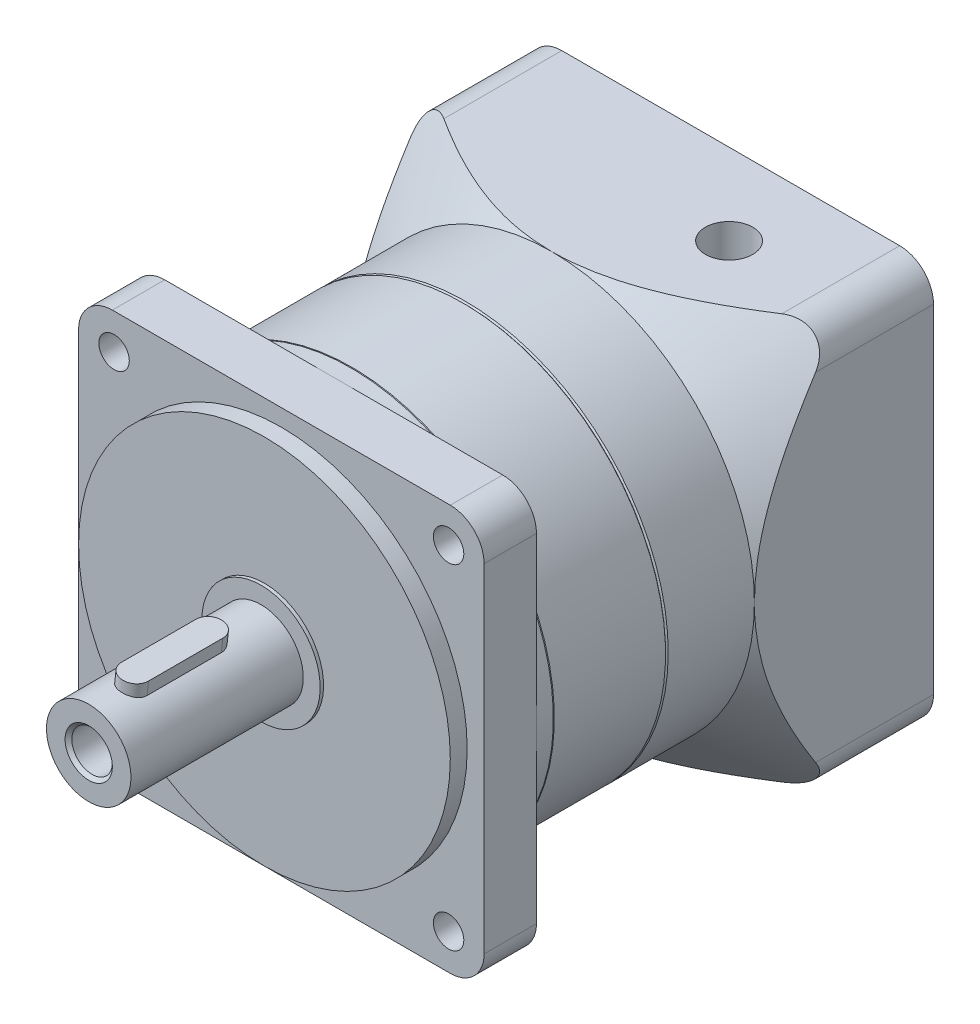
ISO-10303-21;
HEADER;
FILE_DESCRIPTION(('STEP AP214'),'2;1');
FILE_NAME('part.step','',(''),(''),'','','');
FILE_SCHEMA(('AUTOMOTIVE_DESIGN { 1 0 10303 214 1 1 1 1 }'));
ENDSEC;
DATA;
#1=APPLICATION_CONTEXT('core data for automotive mechanical design processes');
#2=APPLICATION_PROTOCOL_DEFINITION('international standard','automotive_design',2000,#1);
#3=PRODUCT_CONTEXT('',#1,'mechanical');
#4=PRODUCT('Part','Part','',(#3));
#5=PRODUCT_RELATED_PRODUCT_CATEGORY('part','',(#4));
#6=PRODUCT_DEFINITION_FORMATION('','',#4);
#7=PRODUCT_DEFINITION_CONTEXT('part definition',#1,'design');
#8=PRODUCT_DEFINITION('design','',#6,#7);
#9=PRODUCT_DEFINITION_SHAPE('','',#8);
#10=(LENGTH_UNIT() NAMED_UNIT(*) SI_UNIT(.MILLI.,.METRE.));
#11=(NAMED_UNIT(*) PLANE_ANGLE_UNIT() SI_UNIT($,.RADIAN.));
#12=(NAMED_UNIT(*) SI_UNIT($,.STERADIAN.) SOLID_ANGLE_UNIT());
#13=UNCERTAINTY_MEASURE_WITH_UNIT(LENGTH_MEASURE(1.E-05),#10,'distance_accuracy_value','');
#14=(GEOMETRIC_REPRESENTATION_CONTEXT(3) GLOBAL_UNCERTAINTY_ASSIGNED_CONTEXT((#13)) GLOBAL_UNIT_ASSIGNED_CONTEXT((#10,
#11,#12)) REPRESENTATION_CONTEXT('',''));
#15=CARTESIAN_POINT('',(0.,0.,0.));
#16=DIRECTION('',(0.,0.,1.));
#17=DIRECTION('',(1.,0.,0.));
#18=AXIS2_PLACEMENT_3D('',#15,#16,#17);
#19=CARTESIAN_POINT('',(40.1259505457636,-22.1506662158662,282.570553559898));
#20=DIRECTION('',(0.,0.,-1.));
#21=DIRECTION('',(-1.,0.,0.));
#22=AXIS2_PLACEMENT_3D('',#19,#20,#21);
#23=CONICAL_SURFACE('',#22,60.,0.785398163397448);
#24=CARTESIAN_POINT('',(40.1259505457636,-22.1506662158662,282.870553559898));
#25=DIRECTION('',(0.,0.,-1.));
#26=DIRECTION('',(-1.,0.,0.));
#27=AXIS2_PLACEMENT_3D('',#24,#25,#26);
#28=CIRCLE('',#27,59.7);
#29=CARTESIAN_POINT('',(-19.5740494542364,-22.1506662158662,282.870553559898));
#30=VERTEX_POINT('',#29);
#31=EDGE_CURVE('P0_E45',#30,#30,#28,.T.);
#32=ORIENTED_EDGE('',*,*,#31,.T.);
#33=EDGE_LOOP('',(#32));
#34=FACE_BOUND('',#33,.T.);
#35=CARTESIAN_POINT('',(40.1259505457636,-22.1506662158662,282.570553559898));
#36=DIRECTION('',(0.,0.,-1.));
#37=DIRECTION('',(-1.,0.,0.));
#38=AXIS2_PLACEMENT_3D('',#35,#36,#37);
#39=CIRCLE('',#38,60.);
#40=CARTESIAN_POINT('',(-19.8740494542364,-22.1506662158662,282.570553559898));
#41=VERTEX_POINT('',#40);
#42=EDGE_CURVE('P0_E10',#41,#41,#39,.T.);
#43=ORIENTED_EDGE('',*,*,#42,.F.);
#44=EDGE_LOOP('',(#43));
#45=FACE_BOUND('',#44,.T.);
#46=ADVANCED_FACE('P0_F31',(#34,#45),#23,.T.);
#47=CARTESIAN_POINT('',(40.1259505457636,-22.1506662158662,282.870553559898));
#48=DIRECTION('',(0.,0.,-1.));
#49=DIRECTION('',(-1.,0.,0.));
#50=AXIS2_PLACEMENT_3D('',#47,#48,#49);
#51=CYLINDRICAL_SURFACE('',#50,60.);
#52=ORIENTED_EDGE('',*,*,#42,.T.);
#53=EDGE_LOOP('',(#52));
#54=FACE_BOUND('',#53,.T.);
#55=CARTESIAN_POINT('',(40.1259505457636,-22.1506662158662,249.670553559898));
#56=DIRECTION('',(0.,0.,-1.));
#57=DIRECTION('',(-1.,0.,0.));
#58=AXIS2_PLACEMENT_3D('',#55,#56,#57);
#59=CIRCLE('',#58,60.);
#60=CARTESIAN_POINT('',(-19.8740494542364,-22.1506662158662,249.670553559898));
#61=VERTEX_POINT('',#60);
#62=EDGE_CURVE('P0_E37',#61,#61,#59,.T.);
#63=ORIENTED_EDGE('',*,*,#62,.F.);
#64=EDGE_LOOP('',(#63));
#65=FACE_BOUND('',#64,.T.);
#66=ADVANCED_FACE('P0_F64',(#54,#65),#51,.T.);
#67=CARTESIAN_POINT('',(40.1259505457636,-22.1506662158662,249.370553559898));
#68=DIRECTION('',(0.,0.,1.));
#69=DIRECTION('',(1.,0.,0.));
#70=AXIS2_PLACEMENT_3D('',#67,#68,#69);
#71=CONICAL_SURFACE('',#70,59.7,0.785398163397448);
#72=ORIENTED_EDGE('',*,*,#62,.T.);
#73=EDGE_LOOP('',(#72));
#74=FACE_BOUND('',#73,.T.);
#75=CARTESIAN_POINT('',(40.1259505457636,-22.1506662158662,249.370553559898));
#76=DIRECTION('',(0.,0.,-1.));
#77=DIRECTION('',(-1.,0.,0.));
#78=AXIS2_PLACEMENT_3D('',#75,#76,#77);
#79=CIRCLE('',#78,59.7);
#80=CARTESIAN_POINT('',(-19.5740494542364,-22.1506662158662,249.370553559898));
#81=VERTEX_POINT('',#80);
#82=EDGE_CURVE('P0_E41',#81,#81,#79,.T.);
#83=ORIENTED_EDGE('',*,*,#82,.F.);
#84=EDGE_LOOP('',(#83));
#85=FACE_BOUND('',#84,.T.);
#86=ADVANCED_FACE('P0_F60',(#74,#85),#71,.T.);
#87=CARTESIAN_POINT('',(40.1259505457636,-22.1506662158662,249.370553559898));
#88=DIRECTION('',(0.,0.,-1.));
#89=DIRECTION('',(-1.,0.,0.));
#90=AXIS2_PLACEMENT_3D('',#87,#88,#89);
#91=PLANE('',#90);
#92=ORIENTED_EDGE('',*,*,#82,.T.);
#93=EDGE_LOOP('',(#92));
#94=FACE_BOUND('',#93,.T.);
#95=ADVANCED_FACE('P0_F55',(#94),#91,.T.);
#96=CARTESIAN_POINT('',(99.8259505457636,-22.1506662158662,282.870553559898));
#97=DIRECTION('',(0.,0.,1.));
#98=DIRECTION('',(1.,0.,0.));
#99=AXIS2_PLACEMENT_3D('',#96,#97,#98);
#100=PLANE('',#99);
#101=ORIENTED_EDGE('',*,*,#31,.F.);
#102=EDGE_LOOP('',(#101));
#103=FACE_BOUND('',#102,.T.);
#104=ADVANCED_FACE('P0_F53',(#103),#100,.T.);
#105=CLOSED_SHELL('',(#46,#66,#86,#95,#104));
#106=MANIFOLD_SOLID_BREP('P0_B2',#105);
#107=CARTESIAN_POINT('',(40.1259505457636,-22.1506662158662,230.870553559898));
#108=DIRECTION('',(0.,0.,-1.));
#109=DIRECTION('',(-1.,0.,0.));
#110=AXIS2_PLACEMENT_3D('',#107,#108,#109);
#111=PLANE('',#110);
#112=CARTESIAN_POINT('',(40.1259505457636,-22.1506662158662,230.870553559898));
#113=DIRECTION('',(0.,0.,-1.));
#114=DIRECTION('',(-1.,0.,0.));
#115=AXIS2_PLACEMENT_3D('',#112,#113,#114);
#116=CIRCLE('',#115,12.);
#117=CARTESIAN_POINT('',(28.1259505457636,-22.1506662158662,230.870553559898));
#118=VERTEX_POINT('',#117);
#119=EDGE_CURVE('P1_E421',#118,#118,#116,.T.);
#120=ORIENTED_EDGE('',*,*,#119,.T.);
#121=EDGE_LOOP('',(#120));
#122=FACE_BOUND('',#121,.T.);
#123=ADVANCED_FACE('P1_F16',(#122),#111,.T.);
#124=CARTESIAN_POINT('',(40.1259505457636,-22.1506662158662,230.870553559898));
#125=DIRECTION('',(0.,0.,-1.));
#126=DIRECTION('',(-1.,0.,0.));
#127=AXIS2_PLACEMENT_3D('',#124,#125,#126);
#128=CYLINDRICAL_SURFACE('',#127,12.);
#129=CARTESIAN_POINT('',(40.1259505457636,-22.1506662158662,181.370553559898));
#130=DIRECTION('',(0.,0.,-1.));
#131=DIRECTION('',(-1.,0.,0.));
#132=AXIS2_PLACEMENT_3D('',#129,#130,#131);
#133=CIRCLE('',#132,12.);
#134=CARTESIAN_POINT('',(28.1259505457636,-22.1506662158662,181.370553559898));
#135=VERTEX_POINT('',#134);
#136=EDGE_CURVE('P1_E424',#135,#135,#133,.F.);
#137=ORIENTED_EDGE('',*,*,#136,.F.);
#138=EDGE_LOOP('',(#137));
#139=FACE_BOUND('',#138,.T.);
#140=ORIENTED_EDGE('',*,*,#119,.F.);
#141=EDGE_LOOP('',(#140));
#142=FACE_BOUND('',#141,.T.);
#143=ADVANCED_FACE('P1_F628',(#139,#142),#128,.F.);
#144=CARTESIAN_POINT('',(40.1259505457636,-22.1506662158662,181.370553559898));
#145=DIRECTION('',(0.,0.,-1.));
#146=DIRECTION('',(-1.,0.,0.));
#147=AXIS2_PLACEMENT_3D('',#144,#145,#146);
#148=PLANE('',#147);
#149=CARTESIAN_POINT('',(40.1259505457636,-22.1506662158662,181.370553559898));
#150=DIRECTION('',(0.,0.,1.));
#151=DIRECTION('',(1.,0.,0.));
#152=AXIS2_PLACEMENT_3D('',#149,#150,#151);
#153=CIRCLE('',#152,20.);
#154=CARTESIAN_POINT('',(60.1259505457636,-22.1506662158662,181.370553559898));
#155=VERTEX_POINT('',#154);
#156=EDGE_CURVE('P1_E427',#155,#155,#153,.T.);
#157=ORIENTED_EDGE('',*,*,#156,.F.);
#158=EDGE_LOOP('',(#157));
#159=FACE_BOUND('',#158,.T.);
#160=ORIENTED_EDGE('',*,*,#136,.T.);
#161=EDGE_LOOP('',(#160));
#162=FACE_BOUND('',#161,.T.);
#163=ADVANCED_FACE('P1_F619',(#159,#162),#148,.T.);
#164=CARTESIAN_POINT('',(40.1259505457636,-22.1506662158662,181.370553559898));
#165=DIRECTION('',(0.,0.,1.));
#166=DIRECTION('',(1.,0.,0.));
#167=AXIS2_PLACEMENT_3D('',#164,#165,#166);
#168=CYLINDRICAL_SURFACE('',#167,20.);
#169=CARTESIAN_POINT('',(40.1259505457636,-22.1506662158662,234.370553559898));
#170=DIRECTION('',(0.,0.,1.));
#171=DIRECTION('',(1.,0.,0.));
#172=AXIS2_PLACEMENT_3D('',#169,#170,#171);
#173=CIRCLE('',#172,20.);
#174=CARTESIAN_POINT('',(60.1259505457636,-22.1506662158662,234.370553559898));
#175=VERTEX_POINT('',#174);
#176=EDGE_CURVE('P1_E430',#175,#175,#173,.T.);
#177=ORIENTED_EDGE('',*,*,#176,.F.);
#178=EDGE_LOOP('',(#177));
#179=FACE_BOUND('',#178,.T.);
#180=ORIENTED_EDGE('',*,*,#156,.T.);
#181=EDGE_LOOP('',(#180));
#182=FACE_BOUND('',#181,.T.);
#183=ADVANCED_FACE('P1_F610',(#179,#182),#168,.T.);
#184=CARTESIAN_POINT('',(40.1259505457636,-22.1506662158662,234.370553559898));
#185=DIRECTION('',(0.,0.,-1.));
#186=DIRECTION('',(-1.,0.,0.));
#187=AXIS2_PLACEMENT_3D('',#184,#185,#186);
#188=PLANE('',#187);
#189=ORIENTED_EDGE('',*,*,#176,.T.);
#190=EDGE_LOOP('',(#189));
#191=FACE_BOUND('',#190,.T.);
#192=CARTESIAN_POINT('',(40.1259505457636,-22.1506662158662,234.370553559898));
#193=DIRECTION('',(0.,0.,-1.));
#194=DIRECTION('',(-1.,0.,0.));
#195=AXIS2_PLACEMENT_3D('',#192,#193,#194);
#196=CIRCLE('',#195,40.);
#197=CARTESIAN_POINT('',(0.125950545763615,-22.1506662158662,234.370553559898));
#198=VERTEX_POINT('',#197);
#199=EDGE_CURVE('P1_E436',#198,#198,#196,.T.);
#200=ORIENTED_EDGE('',*,*,#199,.T.);
#201=EDGE_LOOP('',(#200));
#202=FACE_BOUND('',#201,.T.);
#203=ADVANCED_FACE('P1_F601',(#191,#202),#188,.T.);
#204=CARTESIAN_POINT('',(86.0878913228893,23.8112745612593,190.370553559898));
#205=DIRECTION('',(0.,0.,-1.));
#206=DIRECTION('',(-1.,0.,0.));
#207=AXIS2_PLACEMENT_3D('',#204,#205,#206);
#208=PLANE('',#207);
#209=CARTESIAN_POINT('',(86.0878913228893,23.8112745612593,190.370553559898));
#210=DIRECTION('',(0.,0.,-1.));
#211=DIRECTION('',(-1.,0.,0.));
#212=AXIS2_PLACEMENT_3D('',#209,#210,#211);
#213=CIRCLE('',#212,4.);
#214=CARTESIAN_POINT('',(82.0878913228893,23.8112745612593,190.370553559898));
#215=VERTEX_POINT('',#214);
#216=EDGE_CURVE('P1_E439',#215,#215,#213,.T.);
#217=ORIENTED_EDGE('',*,*,#216,.T.);
#218=EDGE_LOOP('',(#217));
#219=FACE_BOUND('',#218,.T.);
#220=ADVANCED_FACE('P1_F592',(#219),#208,.T.);
#221=CARTESIAN_POINT('',(86.0878913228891,-68.1126069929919,190.370553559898));
#222=DIRECTION('',(0.,0.,-1.));
#223=DIRECTION('',(-1.,0.,0.));
#224=AXIS2_PLACEMENT_3D('',#221,#222,#223);
#225=PLANE('',#224);
#226=CARTESIAN_POINT('',(86.0878913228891,-68.1126069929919,190.370553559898));
#227=DIRECTION('',(0.,0.,-1.));
#228=DIRECTION('',(-1.,0.,0.));
#229=AXIS2_PLACEMENT_3D('',#226,#227,#228);
#230=CIRCLE('',#229,4.);
#231=CARTESIAN_POINT('',(82.0878913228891,-68.1126069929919,190.370553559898));
#232=VERTEX_POINT('',#231);
#233=EDGE_CURVE('P1_E442',#232,#232,#230,.T.);
#234=ORIENTED_EDGE('',*,*,#233,.T.);
#235=EDGE_LOOP('',(#234));
#236=FACE_BOUND('',#235,.T.);
#237=ADVANCED_FACE('P1_F583',(#236),#225,.T.);
#238=CARTESIAN_POINT('',(-5.83599023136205,-68.1126069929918,190.370553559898));
#239=DIRECTION('',(0.,0.,-1.));
#240=DIRECTION('',(-1.,0.,0.));
#241=AXIS2_PLACEMENT_3D('',#238,#239,#240);
#242=PLANE('',#241);
#243=CARTESIAN_POINT('',(-5.83599023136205,-68.1126069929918,190.370553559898));
#244=DIRECTION('',(0.,0.,-1.));
#245=DIRECTION('',(-1.,0.,0.));
#246=AXIS2_PLACEMENT_3D('',#243,#244,#245);
#247=CIRCLE('',#246,4.);
#248=CARTESIAN_POINT('',(-9.83599023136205,-68.1126069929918,190.370553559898));
#249=VERTEX_POINT('',#248);
#250=EDGE_CURVE('P1_E445',#249,#249,#247,.T.);
#251=ORIENTED_EDGE('',*,*,#250,.T.);
#252=EDGE_LOOP('',(#251));
#253=FACE_BOUND('',#252,.T.);
#254=ADVANCED_FACE('P1_F575',(#253),#242,.T.);
#255=CARTESIAN_POINT('',(-5.8359902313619,23.8112745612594,190.370553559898));
#256=DIRECTION('',(0.,0.,-1.));
#257=DIRECTION('',(-1.,0.,0.));
#258=AXIS2_PLACEMENT_3D('',#255,#256,#257);
#259=PLANE('',#258);
#260=CARTESIAN_POINT('',(-5.8359902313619,23.8112745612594,190.370553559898));
#261=DIRECTION('',(0.,0.,-1.));
#262=DIRECTION('',(-1.,0.,0.));
#263=AXIS2_PLACEMENT_3D('',#260,#261,#262);
#264=CIRCLE('',#263,3.99999999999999);
#265=CARTESIAN_POINT('',(-9.83599023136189,23.8112745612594,190.370553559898));
#266=VERTEX_POINT('',#265);
#267=EDGE_CURVE('P1_E447',#266,#266,#264,.T.);
#268=ORIENTED_EDGE('',*,*,#267,.T.);
#269=EDGE_LOOP('',(#268));
#270=FACE_BOUND('',#269,.T.);
#271=ADVANCED_FACE('P1_F568',(#270),#259,.T.);
#272=CARTESIAN_POINT('',(40.1259505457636,-22.1506662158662,177.370553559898));
#273=DIRECTION('',(0.,0.,-1.));
#274=DIRECTION('',(-1.,0.,0.));
#275=AXIS2_PLACEMENT_3D('',#272,#273,#274);
#276=PLANE('',#275);
#277=CARTESIAN_POINT('',(40.1259505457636,-22.1506662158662,177.370553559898));
#278=DIRECTION('',(0.,0.,-1.));
#279=DIRECTION('',(-1.,0.,0.));
#280=AXIS2_PLACEMENT_3D('',#277,#278,#279);
#281=CIRCLE('',#280,55.);
#282=CARTESIAN_POINT('',(-14.8740494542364,-22.1506662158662,177.370553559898));
#283=VERTEX_POINT('',#282);
#284=EDGE_CURVE('P1_E258',#283,#283,#281,.T.);
#285=ORIENTED_EDGE('',*,*,#284,.T.);
#286=EDGE_LOOP('',(#285));
#287=FACE_BOUND('',#286,.T.);
#288=CARTESIAN_POINT('',(40.1259505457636,-22.1506662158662,177.370553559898));
#289=DIRECTION('',(0.,0.,-1.));
#290=DIRECTION('',(-1.,0.,0.));
#291=AXIS2_PLACEMENT_3D('',#288,#289,#290);
#292=CIRCLE('',#291,40.);
#293=CARTESIAN_POINT('',(0.125950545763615,-22.1506662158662,177.370553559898));
#294=VERTEX_POINT('',#293);
#295=EDGE_CURVE('P1_E433',#294,#294,#292,.F.);
#296=ORIENTED_EDGE('',*,*,#295,.T.);
#297=EDGE_LOOP('',(#296));
#298=FACE_BOUND('',#297,.T.);
#299=ADVANCED_FACE('P1_F291',(#287,#298),#276,.T.);
#300=CARTESIAN_POINT('',(40.1259505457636,-22.1506662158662,234.370553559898));
#301=DIRECTION('',(0.,0.,-1.));
#302=DIRECTION('',(-1.,0.,0.));
#303=AXIS2_PLACEMENT_3D('',#300,#301,#302);
#304=CYLINDRICAL_SURFACE('',#303,40.);
#305=ORIENTED_EDGE('',*,*,#199,.F.);
#306=EDGE_LOOP('',(#305));
#307=FACE_BOUND('',#306,.T.);
#308=CARTESIAN_POINT('',(63.6259505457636,10.2183004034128,201.370553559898));
#309=CARTESIAN_POINT('',(63.8657775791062,10.0441848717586,201.370555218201));
#310=CARTESIAN_POINT('',(64.1036770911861,9.86738908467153,201.358231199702));
#311=CARTESIAN_POINT('',(64.5740723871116,9.50966734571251,201.310077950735));
#312=CARTESIAN_POINT('',(64.8065652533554,9.32873926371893,201.274236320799));
#313=CARTESIAN_POINT('',(65.265383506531,8.96356097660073,201.179905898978));
#314=CARTESIAN_POINT('',(65.4916883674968,8.77930245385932,201.121349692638));
#315=CARTESIAN_POINT('',(65.9362103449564,8.40934208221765,200.982430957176));
#316=CARTESIAN_POINT('',(66.1544285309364,8.22364042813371,200.902071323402));
#317=CARTESIAN_POINT('',(66.5911924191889,7.84397221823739,200.716114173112));
#318=CARTESIAN_POINT('',(66.8093285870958,7.65000215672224,200.609560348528));
#319=CARTESIAN_POINT('',(67.2345606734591,7.2637142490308,200.373642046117));
#320=CARTESIAN_POINT('',(67.4416542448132,7.07139676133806,200.244272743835));
#321=CARTESIAN_POINT('',(67.8431838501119,6.69082086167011,199.962955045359));
#322=CARTESIAN_POINT('',(68.0376384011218,6.50255679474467,199.811040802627));
#323=CARTESIAN_POINT('',(68.4126629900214,6.13238922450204,199.484185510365));
#324=CARTESIAN_POINT('',(68.5932396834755,5.95048269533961,199.30925560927));
#325=CARTESIAN_POINT('',(68.8793316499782,5.65705770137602,198.999795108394));
#326=CARTESIAN_POINT('',(68.9893426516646,5.54280357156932,198.871997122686));
#327=CARTESIAN_POINT('',(69.2018394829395,5.31961760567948,198.60593609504));
#328=CARTESIAN_POINT('',(69.3043242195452,5.21068654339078,198.467671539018));
#329=CARTESIAN_POINT('',(69.5989433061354,4.89420592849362,198.037182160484));
#330=CARTESIAN_POINT('',(69.7787717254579,4.69642181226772,197.728699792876));
#331=CARTESIAN_POINT('',(70.0568559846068,4.38560132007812,197.149014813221));
#332=CARTESIAN_POINT('',(70.1643087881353,4.26366268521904,196.887090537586));
#333=CARTESIAN_POINT('',(70.3029165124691,4.10491720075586,196.477429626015));
#334=CARTESIAN_POINT('',(70.345350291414,4.0560372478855,196.338112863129));
#335=CARTESIAN_POINT('',(70.4220002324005,3.96738908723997,196.054381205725));
#336=CARTESIAN_POINT('',(70.4562176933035,3.92761943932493,195.909967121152));
#337=CARTESIAN_POINT('',(70.5113020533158,3.86340550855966,195.638682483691));
#338=CARTESIAN_POINT('',(70.5333968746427,3.83756248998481,195.512390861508));
#339=CARTESIAN_POINT('',(70.5707332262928,3.79381369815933,195.257447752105));
#340=CARTESIAN_POINT('',(70.585975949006,3.77590654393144,195.128796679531));
#341=CARTESIAN_POINT('',(70.6093168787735,3.74845931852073,194.870017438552));
#342=CARTESIAN_POINT('',(70.6174184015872,3.73891536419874,194.739889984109));
#343=CARTESIAN_POINT('',(70.6263264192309,3.72842032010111,194.479034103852));
#344=CARTESIAN_POINT('',(70.6271327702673,3.72746939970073,194.348305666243));
#345=CARTESIAN_POINT('',(70.6214325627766,3.73418640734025,194.087203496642));
#346=CARTESIAN_POINT('',(70.6149244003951,3.74185622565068,193.956829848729));
#347=CARTESIAN_POINT('',(70.5947254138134,3.76562208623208,193.697423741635));
#348=CARTESIAN_POINT('',(70.581034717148,3.78171797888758,193.56839125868));
#349=CARTESIAN_POINT('',(70.5467240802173,3.82195848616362,193.312454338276));
#350=CARTESIAN_POINT('',(70.5261002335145,3.84610763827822,193.185551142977));
#351=CARTESIAN_POINT('',(70.4782877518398,3.90191474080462,192.934658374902));
#352=CARTESIAN_POINT('',(70.4510976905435,3.9335743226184,192.810669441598));
#353=CARTESIAN_POINT('',(70.3824455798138,4.01320117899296,192.5333606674));
#354=CARTESIAN_POINT('',(70.3391116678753,4.06326471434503,192.381101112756));
#355=CARTESIAN_POINT('',(70.2434960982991,4.17306393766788,192.083060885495));
#356=CARTESIAN_POINT('',(70.1912122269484,4.23280201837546,191.93728182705));
#357=CARTESIAN_POINT('',(70.0221239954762,4.42465504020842,191.509994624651));
#358=CARTESIAN_POINT('',(69.8931467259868,4.56933383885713,191.238784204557));
#359=CARTESIAN_POINT('',(69.6503854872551,4.83693166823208,190.799871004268));
#360=CARTESIAN_POINT('',(69.5429558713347,4.9540837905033,190.624882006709));
#361=CARTESIAN_POINT('',(69.3166202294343,5.19768681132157,190.289228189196));
#362=CARTESIAN_POINT('',(69.1977095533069,5.32414147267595,190.128569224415));
#363=CARTESIAN_POINT('',(68.949636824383,5.58428442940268,189.821106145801));
#364=CARTESIAN_POINT('',(68.8204572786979,5.71798493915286,189.674326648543));
#365=CARTESIAN_POINT('',(68.5531065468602,5.99064287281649,189.394555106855));
#366=CARTESIAN_POINT('',(68.4149355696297,6.12960017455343,189.261562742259));
#367=CARTESIAN_POINT('',(68.0847726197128,6.45657294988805,188.968512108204));
#368=CARTESIAN_POINT('',(67.8897383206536,6.64602132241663,188.81346422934));
#369=CARTESIAN_POINT('',(67.4869940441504,7.02896017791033,188.526453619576));
#370=CARTESIAN_POINT('',(67.2792797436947,7.22245202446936,188.394498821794));
#371=CARTESIAN_POINT('',(66.8527231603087,7.6111005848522,188.153815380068));
#372=CARTESIAN_POINT('',(66.6338923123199,7.80625542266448,188.045063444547));
#373=CARTESIAN_POINT('',(66.1862058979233,8.19651359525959,187.850998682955));
#374=CARTESIAN_POINT('',(65.9573533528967,8.39161692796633,187.765678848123));
#375=CARTESIAN_POINT('',(65.3899663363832,8.86413946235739,187.587422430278));
#376=CARTESIAN_POINT('',(65.0467095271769,9.1407562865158,187.507081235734));
#377=CARTESIAN_POINT('',(64.3457373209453,9.68640534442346,187.398634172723));
#378=CARTESIAN_POINT('',(63.9880148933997,9.95543377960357,187.370554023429));
#379=CARTESIAN_POINT('',(63.3842189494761,10.3938028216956,187.370553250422));
#380=CARTESIAN_POINT('',(63.1405519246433,10.5665585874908,187.383069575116));
#381=CARTESIAN_POINT('',(62.6511661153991,10.9053943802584,187.434393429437));
#382=CARTESIAN_POINT('',(62.4054468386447,11.0714727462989,187.473207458));
#383=CARTESIAN_POINT('',(61.9147090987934,11.3953677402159,187.57830980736));
#384=CARTESIAN_POINT('',(61.6696902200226,11.5531912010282,187.644574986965));
#385=CARTESIAN_POINT('',(61.1831324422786,11.8592968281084,187.805628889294));
#386=CARTESIAN_POINT('',(60.9415920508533,12.0075831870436,187.900404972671));
#387=CARTESIAN_POINT('',(60.5317858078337,12.2534337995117,188.088683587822));
#388=CARTESIAN_POINT('',(60.3618509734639,12.3536208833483,188.175186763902));
#389=CARTESIAN_POINT('',(60.0270272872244,12.547814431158,188.363505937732));
#390=CARTESIAN_POINT('',(59.8621373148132,12.6418222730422,188.465318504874));
#391=CARTESIAN_POINT('',(59.5390218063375,12.8231379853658,188.684160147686));
#392=CARTESIAN_POINT('',(59.3807931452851,12.9104490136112,188.801181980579));
#393=CARTESIAN_POINT('',(59.0725595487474,13.077969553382,189.050226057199));
#394=CARTESIAN_POINT('',(58.9225549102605,13.1581788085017,189.182248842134));
#395=CARTESIAN_POINT('',(58.6316656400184,13.3115065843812,189.46158174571));
#396=CARTESIAN_POINT('',(58.4908370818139,13.3845826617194,189.608973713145));
#397=CARTESIAN_POINT('',(58.220971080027,13.5227583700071,189.9176642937));
#398=CARTESIAN_POINT('',(58.0919338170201,13.5878578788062,190.07896311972));
#399=CARTESIAN_POINT('',(57.8473783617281,13.7097530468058,190.414396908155));
#400=CARTESIAN_POINT('',(57.7318575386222,13.7665503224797,190.58852936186));
#401=CARTESIAN_POINT('',(57.5159156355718,13.871598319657,190.948348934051));
#402=CARTESIAN_POINT('',(57.4154929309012,13.9198499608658,191.134034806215));
#403=CARTESIAN_POINT('',(57.2403746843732,14.0032400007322,191.496394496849));
#404=CARTESIAN_POINT('',(57.1641127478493,14.0392059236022,191.672123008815));
#405=CARTESIAN_POINT('',(57.0259087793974,14.1039506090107,192.030402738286));
#406=CARTESIAN_POINT('',(56.963965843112,14.1327298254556,192.212953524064));
#407=CARTESIAN_POINT('',(56.8551780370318,14.1830170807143,192.583405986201));
#408=CARTESIAN_POINT('',(56.8083278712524,14.2045276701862,192.771305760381));
#409=CARTESIAN_POINT('',(56.7302796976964,14.2402406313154,193.151010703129));
#410=CARTESIAN_POINT('',(56.6990811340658,14.2544432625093,193.342815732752));
#411=CARTESIAN_POINT('',(56.6541773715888,14.2748506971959,193.716660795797));
#412=CARTESIAN_POINT('',(56.6394993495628,14.2815005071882,193.898560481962));
#413=CARTESIAN_POINT('',(56.6243995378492,14.288341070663,194.263068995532));
#414=CARTESIAN_POINT('',(56.6239772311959,14.2885320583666,194.445677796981));
#415=CARTESIAN_POINT('',(56.637392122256,14.2824553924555,194.810231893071));
#416=CARTESIAN_POINT('',(56.6512270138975,14.2761887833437,194.99217729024));
#417=CARTESIAN_POINT('',(56.6929991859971,14.2572096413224,195.354102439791));
#418=CARTESIAN_POINT('',(56.7209364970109,14.2444970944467,195.534082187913));
#419=CARTESIAN_POINT('',(56.7900346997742,14.2129105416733,195.887855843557));
#420=CARTESIAN_POINT('',(56.8309721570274,14.1941405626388,196.061702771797));
#421=CARTESIAN_POINT('',(56.9257747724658,14.1504168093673,196.405100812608));
#422=CARTESIAN_POINT('',(56.9796442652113,14.1254609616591,196.574650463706));
#423=CARTESIAN_POINT('',(57.0997272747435,14.0694288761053,196.908235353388));
#424=CARTESIAN_POINT('',(57.1659383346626,14.0383538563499,197.072271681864));
#425=CARTESIAN_POINT('',(57.3100330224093,13.970154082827,197.393834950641));
#426=CARTESIAN_POINT('',(57.3879172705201,13.933029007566,197.551361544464));
#427=CARTESIAN_POINT('',(57.5562831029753,13.8520060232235,197.862115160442));
#428=CARTESIAN_POINT('',(57.6469902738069,13.8079848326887,198.015187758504));
#429=CARTESIAN_POINT('',(57.8388220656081,13.7138788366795,198.312694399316));
#430=CARTESIAN_POINT('',(57.9399469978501,13.663793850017,198.457128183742));
#431=CARTESIAN_POINT('',(58.1516086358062,13.5577313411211,198.736593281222));
#432=CARTESIAN_POINT('',(58.2621442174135,13.5017545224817,198.87162571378));
#433=CARTESIAN_POINT('',(58.4916395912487,13.3840787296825,199.131745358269));
#434=CARTESIAN_POINT('',(58.6106023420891,13.322377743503,199.256829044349));
#435=CARTESIAN_POINT('',(58.8631921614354,13.1896410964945,199.503696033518));
#436=CARTESIAN_POINT('',(58.9972707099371,13.118268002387,199.624835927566));
#437=CARTESIAN_POINT('',(59.272455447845,12.9696386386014,199.855011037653));
#438=CARTESIAN_POINT('',(59.4135642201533,12.8923802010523,199.964041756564));
#439=CARTESIAN_POINT('',(59.7015603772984,12.7323187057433,200.169732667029));
#440=CARTESIAN_POINT('',(59.8484485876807,12.6495148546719,200.266391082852));
#441=CARTESIAN_POINT('',(60.1468556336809,12.478699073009,200.447259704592));
#442=CARTESIAN_POINT('',(60.2983761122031,12.3906852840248,200.53146543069));
#443=CARTESIAN_POINT('',(60.6213819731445,12.2001136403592,200.695806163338));
#444=CARTESIAN_POINT('',(60.7932635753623,12.0970090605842,200.774532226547));
#445=CARTESIAN_POINT('',(61.1399428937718,11.8853958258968,200.91692189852));
#446=CARTESIAN_POINT('',(61.3147418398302,11.7768848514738,200.980578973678));
#447=CARTESIAN_POINT('',(61.8413077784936,11.4441950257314,201.149242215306));
#448=CARTESIAN_POINT('',(62.1957447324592,11.2125652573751,201.232190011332));
#449=CARTESIAN_POINT('',(62.7295669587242,10.8512208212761,201.315338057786));
#450=CARTESIAN_POINT('',(62.9098863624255,10.7269938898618,201.336166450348));
#451=CARTESIAN_POINT('',(63.2691404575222,10.4751020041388,201.363770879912));
#452=CARTESIAN_POINT('',(63.4480756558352,10.347438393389,201.370552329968));
#453=CARTESIAN_POINT('',(63.6259505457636,10.2183004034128,201.370553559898));
#454=B_SPLINE_CURVE_WITH_KNOTS('',3,(#308,#309,#310,#311,#312,#313,#314,#315,#316,#317,#318,
#319,#320,#321,#322,#323,#324,#325,#326,#327,#328,#329,#330,#331,#332,#333,#334,#335,#336,#337,
#338,#339,#340,#341,#342,#343,#344,#345,#346,#347,#348,#349,#350,#351,#352,#353,#354,#355,#356,
#357,#358,#359,#360,#361,#362,#363,#364,#365,#366,#367,#368,#369,#370,#371,#372,#373,#374,#375,
#376,#377,#378,#379,#380,#381,#382,#383,#384,#385,#386,#387,#388,#389,#390,#391,#392,#393,#394,
#395,#396,#397,#398,#399,#400,#401,#402,#403,#404,#405,#406,#407,#408,#409,#410,#411,#412,#413,
#414,#415,#416,#417,#418,#419,#420,#421,#422,#423,#424,#425,#426,#427,#428,#429,#430,#431,#432,
#433,#434,#435,#436,#437,#438,#439,#440,#441,#442,#443,#444,#445,#446,#447,#448,#449,#450,#451,
#452,#453),.UNSPECIFIED.,.T.,.F.,(4,2,2,2,2,2,2,2,2,2,2,2,2,2,2,2,2,2,2,2,2,2,2,2,2,2,2,2,2,2,2,
2,2,2,2,2,2,2,2,2,2,2,2,2,2,2,2,2,2,2,2,2,2,2,2,2,2,2,2,2,2,2,2,2,2,2,2,2,2,2,2,2,4),(0.,
0.888878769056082,1.77822656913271,2.67023430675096,3.56212364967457,4.49332574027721,
5.42472497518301,6.35472736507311,7.28428092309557,7.89488966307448,8.5055869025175,
9.7241674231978,10.6453197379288,11.1056925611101,11.5659925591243,11.9579472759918,
12.3498337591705,12.7415381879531,13.1332503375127,13.5250483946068,13.9168394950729,
14.3088517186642,14.7009491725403,15.1982931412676,15.6957603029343,16.6914843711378,
17.3998991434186,18.1086020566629,18.8185392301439,19.5284599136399,20.4662027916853,
21.4042671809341,22.3413854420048,23.2782230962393,24.6192511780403,25.9609390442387,
26.8567144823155,27.7527113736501,28.6479544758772,29.5428012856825,30.1883812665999,
30.8338167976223,31.478946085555,32.124098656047,32.7728818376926,33.4216749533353,
34.0703415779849,34.7189383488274,35.3029146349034,35.8868540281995,36.4705882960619,
37.0543018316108,37.6014749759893,38.1486282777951,38.6956930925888,39.2427590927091,
39.7808898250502,40.3192011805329,40.8574054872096,41.3956384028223,41.9449092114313,
42.4941964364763,43.0434181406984,43.592833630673,44.1750662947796,44.757514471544,
45.3400461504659,45.9227868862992,46.568125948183,47.2137443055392,48.5031023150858,
49.1626200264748,49.8218835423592),.UNSPECIFIED.);
#455=CARTESIAN_POINT('',(63.6259505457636,10.2183004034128,201.370553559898));
#456=VERTEX_POINT('',#455);
#457=EDGE_CURVE('P1_E252',#456,#456,#454,.T.);
#458=ORIENTED_EDGE('',*,*,#457,.T.);
#459=EDGE_LOOP('',(#458));
#460=FACE_BOUND('',#459,.T.);
#461=ORIENTED_EDGE('',*,*,#295,.F.);
#462=EDGE_LOOP('',(#461));
#463=FACE_BOUND('',#462,.T.);
#464=ADVANCED_FACE('P1_F260',(#307,#460,#463),#304,.F.);
#465=CARTESIAN_POINT('',(86.0878913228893,23.8112745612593,190.370553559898));
#466=DIRECTION('',(0.,0.,-1.));
#467=DIRECTION('',(-1.,0.,0.));
#468=AXIS2_PLACEMENT_3D('',#465,#466,#467);
#469=CYLINDRICAL_SURFACE('',#468,4.);
#470=ORIENTED_EDGE('',*,*,#216,.F.);
#471=EDGE_LOOP('',(#470));
#472=FACE_BOUND('',#471,.T.);
#473=CARTESIAN_POINT('',(86.0878913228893,23.8112745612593,170.370553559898));
#474=DIRECTION('',(0.,0.,-1.));
#475=DIRECTION('',(-1.,0.,0.));
#476=AXIS2_PLACEMENT_3D('',#473,#474,#475);
#477=CIRCLE('',#476,4.);
#478=CARTESIAN_POINT('',(82.0878913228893,23.8112745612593,170.370553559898));
#479=VERTEX_POINT('',#478);
#480=EDGE_CURVE('P1_E249',#479,#479,#477,.T.);
#481=ORIENTED_EDGE('',*,*,#480,.T.);
#482=EDGE_LOOP('',(#481));
#483=FACE_BOUND('',#482,.T.);
#484=ADVANCED_FACE('P1_F283',(#472,#483),#469,.F.);
#485=CARTESIAN_POINT('',(86.0878913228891,-68.1126069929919,190.370553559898));
#486=DIRECTION('',(0.,0.,-1.));
#487=DIRECTION('',(-1.,0.,0.));
#488=AXIS2_PLACEMENT_3D('',#485,#486,#487);
#489=CYLINDRICAL_SURFACE('',#488,4.);
#490=ORIENTED_EDGE('',*,*,#233,.F.);
#491=EDGE_LOOP('',(#490));
#492=FACE_BOUND('',#491,.T.);
#493=CARTESIAN_POINT('',(86.0878913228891,-68.1126069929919,170.370553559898));
#494=DIRECTION('',(0.,0.,-1.));
#495=DIRECTION('',(-1.,0.,0.));
#496=AXIS2_PLACEMENT_3D('',#493,#494,#495);
#497=CIRCLE('',#496,4.);
#498=CARTESIAN_POINT('',(82.0878913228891,-68.1126069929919,170.370553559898));
#499=VERTEX_POINT('',#498);
#500=EDGE_CURVE('P1_E246',#499,#499,#497,.T.);
#501=ORIENTED_EDGE('',*,*,#500,.T.);
#502=EDGE_LOOP('',(#501));
#503=FACE_BOUND('',#502,.T.);
#504=ADVANCED_FACE('P1_F280',(#492,#503),#489,.F.);
#505=CARTESIAN_POINT('',(-5.83599023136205,-68.1126069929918,190.370553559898));
#506=DIRECTION('',(0.,0.,-1.));
#507=DIRECTION('',(-1.,0.,0.));
#508=AXIS2_PLACEMENT_3D('',#505,#506,#507);
#509=CYLINDRICAL_SURFACE('',#508,4.);
#510=ORIENTED_EDGE('',*,*,#250,.F.);
#511=EDGE_LOOP('',(#510));
#512=FACE_BOUND('',#511,.T.);
#513=CARTESIAN_POINT('',(-5.83599023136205,-68.1126069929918,170.370553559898));
#514=DIRECTION('',(0.,0.,-1.));
#515=DIRECTION('',(-1.,0.,0.));
#516=AXIS2_PLACEMENT_3D('',#513,#514,#515);
#517=CIRCLE('',#516,4.);
#518=CARTESIAN_POINT('',(-9.83599023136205,-68.1126069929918,170.370553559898));
#519=VERTEX_POINT('',#518);
#520=EDGE_CURVE('P1_E243',#519,#519,#517,.T.);
#521=ORIENTED_EDGE('',*,*,#520,.T.);
#522=EDGE_LOOP('',(#521));
#523=FACE_BOUND('',#522,.T.);
#524=ADVANCED_FACE('P1_F276',(#512,#523),#509,.F.);
#525=CARTESIAN_POINT('',(-5.8359902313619,23.8112745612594,190.370553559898));
#526=DIRECTION('',(0.,0.,-1.));
#527=DIRECTION('',(-1.,0.,0.));
#528=AXIS2_PLACEMENT_3D('',#525,#526,#527);
#529=CYLINDRICAL_SURFACE('',#528,3.99999999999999);
#530=ORIENTED_EDGE('',*,*,#267,.F.);
#531=EDGE_LOOP('',(#530));
#532=FACE_BOUND('',#531,.T.);
#533=CARTESIAN_POINT('',(-5.8359902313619,23.8112745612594,170.370553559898));
#534=DIRECTION('',(0.,0.,-1.));
#535=DIRECTION('',(-1.,0.,0.));
#536=AXIS2_PLACEMENT_3D('',#533,#534,#535);
#537=CIRCLE('',#536,3.99999999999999);
#538=CARTESIAN_POINT('',(-9.83599023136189,23.8112745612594,170.370553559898));
#539=VERTEX_POINT('',#538);
#540=EDGE_CURVE('P1_E240',#539,#539,#537,.T.);
#541=ORIENTED_EDGE('',*,*,#540,.T.);
#542=EDGE_LOOP('',(#541));
#543=FACE_BOUND('',#542,.T.);
#544=ADVANCED_FACE('P1_F272',(#532,#543),#529,.F.);
#545=CARTESIAN_POINT('',(40.1259505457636,-22.1506662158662,177.370553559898));
#546=DIRECTION('',(0.,0.,-1.));
#547=DIRECTION('',(-1.,0.,0.));
#548=AXIS2_PLACEMENT_3D('',#545,#546,#547);
#549=CYLINDRICAL_SURFACE('',#548,55.);
#550=ORIENTED_EDGE('',*,*,#284,.F.);
#551=EDGE_LOOP('',(#550));
#552=FACE_BOUND('',#551,.T.);
#553=CARTESIAN_POINT('',(40.1259505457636,-22.1506662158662,170.370553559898));
#554=DIRECTION('',(0.,0.,-1.));
#555=DIRECTION('',(-1.,0.,0.));
#556=AXIS2_PLACEMENT_3D('',#553,#554,#555);
#557=CIRCLE('',#556,55.);
#558=CARTESIAN_POINT('',(-14.8740494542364,-22.1506662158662,170.370553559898));
#559=VERTEX_POINT('',#558);
#560=EDGE_CURVE('P1_E81',#559,#559,#557,.T.);
#561=ORIENTED_EDGE('',*,*,#560,.T.);
#562=EDGE_LOOP('',(#561));
#563=FACE_BOUND('',#562,.T.);
#564=ADVANCED_FACE('P1_F268',(#552,#563),#549,.F.);
#565=CARTESIAN_POINT('',(63.6259505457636,-82.1516662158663,194.370553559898));
#566=DIRECTION('',(0.,1.,0.));
#567=DIRECTION('',(0.,0.,1.));
#568=AXIS2_PLACEMENT_3D('',#565,#566,#567);
#569=CYLINDRICAL_SURFACE('',#568,7.);
#570=ORIENTED_EDGE('',*,*,#457,.F.);
#571=EDGE_LOOP('',(#570));
#572=FACE_BOUND('',#571,.T.);
#573=CARTESIAN_POINT('',(63.6259505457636,37.8493337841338,194.370553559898));
#574=DIRECTION('',(0.,1.,0.));
#575=DIRECTION('',(0.,0.,1.));
#576=AXIS2_PLACEMENT_3D('',#573,#574,#575);
#577=CIRCLE('',#576,7.);
#578=CARTESIAN_POINT('',(63.6259505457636,37.8493337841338,201.370553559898));
#579=VERTEX_POINT('',#578);
#580=EDGE_CURVE('P1_E230',#579,#579,#577,.T.);
#581=ORIENTED_EDGE('',*,*,#580,.T.);
#582=EDGE_LOOP('',(#581));
#583=FACE_BOUND('',#582,.T.);
#584=ADVANCED_FACE('P1_F264',(#572,#583),#569,.F.);
#585=CARTESIAN_POINT('',(-19.8740494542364,-82.1506662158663,170.370553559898));
#586=DIRECTION('',(0.,0.,1.));
#587=DIRECTION('',(1.,0.,0.));
#588=AXIS2_PLACEMENT_3D('',#585,#586,#587);
#589=PLANE('',#588);
#590=CARTESIAN_POINT('',(90.1259505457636,-72.1506662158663,170.370553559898));
#591=DIRECTION('',(0.,0.,-1.));
#592=DIRECTION('',(-1.,0.,0.));
#593=AXIS2_PLACEMENT_3D('',#590,#591,#592);
#594=CIRCLE('',#593,10.);
#595=CARTESIAN_POINT('',(90.1259505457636,-82.1506662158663,170.370553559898));
#596=VERTEX_POINT('',#595);
#597=CARTESIAN_POINT('',(100.125950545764,-72.1506662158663,170.370553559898));
#598=VERTEX_POINT('',#597);
#599=EDGE_CURVE('P1_E105',#596,#598,#594,.F.);
#600=ORIENTED_EDGE('',*,*,#599,.F.);
#601=DIRECTION('',(1.,0.,0.));
#602=VECTOR('',#601,1.);
#603=CARTESIAN_POINT('',(-19.8740494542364,-82.1506662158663,170.370553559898));
#604=LINE('',#603,#602);
#605=CARTESIAN_POINT('',(-9.87404945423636,-82.1506662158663,170.370553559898));
#606=VERTEX_POINT('',#605);
#607=EDGE_CURVE('P1_E76',#596,#606,#604,.F.);
#608=ORIENTED_EDGE('',*,*,#607,.T.);
#609=CARTESIAN_POINT('',(-9.87404945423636,-72.1506662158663,170.370553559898));
#610=DIRECTION('',(0.,0.,-1.));
#611=DIRECTION('',(-1.,0.,0.));
#612=AXIS2_PLACEMENT_3D('',#609,#610,#611);
#613=CIRCLE('',#612,10.);
#614=CARTESIAN_POINT('',(-19.8740494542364,-72.1506662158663,170.370553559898));
#615=VERTEX_POINT('',#614);
#616=EDGE_CURVE('P1_E67',#615,#606,#613,.F.);
#617=ORIENTED_EDGE('',*,*,#616,.F.);
#618=DIRECTION('',(0.,1.,0.));
#619=VECTOR('',#618,1.);
#620=CARTESIAN_POINT('',(-19.8740494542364,37.8493337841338,170.370553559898));
#621=LINE('',#620,#619);
#622=CARTESIAN_POINT('',(-19.8740494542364,27.8493337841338,170.370553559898));
#623=VERTEX_POINT('',#622);
#624=EDGE_CURVE('P1_E74',#615,#623,#621,.T.);
#625=ORIENTED_EDGE('',*,*,#624,.T.);
#626=CARTESIAN_POINT('',(-9.8740494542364,27.8493337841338,170.370553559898));
#627=DIRECTION('',(0.,0.,-1.));
#628=DIRECTION('',(-1.,0.,0.));
#629=AXIS2_PLACEMENT_3D('',#626,#627,#628);
#630=CIRCLE('',#629,10.);
#631=CARTESIAN_POINT('',(-9.8740494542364,37.8493337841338,170.370553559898));
#632=VERTEX_POINT('',#631);
#633=EDGE_CURVE('P1_E228',#632,#623,#630,.F.);
#634=ORIENTED_EDGE('',*,*,#633,.F.);
#635=DIRECTION('',(1.,0.,0.));
#636=VECTOR('',#635,1.);
#637=CARTESIAN_POINT('',(-19.8740494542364,37.8493337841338,170.370553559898));
#638=LINE('',#637,#636);
#639=CARTESIAN_POINT('',(90.1259505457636,37.8493337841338,170.370553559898));
#640=VERTEX_POINT('',#639);
#641=EDGE_CURVE('P1_E97',#632,#640,#638,.T.);
#642=ORIENTED_EDGE('',*,*,#641,.T.);
#643=CARTESIAN_POINT('',(90.1259505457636,27.8493337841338,170.370553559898));
#644=DIRECTION('',(0.,0.,-1.));
#645=DIRECTION('',(-1.,0.,0.));
#646=AXIS2_PLACEMENT_3D('',#643,#644,#645);
#647=CIRCLE('',#646,10.);
#648=CARTESIAN_POINT('',(100.125950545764,27.8493337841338,170.370553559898));
#649=VERTEX_POINT('',#648);
#650=EDGE_CURVE('P1_E233',#649,#640,#647,.F.);
#651=ORIENTED_EDGE('',*,*,#650,.F.);
#652=DIRECTION('',(0.,-1.,0.));
#653=VECTOR('',#652,1.);
#654=CARTESIAN_POINT('',(100.125950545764,37.8493337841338,170.370553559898));
#655=LINE('',#654,#653);
#656=EDGE_CURVE('P1_E102',#649,#598,#655,.T.);
#657=ORIENTED_EDGE('',*,*,#656,.T.);
#658=EDGE_LOOP('',(#600,#608,#617,#625,#634,#642,#651,#657));
#659=FACE_BOUND('',#658,.T.);
#660=ORIENTED_EDGE('',*,*,#560,.F.);
#661=EDGE_LOOP('',(#660));
#662=FACE_BOUND('',#661,.T.);
#663=ORIENTED_EDGE('',*,*,#540,.F.);
#664=EDGE_LOOP('',(#663));
#665=FACE_BOUND('',#664,.T.);
#666=ORIENTED_EDGE('',*,*,#520,.F.);
#667=EDGE_LOOP('',(#666));
#668=FACE_BOUND('',#667,.T.);
#669=ORIENTED_EDGE('',*,*,#500,.F.);
#670=EDGE_LOOP('',(#669));
#671=FACE_BOUND('',#670,.T.);
#672=ORIENTED_EDGE('',*,*,#480,.F.);
#673=EDGE_LOOP('',(#672));
#674=FACE_BOUND('',#673,.T.);
#675=ADVANCED_FACE('P1_F70',(#659,#662,#665,#668,#671,#674),#589,.F.);
#676=CARTESIAN_POINT('',(-9.87404945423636,-72.1506662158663,223.370553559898));
#677=DIRECTION('',(0.,0.,-1.));
#678=DIRECTION('',(-1.,0.,0.));
#679=AXIS2_PLACEMENT_3D('',#676,#677,#678);
#680=CYLINDRICAL_SURFACE('',#679,10.);
#681=ORIENTED_EDGE('',*,*,#616,.T.);
#682=DIRECTION('',(0.,0.,1.));
#683=VECTOR('',#682,1.);
#684=CARTESIAN_POINT('',(-9.87404945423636,-82.1506662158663,223.370553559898));
#685=LINE('',#684,#683);
#686=CARTESIAN_POINT('',(-9.87404945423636,-82.1506662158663,205.268056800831));
#687=VERTEX_POINT('',#686);
#688=EDGE_CURVE('P1_E80',#606,#687,#685,.T.);
#689=ORIENTED_EDGE('',*,*,#688,.T.);
#690=CARTESIAN_POINT('',(-19.8740494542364,-72.1506660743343,205.268056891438));
#691=CARTESIAN_POINT('',(-19.8740511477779,-72.3851230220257,205.117956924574));
#692=CARTESIAN_POINT('',(-19.8658023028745,-72.6222646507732,204.971859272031));
#693=CARTESIAN_POINT('',(-19.8316803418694,-73.1010694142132,204.688768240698));
#694=CARTESIAN_POINT('',(-19.8057847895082,-73.3427379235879,204.551786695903));
#695=CARTESIAN_POINT('',(-19.7350005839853,-73.8308001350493,204.287520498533));
#696=CARTESIAN_POINT('',(-19.6899839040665,-74.0772147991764,204.160308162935));
#697=CARTESIAN_POINT('',(-19.5799052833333,-74.5714966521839,203.918157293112));
#698=CARTESIAN_POINT('',(-19.5148532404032,-74.819363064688,203.803212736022));
#699=CARTESIAN_POINT('',(-19.3754609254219,-75.2765517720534,203.603780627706));
#700=CARTESIAN_POINT('',(-19.3040976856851,-75.4859264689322,203.517329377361));
#701=CARTESIAN_POINT('',(-19.1460102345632,-75.9030613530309,203.355291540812));
#702=CARTESIAN_POINT('',(-19.0592889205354,-76.1108218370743,203.279702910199));
#703=CARTESIAN_POINT('',(-18.870520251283,-76.5227019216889,203.140537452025));
#704=CARTESIAN_POINT('',(-18.7685128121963,-76.7268294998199,203.076930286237));
#705=CARTESIAN_POINT('',(-18.5490609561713,-77.1303154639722,202.962411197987));
#706=CARTESIAN_POINT('',(-18.4316167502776,-77.3296739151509,202.911499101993));
#707=CARTESIAN_POINT('',(-18.1807921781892,-77.7231723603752,202.822885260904));
#708=CARTESIAN_POINT('',(-18.0473090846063,-77.917267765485,202.785275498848));
#709=CARTESIAN_POINT('',(-17.7657486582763,-78.2969609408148,202.724410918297));
#710=CARTESIAN_POINT('',(-17.6176711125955,-78.4825585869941,202.701156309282));
#711=CARTESIAN_POINT('',(-17.3079190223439,-78.8435103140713,202.669428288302));
#712=CARTESIAN_POINT('',(-17.1462394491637,-79.0188605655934,202.660960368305));
#713=CARTESIAN_POINT('',(-16.8107101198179,-79.3575762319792,202.658986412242));
#714=CARTESIAN_POINT('',(-16.6368613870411,-79.5209426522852,202.665479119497));
#715=CARTESIAN_POINT('',(-16.2967710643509,-79.818417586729,202.691885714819));
#716=CARTESIAN_POINT('',(-16.1315404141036,-79.9538138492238,202.710374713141));
#717=CARTESIAN_POINT('',(-15.7938539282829,-80.2129992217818,202.759051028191));
#718=CARTESIAN_POINT('',(-15.6213979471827,-80.3367880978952,202.789238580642));
#719=CARTESIAN_POINT('',(-15.2707062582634,-80.5721072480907,202.860858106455));
#720=CARTESIAN_POINT('',(-15.0924735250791,-80.6836437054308,202.902284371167));
#721=CARTESIAN_POINT('',(-14.7314769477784,-80.8941818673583,202.995828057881));
#722=CARTESIAN_POINT('',(-14.5487129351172,-80.9931831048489,203.04794587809));
#723=CARTESIAN_POINT('',(-14.1750570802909,-81.1809599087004,203.163736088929));
#724=CARTESIAN_POINT('',(-13.9840781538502,-81.2693953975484,203.227677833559));
#725=CARTESIAN_POINT('',(-13.5999281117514,-81.4329847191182,203.365400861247));
#726=CARTESIAN_POINT('',(-13.406756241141,-81.5081338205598,203.439185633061));
#727=CARTESIAN_POINT('',(-13.0192157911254,-81.6454136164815,203.595886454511));
#728=CARTESIAN_POINT('',(-12.8248460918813,-81.7075292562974,203.678812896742));
#729=CARTESIAN_POINT('',(-12.4361468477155,-81.8189949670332,203.852944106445));
#730=CARTESIAN_POINT('',(-12.2418173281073,-81.8683415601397,203.944151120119));
#731=CARTESIAN_POINT('',(-11.678142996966,-81.9938675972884,204.220302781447));
#732=CARTESIAN_POINT('',(-11.3099011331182,-82.0537976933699,204.415245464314));
#733=CARTESIAN_POINT('',(-10.7649634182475,-82.1125720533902,204.723922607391));
#734=CARTESIAN_POINT('',(-10.5849075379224,-82.1269787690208,204.829298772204));
#735=CARTESIAN_POINT('',(-10.2274461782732,-82.1460176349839,205.045037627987));
#736=CARTESIAN_POINT('',(-10.0500389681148,-82.1506564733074,205.155396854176));
#737=CARTESIAN_POINT('',(-9.87404945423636,-82.1506662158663,205.268056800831));
#738=B_SPLINE_CURVE_WITH_KNOTS('',3,(#690,#691,#692,#693,#694,#695,#696,#697,#698,#699,#700,
#701,#702,#703,#704,#705,#706,#707,#708,#709,#710,#711,#712,#713,#714,#715,#716,#717,#718,#719,
#720,#721,#722,#723,#724,#725,#726,#727,#728,#729,#730,#731,#732,#733,#734,#735,#736,#737),
.UNSPECIFIED.,.F.,.F.,(4,2,2,2,2,2,2,2,2,2,2,2,2,2,2,2,2,2,2,2,2,2,2,4),(0.,0.835156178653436,
1.67137617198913,2.51328564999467,3.35477987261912,4.06657294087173,4.77823186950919,
5.4880638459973,6.19788611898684,6.91252489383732,7.62717409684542,8.34208867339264,
9.05694319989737,9.69944612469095,10.3419619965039,10.9841521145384,11.626366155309,
12.2855811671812,12.945030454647,13.6052373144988,14.2656238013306,15.5248946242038,
16.152028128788,16.7787321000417),.UNSPECIFIED.);
#739=CARTESIAN_POINT('',(-19.8740494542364,-72.1506661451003,205.268056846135));
#740=VERTEX_POINT('',#739);
#741=EDGE_CURVE('P1_E87',#740,#687,#738,.T.);
#742=ORIENTED_EDGE('',*,*,#741,.F.);
#743=DIRECTION('',(0.,0.,1.));
#744=VECTOR('',#743,1.);
#745=CARTESIAN_POINT('',(-19.8740494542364,-72.1506662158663,223.370553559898));
#746=LINE('',#745,#744);
#747=EDGE_CURVE('P1_E84',#740,#615,#746,.F.);
#748=ORIENTED_EDGE('',*,*,#747,.T.);
#749=EDGE_LOOP('',(#681,#689,#742,#748));
#750=FACE_BOUND('',#749,.T.);
#751=ADVANCED_FACE('P1_F85',(#750),#680,.T.);
#752=CARTESIAN_POINT('',(-19.8740494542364,-82.1506662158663,223.370553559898));
#753=DIRECTION('',(0.,1.,0.));
#754=DIRECTION('',(0.,0.,1.));
#755=AXIS2_PLACEMENT_3D('',#752,#753,#754);
#756=PLANE('',#755);
#757=DIRECTION('',(0.,0.,-1.));
#758=VECTOR('',#757,1.);
#759=CARTESIAN_POINT('',(90.1259505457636,-82.1506662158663,223.370553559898));
#760=LINE('',#759,#758);
#761=CARTESIAN_POINT('',(90.1259504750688,-82.1506662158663,205.268056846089));
#762=VERTEX_POINT('',#761);
#763=EDGE_CURVE('P1_E107',#762,#596,#760,.T.);
#764=ORIENTED_EDGE('',*,*,#763,.F.);
#765=CARTESIAN_POINT('',(40.1259505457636,-82.1506662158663,223.370553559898));
#766=CARTESIAN_POINT('',(40.5871971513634,-82.1506662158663,223.37055801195));
#767=CARTESIAN_POINT('',(41.0484268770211,-82.1506662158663,223.365234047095));
#768=CARTESIAN_POINT('',(41.9706368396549,-82.1506662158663,223.343972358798));
#769=CARTESIAN_POINT('',(42.4316170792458,-82.1506662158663,223.328034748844));
#770=CARTESIAN_POINT('',(43.8136686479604,-82.1506662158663,223.264375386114));
#771=CARTESIAN_POINT('',(44.7340573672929,-82.1506662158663,223.200807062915));
#772=CARTESIAN_POINT('',(46.569229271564,-82.1506662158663,223.032486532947));
#773=CARTESIAN_POINT('',(47.4840198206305,-82.1506662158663,222.927813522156));
#774=CARTESIAN_POINT('',(49.3081947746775,-82.1506662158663,222.678732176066));
#775=CARTESIAN_POINT('',(50.2175790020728,-82.1506662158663,222.534322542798));
#776=CARTESIAN_POINT('',(52.0139806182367,-82.1506662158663,222.210452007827));
#777=CARTESIAN_POINT('',(52.9011143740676,-82.1506662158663,222.031633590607));
#778=CARTESIAN_POINT('',(54.667692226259,-82.1506662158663,221.639520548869));
#779=CARTESIAN_POINT('',(55.547136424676,-82.1506662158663,221.426226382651));
#780=CARTESIAN_POINT('',(57.2978606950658,-82.1506662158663,220.967343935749));
#781=CARTESIAN_POINT('',(58.1691378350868,-82.1506662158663,220.721744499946));
#782=CARTESIAN_POINT('',(59.902695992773,-82.1506662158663,220.200654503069));
#783=CARTESIAN_POINT('',(60.764976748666,-82.1506662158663,219.925163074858));
#784=CARTESIAN_POINT('',(62.8691609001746,-82.1506662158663,219.215456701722));
#785=CARTESIAN_POINT('',(64.1059081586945,-82.1506662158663,218.765913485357));
#786=CARTESIAN_POINT('',(66.5595565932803,-82.1506662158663,217.815570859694));
#787=CARTESIAN_POINT('',(67.7764557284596,-82.1506662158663,217.314766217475));
#788=CARTESIAN_POINT('',(70.1919256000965,-82.1506662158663,216.267818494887));
#789=CARTESIAN_POINT('',(71.3904774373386,-82.1506662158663,215.72163195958));
#790=CARTESIAN_POINT('',(73.7688319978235,-82.1506662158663,214.590110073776));
#791=CARTESIAN_POINT('',(74.9486354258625,-82.1506662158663,214.004776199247));
#792=CARTESIAN_POINT('',(77.3222010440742,-82.1506662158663,212.78374495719));
#793=CARTESIAN_POINT('',(78.515482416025,-82.1506662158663,212.147115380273));
#794=CARTESIAN_POINT('',(80.884853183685,-82.1506662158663,210.842558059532));
#795=CARTESIAN_POINT('',(82.0609415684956,-82.1506662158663,210.174628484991));
#796=CARTESIAN_POINT('',(84.3936258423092,-82.1506662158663,208.8136455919));
#797=CARTESIAN_POINT('',(85.5502705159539,-82.1506662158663,208.120675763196));
#798=CARTESIAN_POINT('',(87.2742246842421,-82.1506662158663,207.063581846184));
#799=CARTESIAN_POINT('',(87.8469882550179,-82.1506662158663,206.708310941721));
#800=CARTESIAN_POINT('',(88.9890354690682,-82.1506662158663,205.99224065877));
#801=CARTESIAN_POINT('',(89.558319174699,-82.1506662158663,205.631441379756));
#802=CARTESIAN_POINT('',(90.1259504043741,-82.1506662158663,205.268056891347));
#803=B_SPLINE_CURVE_WITH_KNOTS('',3,(#765,#766,#767,#768,#769,#770,#771,#772,#773,#774,#775,
#776,#777,#778,#779,#780,#781,#782,#783,#784,#785,#786,#787,#788,#789,#790,#791,#792,#793,#794,
#795,#796,#797,#798,#799,#800,#801,#802),.UNSPECIFIED.,.F.,.F.,(4,2,2,2,2,2,2,2,2,2,2,2,2,2,2,2,
2,2,4),(0.,1.38367571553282,2.76733663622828,5.53403945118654,8.2954376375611,11.0569260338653,
13.7711321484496,16.4853021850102,19.2004119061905,21.9156004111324,25.8619676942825,
29.8087382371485,33.7593325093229,37.7097779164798,41.7666967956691,45.8238532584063,
49.8685452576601,51.8905181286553,53.9124546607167),.UNSPECIFIED.);
#804=CARTESIAN_POINT('',(40.1259505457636,-82.1506662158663,223.370553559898));
#805=VERTEX_POINT('',#804);
#806=EDGE_CURVE('P1_E197',#805,#762,#803,.T.);
#807=ORIENTED_EDGE('',*,*,#806,.F.);
#808=CARTESIAN_POINT('',(-9.87404945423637,-82.1506662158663,205.268056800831));
#809=CARTESIAN_POINT('',(-9.25484330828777,-82.1506662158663,205.664457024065));
#810=CARTESIAN_POINT('',(-8.63367152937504,-82.1506662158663,206.057782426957));
#811=CARTESIAN_POINT('',(-7.38716798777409,-82.1506662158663,206.837815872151));
#812=CARTESIAN_POINT('',(-6.76183612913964,-82.1506662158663,207.224523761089));
#813=CARTESIAN_POINT('',(-4.87897384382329,-82.1506662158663,208.374191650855));
#814=CARTESIAN_POINT('',(-3.6148987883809,-82.1506662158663,209.126489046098));
#815=CARTESIAN_POINT('',(-1.06165790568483,-82.1506662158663,210.601547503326));
#816=CARTESIAN_POINT('',(0.227597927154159,-82.1506662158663,211.32415311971));
#817=CARTESIAN_POINT('',(2.82703806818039,-82.1506662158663,212.730522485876));
#818=CARTESIAN_POINT('',(4.13722060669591,-82.1506662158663,213.414289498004));
#819=CARTESIAN_POINT('',(6.7405331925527,-82.1506662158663,214.716676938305));
#820=CARTESIAN_POINT('',(8.03298728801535,-82.1506662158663,215.336639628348));
#821=CARTESIAN_POINT('',(10.6404323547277,-82.1506662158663,216.527081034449));
#822=CARTESIAN_POINT('',(11.9554247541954,-82.1506662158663,217.097556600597));
#823=CARTESIAN_POINT('',(15.9312966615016,-82.1506662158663,218.72121330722));
#824=CARTESIAN_POINT('',(18.628477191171,-82.1506662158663,219.689397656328));
#825=CARTESIAN_POINT('',(22.8784719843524,-82.1506662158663,220.957372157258));
#826=CARTESIAN_POINT('',(24.4002393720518,-82.1506662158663,221.361908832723));
#827=CARTESIAN_POINT('',(26.7006046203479,-82.1506662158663,221.891431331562));
#828=CARTESIAN_POINT('',(27.470362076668,-82.1506662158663,222.055061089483));
#829=CARTESIAN_POINT('',(29.0151288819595,-82.1506662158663,222.355174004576));
#830=CARTESIAN_POINT('',(29.7901379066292,-82.1506662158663,222.49165882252));
#831=CARTESIAN_POINT('',(31.3570639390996,-82.1506662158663,222.738175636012));
#832=CARTESIAN_POINT('',(32.1490531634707,-82.1506662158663,222.847749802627));
#833=CARTESIAN_POINT('',(33.7366439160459,-82.1506662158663,223.036467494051));
#834=CARTESIAN_POINT('',(34.5322453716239,-82.1506662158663,223.115611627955));
#835=CARTESIAN_POINT('',(36.1268525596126,-82.1506662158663,223.24268163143));
#836=CARTESIAN_POINT('',(36.9258611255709,-82.1506662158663,223.290572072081));
#837=CARTESIAN_POINT('',(38.5252246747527,-82.1506662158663,223.354540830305));
#838=CARTESIAN_POINT('',(39.3255797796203,-82.1506662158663,223.37061610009));
#839=CARTESIAN_POINT('',(40.1259505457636,-82.1506662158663,223.370553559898));
#840=B_SPLINE_CURVE_WITH_KNOTS('',3,(#808,#809,#810,#811,#812,#813,#814,#815,#816,#817,#818,
#819,#820,#821,#822,#823,#824,#825,#826,#827,#828,#829,#830,#831,#832,#833,#834,#835,#836,#837,
#838,#839),.UNSPECIFIED.,.F.,.F.,(4,2,2,2,2,2,2,2,2,2,2,2,2,2,2,4),(0.,2.20564505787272,
4.41134116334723,8.82388143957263,13.2571614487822,17.6900685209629,21.9893879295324,
26.2889807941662,34.8699856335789,39.5906578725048,41.9510951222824,44.3113879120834,
46.7094180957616,49.1074002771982,51.5080960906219,53.9090218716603),.UNSPECIFIED.);
#841=EDGE_CURVE('P1_E204',#687,#805,#840,.T.);
#842=ORIENTED_EDGE('',*,*,#841,.F.);
#843=ORIENTED_EDGE('',*,*,#688,.F.);
#844=ORIENTED_EDGE('',*,*,#607,.F.);
#845=EDGE_LOOP('',(#764,#807,#842,#843,#844));
#846=FACE_BOUND('',#845,.T.);
#847=ADVANCED_FACE('P1_F209',(#846),#756,.F.);
#848=CARTESIAN_POINT('',(90.1259505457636,-72.1506662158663,223.370553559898));
#849=DIRECTION('',(0.,0.,-1.));
#850=DIRECTION('',(-1.,0.,0.));
#851=AXIS2_PLACEMENT_3D('',#848,#849,#850);
#852=CYLINDRICAL_SURFACE('',#851,10.);
#853=ORIENTED_EDGE('',*,*,#599,.T.);
#854=DIRECTION('',(0.,0.,1.));
#855=VECTOR('',#854,1.);
#856=CARTESIAN_POINT('',(100.125950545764,-72.1506662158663,223.370553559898));
#857=LINE('',#856,#855);
#858=CARTESIAN_POINT('',(100.125950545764,-72.1506662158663,205.268056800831));
#859=VERTEX_POINT('',#858);
#860=EDGE_CURVE('P1_E104',#598,#859,#857,.T.);
#861=ORIENTED_EDGE('',*,*,#860,.T.);
#862=CARTESIAN_POINT('',(90.1259504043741,-82.1506662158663,205.268056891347));
#863=CARTESIAN_POINT('',(90.3604073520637,-82.1506679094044,205.117956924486));
#864=CARTESIAN_POINT('',(90.5975489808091,-82.1424190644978,204.971859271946));
#865=CARTESIAN_POINT('',(91.0763537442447,-82.1082971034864,204.688768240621));
#866=CARTESIAN_POINT('',(91.3180222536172,-82.0824015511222,204.551786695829));
#867=CARTESIAN_POINT('',(91.8060844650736,-82.0116173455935,204.287520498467));
#868=CARTESIAN_POINT('',(92.052499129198,-81.9666006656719,204.160308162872));
#869=CARTESIAN_POINT('',(92.5467809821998,-81.8565220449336,203.918157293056));
#870=CARTESIAN_POINT('',(92.7946473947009,-81.7914700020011,203.803212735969));
#871=CARTESIAN_POINT('',(93.2518361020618,-81.6520776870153,203.603780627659));
#872=CARTESIAN_POINT('',(93.4612107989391,-81.5807144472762,203.517329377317));
#873=CARTESIAN_POINT('',(93.8783456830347,-81.42262699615,203.355291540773));
#874=CARTESIAN_POINT('',(94.0861061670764,-81.3359056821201,203.279702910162));
#875=CARTESIAN_POINT('',(94.4979862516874,-81.1471370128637,203.140537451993));
#876=CARTESIAN_POINT('',(94.7021138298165,-81.0451295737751,203.076930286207));
#877=CARTESIAN_POINT('',(95.1055997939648,-80.8256777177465,202.962411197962));
#878=CARTESIAN_POINT('',(95.3049582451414,-80.7082335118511,202.91149910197));
#879=CARTESIAN_POINT('',(95.6984566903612,-80.4574089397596,202.822885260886));
#880=CARTESIAN_POINT('',(95.8925520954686,-80.3239258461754,202.785275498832));
#881=CARTESIAN_POINT('',(96.2722452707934,-80.0423654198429,202.724410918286));
#882=CARTESIAN_POINT('',(96.4578429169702,-79.8942878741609,202.701156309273));
#883=CARTESIAN_POINT('',(96.8187946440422,-79.5845357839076,202.669428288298));
#884=CARTESIAN_POINT('',(96.9941448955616,-79.4228562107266,202.660960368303));
#885=CARTESIAN_POINT('',(97.332860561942,-79.0873268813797,202.658986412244));
#886=CARTESIAN_POINT('',(97.4962269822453,-78.9134781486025,202.6654791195));
#887=CARTESIAN_POINT('',(97.7937019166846,-78.5733878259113,202.691885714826));
#888=CARTESIAN_POINT('',(97.9290981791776,-78.4081571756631,202.71037471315));
#889=CARTESIAN_POINT('',(98.1882835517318,-78.0704706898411,202.759051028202));
#890=CARTESIAN_POINT('',(98.3120724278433,-77.8980147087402,202.789238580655));
#891=CARTESIAN_POINT('',(98.547391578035,-77.54732301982,202.860858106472));
#892=CARTESIAN_POINT('',(98.6589280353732,-77.3690902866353,202.902284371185));
#893=CARTESIAN_POINT('',(98.8694661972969,-77.008093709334,202.995828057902));
#894=CARTESIAN_POINT('',(98.9684674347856,-76.8253296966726,203.047945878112));
#895=CARTESIAN_POINT('',(99.1562442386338,-76.4516738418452,203.163736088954));
#896=CARTESIAN_POINT('',(99.2446797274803,-76.2606949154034,203.227677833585));
#897=CARTESIAN_POINT('',(99.408269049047,-75.8765448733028,203.365400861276));
#898=CARTESIAN_POINT('',(99.4834181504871,-75.6833730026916,203.439185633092));
#899=CARTESIAN_POINT('',(99.6206979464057,-75.2958325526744,203.595886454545));
#900=CARTESIAN_POINT('',(99.68281358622,-75.1014628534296,203.678812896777));
#901=CARTESIAN_POINT('',(99.7942792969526,-74.7127636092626,203.852944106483));
#902=CARTESIAN_POINT('',(99.8436258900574,-74.5184340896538,203.944151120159));
#903=CARTESIAN_POINT('',(99.9691519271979,-73.9547597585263,204.220302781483));
#904=CARTESIAN_POINT('',(100.029082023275,-73.5865178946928,204.415245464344));
#905=CARTESIAN_POINT('',(100.08785638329,-73.0415801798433,204.723922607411));
#906=CARTESIAN_POINT('',(100.10226309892,-72.8615242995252,204.82929877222));
#907=CARTESIAN_POINT('',(100.121301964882,-72.5040629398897,205.045037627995));
#908=CARTESIAN_POINT('',(100.125940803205,-72.326655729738,205.15539685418));
#909=CARTESIAN_POINT('',(100.125950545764,-72.1506662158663,205.268056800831));
#910=B_SPLINE_CURVE_WITH_KNOTS('',3,(#862,#863,#864,#865,#866,#867,#868,#869,#870,#871,#872,
#873,#874,#875,#876,#877,#878,#879,#880,#881,#882,#883,#884,#885,#886,#887,#888,#889,#890,#891,
#892,#893,#894,#895,#896,#897,#898,#899,#900,#901,#902,#903,#904,#905,#906,#907,#908,#909),
.UNSPECIFIED.,.F.,.F.,(4,2,2,2,2,2,2,2,2,2,2,2,2,2,2,2,2,2,2,2,2,2,2,4),(0.,0.835156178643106,
1.67137617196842,2.51328564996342,3.35477987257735,4.06657294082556,4.77823186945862,
5.48806384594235,6.19788611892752,6.91252489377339,7.62717409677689,8.34208867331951,
9.05694319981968,9.69944612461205,10.3419619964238,10.9841521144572,11.6263661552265,
12.285581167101,12.945030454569,13.6052373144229,14.2656238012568,15.5248946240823,
16.1520281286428,16.7787320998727),.UNSPECIFIED.);
#911=EDGE_CURVE('P1_E184',#762,#859,#910,.T.);
#912=ORIENTED_EDGE('',*,*,#911,.F.);
#913=ORIENTED_EDGE('',*,*,#763,.T.);
#914=EDGE_LOOP('',(#853,#861,#912,#913));
#915=FACE_BOUND('',#914,.T.);
#916=ADVANCED_FACE('P1_F213',(#915),#852,.T.);
#917=CARTESIAN_POINT('',(100.125950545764,37.8493337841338,223.370553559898));
#918=DIRECTION('',(-1.,0.,0.));
#919=DIRECTION('',(0.,-1.,0.));
#920=AXIS2_PLACEMENT_3D('',#917,#918,#919);
#921=PLANE('',#920);
#922=ORIENTED_EDGE('',*,*,#860,.F.);
#923=ORIENTED_EDGE('',*,*,#656,.F.);
#924=DIRECTION('',(0.,0.,-1.));
#925=VECTOR('',#924,1.);
#926=CARTESIAN_POINT('',(100.125950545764,27.8493337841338,223.370553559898));
#927=LINE('',#926,#925);
#928=CARTESIAN_POINT('',(100.125950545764,27.849333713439,205.268056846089));
#929=VERTEX_POINT('',#928);
#930=EDGE_CURVE('P1_E235',#929,#649,#927,.T.);
#931=ORIENTED_EDGE('',*,*,#930,.F.);
#932=CARTESIAN_POINT('',(100.125950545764,-22.1506662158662,223.370553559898));
#933=CARTESIAN_POINT('',(100.125950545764,-21.6894196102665,223.37055801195));
#934=CARTESIAN_POINT('',(100.125950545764,-21.2281898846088,223.365234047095));
#935=CARTESIAN_POINT('',(100.125950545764,-20.305979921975,223.343972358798));
#936=CARTESIAN_POINT('',(100.125950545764,-19.8449996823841,223.328034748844));
#937=CARTESIAN_POINT('',(100.125950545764,-18.4629481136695,223.264375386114));
#938=CARTESIAN_POINT('',(100.125950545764,-17.542559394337,223.200807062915));
#939=CARTESIAN_POINT('',(100.125950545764,-15.7073874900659,223.032486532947));
#940=CARTESIAN_POINT('',(100.125950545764,-14.7925969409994,222.927813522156));
#941=CARTESIAN_POINT('',(100.125950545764,-12.9684219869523,222.678732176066));
#942=CARTESIAN_POINT('',(100.125950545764,-12.0590377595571,222.534322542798));
#943=CARTESIAN_POINT('',(100.125950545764,-10.2626361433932,222.210452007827));
#944=CARTESIAN_POINT('',(100.125950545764,-9.37550238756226,222.031633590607));
#945=CARTESIAN_POINT('',(100.125950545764,-7.60892453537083,221.639520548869));
#946=CARTESIAN_POINT('',(100.125950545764,-6.72948033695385,221.426226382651));
#947=CARTESIAN_POINT('',(100.125950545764,-4.97875606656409,220.967343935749));
#948=CARTESIAN_POINT('',(100.125950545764,-4.1074789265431,220.721744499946));
#949=CARTESIAN_POINT('',(100.125950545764,-2.37392076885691,220.200654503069));
#950=CARTESIAN_POINT('',(100.125950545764,-1.51164001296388,219.925163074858));
#951=CARTESIAN_POINT('',(100.125950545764,0.592544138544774,219.215456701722));
#952=CARTESIAN_POINT('',(100.125950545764,1.82929139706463,218.765913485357));
#953=CARTESIAN_POINT('',(100.125950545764,4.28293983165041,217.815570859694));
#954=CARTESIAN_POINT('',(100.125950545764,5.49983896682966,217.314766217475));
#955=CARTESIAN_POINT('',(100.125950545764,7.91530883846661,216.267818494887));
#956=CARTESIAN_POINT('',(100.125950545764,9.11386067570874,215.72163195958));
#957=CARTESIAN_POINT('',(100.125950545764,11.4922152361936,214.590110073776));
#958=CARTESIAN_POINT('',(100.125950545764,12.6720186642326,214.004776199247));
#959=CARTESIAN_POINT('',(100.125950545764,15.0455842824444,212.78374495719));
#960=CARTESIAN_POINT('',(100.125950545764,16.2388656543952,212.147115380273));
#961=CARTESIAN_POINT('',(100.125950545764,18.6082364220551,210.842558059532));
#962=CARTESIAN_POINT('',(100.125950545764,19.7843248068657,210.174628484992));
#963=CARTESIAN_POINT('',(100.125950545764,22.1170090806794,208.8136455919));
#964=CARTESIAN_POINT('',(100.125950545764,23.273653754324,208.120675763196));
#965=CARTESIAN_POINT('',(100.125950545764,24.9976079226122,207.063581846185));
#966=CARTESIAN_POINT('',(100.125950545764,25.5703714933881,206.708310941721));
#967=CARTESIAN_POINT('',(100.125950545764,26.7124187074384,205.99224065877));
#968=CARTESIAN_POINT('',(100.125950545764,27.2817024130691,205.631441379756));
#969=CARTESIAN_POINT('',(100.125950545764,27.8493336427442,205.268056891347));
#970=B_SPLINE_CURVE_WITH_KNOTS('',3,(#932,#933,#934,#935,#936,#937,#938,#939,#940,#941,#942,
#943,#944,#945,#946,#947,#948,#949,#950,#951,#952,#953,#954,#955,#956,#957,#958,#959,#960,#961,
#962,#963,#964,#965,#966,#967,#968,#969),.UNSPECIFIED.,.F.,.F.,(4,2,2,2,2,2,2,2,2,2,2,2,2,2,2,2,
2,2,4),(0.,1.38367571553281,2.76733663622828,5.53403945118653,8.2954376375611,11.0569260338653,
13.7711321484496,16.4853021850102,19.2004119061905,21.9156004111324,25.8619676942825,
29.8087382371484,33.7593325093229,37.7097779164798,41.7666967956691,45.8238532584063,
49.8685452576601,51.8905181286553,53.9124546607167),.UNSPECIFIED.);
#971=CARTESIAN_POINT('',(100.125950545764,-22.1506662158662,223.370553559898));
#972=VERTEX_POINT('',#971);
#973=EDGE_CURVE('P1_E172',#972,#929,#970,.T.);
#974=ORIENTED_EDGE('',*,*,#973,.F.);
#975=CARTESIAN_POINT('',(100.125950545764,-72.1506662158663,205.268056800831));
#976=CARTESIAN_POINT('',(100.125950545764,-71.5314600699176,205.664457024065));
#977=CARTESIAN_POINT('',(100.125950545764,-70.9102882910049,206.057782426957));
#978=CARTESIAN_POINT('',(100.125950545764,-69.663784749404,206.837815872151));
#979=CARTESIAN_POINT('',(100.125950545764,-69.0384528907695,207.224523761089));
#980=CARTESIAN_POINT('',(100.125950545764,-67.1555906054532,208.374191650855));
#981=CARTESIAN_POINT('',(100.125950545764,-65.8915155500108,209.126489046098));
#982=CARTESIAN_POINT('',(100.125950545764,-63.3382746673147,210.601547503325));
#983=CARTESIAN_POINT('',(100.125950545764,-62.0490188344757,211.32415311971));
#984=CARTESIAN_POINT('',(100.125950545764,-59.4495786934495,212.730522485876));
#985=CARTESIAN_POINT('',(100.125950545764,-58.139396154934,213.414289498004));
#986=CARTESIAN_POINT('',(100.125950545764,-55.5360835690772,214.716676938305));
#987=CARTESIAN_POINT('',(100.125950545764,-54.2436294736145,215.336639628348));
#988=CARTESIAN_POINT('',(100.125950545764,-51.6361844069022,216.527081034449));
#989=CARTESIAN_POINT('',(100.125950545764,-50.3211920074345,217.097556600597));
#990=CARTESIAN_POINT('',(100.125950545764,-46.3453201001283,218.72121330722));
#991=CARTESIAN_POINT('',(100.125950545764,-43.6481395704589,219.689397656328));
#992=CARTESIAN_POINT('',(100.125950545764,-39.3981447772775,220.957372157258));
#993=CARTESIAN_POINT('',(100.125950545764,-37.8763773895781,221.361908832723));
#994=CARTESIAN_POINT('',(100.125950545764,-35.576012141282,221.891431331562));
#995=CARTESIAN_POINT('',(100.125950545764,-34.8062546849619,222.055061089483));
#996=CARTESIAN_POINT('',(100.125950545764,-33.2614878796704,222.355174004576));
#997=CARTESIAN_POINT('',(100.125950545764,-32.4864788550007,222.49165882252));
#998=CARTESIAN_POINT('',(100.125950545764,-30.9195528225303,222.738175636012));
#999=CARTESIAN_POINT('',(100.125950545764,-30.1275635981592,222.847749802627));
#1000=CARTESIAN_POINT('',(100.125950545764,-28.5399728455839,223.036467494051));
#1001=CARTESIAN_POINT('',(100.125950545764,-27.744371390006,223.115611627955));
#1002=CARTESIAN_POINT('',(100.125950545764,-26.1497642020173,223.24268163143));
#1003=CARTESIAN_POINT('',(100.125950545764,-25.3507556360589,223.290572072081));
#1004=CARTESIAN_POINT('',(100.125950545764,-23.7513920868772,223.354540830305));
#1005=CARTESIAN_POINT('',(100.125950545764,-22.9510369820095,223.37061610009));
#1006=CARTESIAN_POINT('',(100.125950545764,-22.1506662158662,223.370553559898));
#1007=B_SPLINE_CURVE_WITH_KNOTS('',3,(#975,#976,#977,#978,#979,#980,#981,#982,#983,#984,#985,
#986,#987,#988,#989,#990,#991,#992,#993,#994,#995,#996,#997,#998,#999,#1000,#1001,#1002,#1003,
#1004,#1005,#1006),.UNSPECIFIED.,.F.,.F.,(4,2,2,2,2,2,2,2,2,2,2,2,2,2,2,4),(0.,2.20564505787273,
4.41134116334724,8.82388143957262,13.2571614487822,17.6900685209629,21.9893879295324,
26.2889807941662,34.869985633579,39.5906578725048,41.9510951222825,44.3113879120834,
46.7094180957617,49.1074002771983,51.5080960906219,53.9090218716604),.UNSPECIFIED.);
#1008=EDGE_CURVE('P1_E178',#859,#972,#1007,.T.);
#1009=ORIENTED_EDGE('',*,*,#1008,.F.);
#1010=EDGE_LOOP('',(#922,#923,#931,#974,#1009));
#1011=FACE_BOUND('',#1010,.T.);
#1012=ADVANCED_FACE('P1_F162',(#1011),#921,.F.);
#1013=CARTESIAN_POINT('',(90.1259505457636,27.8493337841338,223.370553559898));
#1014=DIRECTION('',(0.,0.,-1.));
#1015=DIRECTION('',(-1.,0.,0.));
#1016=AXIS2_PLACEMENT_3D('',#1013,#1014,#1015);
#1017=CYLINDRICAL_SURFACE('',#1016,10.);
#1018=ORIENTED_EDGE('',*,*,#650,.T.);
#1019=DIRECTION('',(0.,0.,-1.));
#1020=VECTOR('',#1019,1.);
#1021=CARTESIAN_POINT('',(90.1259505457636,37.8493337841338,223.370553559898));
#1022=LINE('',#1021,#1020);
#1023=CARTESIAN_POINT('',(90.1259505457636,37.8493337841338,205.268056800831));
#1024=VERTEX_POINT('',#1023);
#1025=EDGE_CURVE('P1_E101',#640,#1024,#1022,.F.);
#1026=ORIENTED_EDGE('',*,*,#1025,.T.);
#1027=CARTESIAN_POINT('',(100.125950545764,27.8493336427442,205.268056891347));
#1028=CARTESIAN_POINT('',(100.125952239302,28.0837905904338,205.117956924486));
#1029=CARTESIAN_POINT('',(100.117703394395,28.3209322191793,204.971859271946));
#1030=CARTESIAN_POINT('',(100.083581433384,28.7997369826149,204.688768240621));
#1031=CARTESIAN_POINT('',(100.057685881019,29.0414054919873,204.551786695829));
#1032=CARTESIAN_POINT('',(99.9869016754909,29.5294677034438,204.287520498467));
#1033=CARTESIAN_POINT('',(99.9418849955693,29.7758823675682,204.160308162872));
#1034=CARTESIAN_POINT('',(99.8318063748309,30.27016422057,203.918157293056));
#1035=CARTESIAN_POINT('',(99.7667543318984,30.5180306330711,203.803212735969));
#1036=CARTESIAN_POINT('',(99.6273620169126,30.975219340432,203.603780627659));
#1037=CARTESIAN_POINT('',(99.5559987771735,31.1845940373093,203.517329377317));
#1038=CARTESIAN_POINT('',(99.3979113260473,31.6017289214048,203.355291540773));
#1039=CARTESIAN_POINT('',(99.3111900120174,31.8094894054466,203.279702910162));
#1040=CARTESIAN_POINT('',(99.1224213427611,32.2213694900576,203.140537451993));
#1041=CARTESIAN_POINT('',(99.0204139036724,32.4254970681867,203.076930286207));
#1042=CARTESIAN_POINT('',(98.8009620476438,32.828983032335,202.962411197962));
#1043=CARTESIAN_POINT('',(98.6835178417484,33.0283414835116,202.91149910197));
#1044=CARTESIAN_POINT('',(98.4326932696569,33.4218399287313,202.822885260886));
#1045=CARTESIAN_POINT('',(98.2992101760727,33.6159353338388,202.785275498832));
#1046=CARTESIAN_POINT('',(98.0176497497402,33.9956285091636,202.724410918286));
#1047=CARTESIAN_POINT('',(97.8695722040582,34.1812261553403,202.701156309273));
#1048=CARTESIAN_POINT('',(97.5598201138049,34.5421778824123,202.669428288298));
#1049=CARTESIAN_POINT('',(97.3981405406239,34.7175281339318,202.660960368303));
#1050=CARTESIAN_POINT('',(97.062611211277,35.0562438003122,202.658986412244));
#1051=CARTESIAN_POINT('',(96.8887624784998,35.2196102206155,202.6654791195));
#1052=CARTESIAN_POINT('',(96.5486721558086,35.5170851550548,202.691885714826));
#1053=CARTESIAN_POINT('',(96.3834415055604,35.6524814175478,202.71037471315));
#1054=CARTESIAN_POINT('',(96.0457550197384,35.911666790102,202.759051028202));
#1055=CARTESIAN_POINT('',(95.8732990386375,36.0354556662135,202.789238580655));
#1056=CARTESIAN_POINT('',(95.5226073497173,36.2707748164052,202.860858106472));
#1057=CARTESIAN_POINT('',(95.3443746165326,36.3823112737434,202.902284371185));
#1058=CARTESIAN_POINT('',(94.9833780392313,36.5928494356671,202.995828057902));
#1059=CARTESIAN_POINT('',(94.8006140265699,36.6918506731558,203.047945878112));
#1060=CARTESIAN_POINT('',(94.4269581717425,36.879627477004,203.163736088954));
#1061=CARTESIAN_POINT('',(94.2359792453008,36.9680629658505,203.227677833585));
#1062=CARTESIAN_POINT('',(93.8518292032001,37.1316522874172,203.365400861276));
#1063=CARTESIAN_POINT('',(93.6586573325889,37.2068013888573,203.439185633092));
#1064=CARTESIAN_POINT('',(93.2711168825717,37.3440811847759,203.595886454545));
#1065=CARTESIAN_POINT('',(93.0767471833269,37.4061968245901,203.678812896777));
#1066=CARTESIAN_POINT('',(92.6880479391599,37.5176625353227,203.852944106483));
#1067=CARTESIAN_POINT('',(92.4937184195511,37.5670091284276,203.944151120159));
#1068=CARTESIAN_POINT('',(91.9300440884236,37.692535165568,204.220302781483));
#1069=CARTESIAN_POINT('',(91.5618022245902,37.7524652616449,204.415245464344));
#1070=CARTESIAN_POINT('',(91.0168645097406,37.8112396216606,204.723922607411));
#1071=CARTESIAN_POINT('',(90.8368086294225,37.8256463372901,204.82929877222));
#1072=CARTESIAN_POINT('',(90.479347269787,37.8446852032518,205.045037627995));
#1073=CARTESIAN_POINT('',(90.3019400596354,37.8493240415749,205.15539685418));
#1074=CARTESIAN_POINT('',(90.1259505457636,37.8493337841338,205.268056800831));
#1075=B_SPLINE_CURVE_WITH_KNOTS('',3,(#1027,#1028,#1029,#1030,#1031,#1032,#1033,#1034,#1035,
#1036,#1037,#1038,#1039,#1040,#1041,#1042,#1043,#1044,#1045,#1046,#1047,#1048,#1049,#1050,#1051,
#1052,#1053,#1054,#1055,#1056,#1057,#1058,#1059,#1060,#1061,#1062,#1063,#1064,#1065,#1066,#1067,
#1068,#1069,#1070,#1071,#1072,#1073,#1074),.UNSPECIFIED.,.F.,.F.,(4,2,2,2,2,2,2,2,2,2,2,2,2,2,2,
2,2,2,2,2,2,2,2,4),(0.,0.835156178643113,1.67137617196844,2.51328564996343,3.35477987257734,
4.06657294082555,4.77823186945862,5.48806384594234,6.19788611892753,6.91252489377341,
7.62717409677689,8.34208867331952,9.0569431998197,9.69944612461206,10.3419619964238,
10.9841521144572,11.6263661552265,12.285581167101,12.9450304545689,13.6052373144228,
14.2656238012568,15.5248946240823,16.1520281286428,16.7787320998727),.UNSPECIFIED.);
#1076=EDGE_CURVE('P1_E166',#929,#1024,#1075,.T.);
#1077=ORIENTED_EDGE('',*,*,#1076,.F.);
#1078=ORIENTED_EDGE('',*,*,#930,.T.);
#1079=EDGE_LOOP('',(#1018,#1026,#1077,#1078));
#1080=FACE_BOUND('',#1079,.T.);
#1081=ADVANCED_FACE('P1_F155',(#1080),#1017,.T.);
#1082=CARTESIAN_POINT('',(-19.8740494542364,37.8493337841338,223.370553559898));
#1083=DIRECTION('',(0.,-1.,0.));
#1084=DIRECTION('',(0.,0.,-1.));
#1085=AXIS2_PLACEMENT_3D('',#1082,#1083,#1084);
#1086=PLANE('',#1085);
#1087=DIRECTION('',(0.,0.,-1.));
#1088=VECTOR('',#1087,1.);
#1089=CARTESIAN_POINT('',(-9.8740494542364,37.8493337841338,223.370553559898));
#1090=LINE('',#1089,#1088);
#1091=CARTESIAN_POINT('',(-9.8740493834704,37.8493337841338,205.268056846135));
#1092=VERTEX_POINT('',#1091);
#1093=EDGE_CURVE('P1_E100',#1092,#632,#1090,.T.);
#1094=ORIENTED_EDGE('',*,*,#1093,.F.);
#1095=CARTESIAN_POINT('',(40.1259505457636,37.8493337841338,223.370553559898));
#1096=CARTESIAN_POINT('',(39.6647039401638,37.8493337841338,223.37055801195));
#1097=CARTESIAN_POINT('',(39.2034742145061,37.8493337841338,223.365234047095));
#1098=CARTESIAN_POINT('',(38.2812642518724,37.8493337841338,223.343972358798));
#1099=CARTESIAN_POINT('',(37.8202840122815,37.8493337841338,223.328034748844));
#1100=CARTESIAN_POINT('',(36.4382324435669,37.8493337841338,223.264375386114));
#1101=CARTESIAN_POINT('',(35.5178437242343,37.8493337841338,223.200807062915));
#1102=CARTESIAN_POINT('',(33.6826718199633,37.8493337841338,223.032486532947));
#1103=CARTESIAN_POINT('',(32.7678812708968,37.8493337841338,222.927813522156));
#1104=CARTESIAN_POINT('',(30.9437063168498,37.8493337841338,222.678732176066));
#1105=CARTESIAN_POINT('',(30.0343220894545,37.8493337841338,222.534322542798));
#1106=CARTESIAN_POINT('',(28.2379204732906,37.8493337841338,222.210452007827));
#1107=CARTESIAN_POINT('',(27.3507867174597,37.8493337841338,222.031633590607));
#1108=CARTESIAN_POINT('',(25.5842088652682,37.8493337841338,221.639520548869));
#1109=CARTESIAN_POINT('',(24.7047646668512,37.8493337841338,221.426226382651));
#1110=CARTESIAN_POINT('',(22.9540403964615,37.8493337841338,220.967343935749));
#1111=CARTESIAN_POINT('',(22.0827632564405,37.8493337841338,220.721744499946));
#1112=CARTESIAN_POINT('',(20.3492050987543,37.8493337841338,220.200654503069));
#1113=CARTESIAN_POINT('',(19.4869243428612,37.8493337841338,219.925163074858));
#1114=CARTESIAN_POINT('',(17.3827401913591,37.8493337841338,219.215456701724));
#1115=CARTESIAN_POINT('',(16.1459929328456,37.8493337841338,218.765913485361));
#1116=CARTESIAN_POINT('',(13.6923444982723,37.8493337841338,217.815570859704));
#1117=CARTESIAN_POINT('',(12.4754453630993,37.8493337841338,217.314766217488));
#1118=CARTESIAN_POINT('',(10.0599754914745,37.8493337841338,216.267818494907));
#1119=CARTESIAN_POINT('',(8.8614236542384,37.8493337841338,215.721631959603));
#1120=CARTESIAN_POINT('',(6.48306909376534,37.8493337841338,214.590110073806));
#1121=CARTESIAN_POINT('',(5.30326566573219,37.8493337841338,214.004776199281));
#1122=CARTESIAN_POINT('',(2.92970004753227,37.8493337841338,212.783744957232));
#1123=CARTESIAN_POINT('',(1.7364186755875,37.8493337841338,212.147115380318));
#1124=CARTESIAN_POINT('',(-0.632952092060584,37.8493337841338,210.842558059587));
#1125=CARTESIAN_POINT('',(-1.80904047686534,37.8493337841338,210.17462848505));
#1126=CARTESIAN_POINT('',(-4.14172475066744,37.8493337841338,208.813645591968));
#1127=CARTESIAN_POINT('',(-5.29836942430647,37.8493337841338,208.120675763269));
#1128=CARTESIAN_POINT('',(-7.02232359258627,37.8493337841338,207.063581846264));
#1129=CARTESIAN_POINT('',(-7.59508716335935,37.8493337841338,206.708310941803));
#1130=CARTESIAN_POINT('',(-8.73713437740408,37.8493337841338,205.992240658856));
#1131=CARTESIAN_POINT('',(-9.30641808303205,37.8493337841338,205.631441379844));
#1132=CARTESIAN_POINT('',(-9.87404931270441,37.8493337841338,205.268056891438));
#1133=B_SPLINE_CURVE_WITH_KNOTS('',3,(#1095,#1096,#1097,#1098,#1099,#1100,#1101,#1102,#1103,
#1104,#1105,#1106,#1107,#1108,#1109,#1110,#1111,#1112,#1113,#1114,#1115,#1116,#1117,#1118,#1119,
#1120,#1121,#1122,#1123,#1124,#1125,#1126,#1127,#1128,#1129,#1130,#1131,#1132),.UNSPECIFIED.,
.F.,.F.,(4,2,2,2,2,2,2,2,2,2,2,2,2,2,2,2,2,2,4),(0.,1.38367571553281,2.76733663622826,
5.5340394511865,8.29543763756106,11.0569260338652,13.7711321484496,16.4853021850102,
19.2004119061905,21.9156004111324,25.861967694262,29.8087382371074,33.7593325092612,
37.7097779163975,41.766696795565,45.8238532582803,49.8685452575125,51.890518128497,
53.9124546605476),.UNSPECIFIED.);
#1134=CARTESIAN_POINT('',(40.1259505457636,37.8493337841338,223.370553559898));
#1135=VERTEX_POINT('',#1134);
#1136=EDGE_CURVE('P1_E138',#1135,#1092,#1133,.T.);
#1137=ORIENTED_EDGE('',*,*,#1136,.F.);
#1138=CARTESIAN_POINT('',(90.1259505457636,37.8493337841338,205.268056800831));
#1139=CARTESIAN_POINT('',(89.506744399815,37.8493337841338,205.664457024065));
#1140=CARTESIAN_POINT('',(88.8855726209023,37.8493337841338,206.057782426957));
#1141=CARTESIAN_POINT('',(87.6390690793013,37.8493337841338,206.837815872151));
#1142=CARTESIAN_POINT('',(87.0137372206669,37.8493337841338,207.224523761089));
#1143=CARTESIAN_POINT('',(85.1308749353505,37.8493337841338,208.374191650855));
#1144=CARTESIAN_POINT('',(83.8667998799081,37.8493337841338,209.126489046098));
#1145=CARTESIAN_POINT('',(81.3135589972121,37.8493337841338,210.601547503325));
#1146=CARTESIAN_POINT('',(80.0243031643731,37.8493337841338,211.32415311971));
#1147=CARTESIAN_POINT('',(77.4248630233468,37.8493337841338,212.730522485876));
#1148=CARTESIAN_POINT('',(76.1146804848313,37.8493337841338,213.414289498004));
#1149=CARTESIAN_POINT('',(73.5113678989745,37.8493337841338,214.716676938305));
#1150=CARTESIAN_POINT('',(72.2189138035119,37.8493337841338,215.336639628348));
#1151=CARTESIAN_POINT('',(69.6114687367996,37.8493337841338,216.527081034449));
#1152=CARTESIAN_POINT('',(68.2964763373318,37.8493337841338,217.097556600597));
#1153=CARTESIAN_POINT('',(64.3206044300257,37.8493337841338,218.72121330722));
#1154=CARTESIAN_POINT('',(61.6234239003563,37.8493337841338,219.689397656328));
#1155=CARTESIAN_POINT('',(57.3734291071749,37.8493337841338,220.957372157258));
#1156=CARTESIAN_POINT('',(55.8516617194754,37.8493337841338,221.361908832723));
#1157=CARTESIAN_POINT('',(53.5512964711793,37.8493337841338,221.891431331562));
#1158=CARTESIAN_POINT('',(52.7815390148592,37.8493337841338,222.055061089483));
#1159=CARTESIAN_POINT('',(51.2367722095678,37.8493337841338,222.355174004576));
#1160=CARTESIAN_POINT('',(50.461763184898,37.8493337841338,222.49165882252));
#1161=CARTESIAN_POINT('',(48.8948371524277,37.8493337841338,222.738175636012));
#1162=CARTESIAN_POINT('',(48.1028479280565,37.8493337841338,222.847749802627));
#1163=CARTESIAN_POINT('',(46.5152571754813,37.8493337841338,223.036467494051));
#1164=CARTESIAN_POINT('',(45.7196557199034,37.8493337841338,223.115611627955));
#1165=CARTESIAN_POINT('',(44.1250485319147,37.8493337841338,223.24268163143));
#1166=CARTESIAN_POINT('',(43.3260399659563,37.8493337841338,223.290572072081));
#1167=CARTESIAN_POINT('',(41.7266764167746,37.8493337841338,223.354540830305));
#1168=CARTESIAN_POINT('',(40.9263213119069,37.8493337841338,223.37061610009));
#1169=CARTESIAN_POINT('',(40.1259505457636,37.8493337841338,223.370553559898));
#1170=B_SPLINE_CURVE_WITH_KNOTS('',3,(#1138,#1139,#1140,#1141,#1142,#1143,#1144,#1145,#1146,
#1147,#1148,#1149,#1150,#1151,#1152,#1153,#1154,#1155,#1156,#1157,#1158,#1159,#1160,#1161,#1162,
#1163,#1164,#1165,#1166,#1167,#1168,#1169),.UNSPECIFIED.,.F.,.F.,(4,2,2,2,2,2,2,2,2,2,2,2,2,2,2,
4),(0.,2.20564505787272,4.41134116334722,8.82388143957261,13.2571614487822,17.6900685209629,
21.9893879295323,26.2889807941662,34.8699856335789,39.5906578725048,41.9510951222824,
44.3113879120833,46.7094180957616,49.1074002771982,51.5080960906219,53.9090218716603),.UNSPECIFIED.);
#1171=EDGE_CURVE('P1_E145',#1024,#1135,#1170,.T.);
#1172=ORIENTED_EDGE('',*,*,#1171,.F.);
#1173=ORIENTED_EDGE('',*,*,#1025,.F.);
#1174=ORIENTED_EDGE('',*,*,#641,.F.);
#1175=EDGE_LOOP('',(#1094,#1137,#1172,#1173,#1174));
#1176=FACE_BOUND('',#1175,.T.);
#1177=ORIENTED_EDGE('',*,*,#580,.F.);
#1178=EDGE_LOOP('',(#1177));
#1179=FACE_BOUND('',#1178,.T.);
#1180=ADVANCED_FACE('P1_F150',(#1176,#1179),#1086,.F.);
#1181=CARTESIAN_POINT('',(-9.8740494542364,27.8493337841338,223.370553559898));
#1182=DIRECTION('',(0.,0.,-1.));
#1183=DIRECTION('',(-1.,0.,0.));
#1184=AXIS2_PLACEMENT_3D('',#1181,#1182,#1183);
#1185=CYLINDRICAL_SURFACE('',#1184,10.);
#1186=ORIENTED_EDGE('',*,*,#633,.T.);
#1187=DIRECTION('',(0.,0.,1.));
#1188=VECTOR('',#1187,1.);
#1189=CARTESIAN_POINT('',(-19.8740494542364,27.8493337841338,223.370553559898));
#1190=LINE('',#1189,#1188);
#1191=CARTESIAN_POINT('',(-19.8740494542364,27.8493337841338,205.268056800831));
#1192=VERTEX_POINT('',#1191);
#1193=EDGE_CURVE('P1_E88',#623,#1192,#1190,.T.);
#1194=ORIENTED_EDGE('',*,*,#1193,.T.);
#1195=CARTESIAN_POINT('',(-9.87404931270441,37.8493337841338,205.268056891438));
#1196=CARTESIAN_POINT('',(-10.1085062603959,37.8493354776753,205.117956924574));
#1197=CARTESIAN_POINT('',(-10.3456478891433,37.8410866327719,204.971859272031));
#1198=CARTESIAN_POINT('',(-10.8244526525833,37.8069646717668,204.688768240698));
#1199=CARTESIAN_POINT('',(-11.066121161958,37.7810691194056,204.551786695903));
#1200=CARTESIAN_POINT('',(-11.5541833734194,37.7102849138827,204.287520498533));
#1201=CARTESIAN_POINT('',(-11.8005980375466,37.6652682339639,204.160308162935));
#1202=CARTESIAN_POINT('',(-12.2948798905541,37.5551896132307,203.918157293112));
#1203=CARTESIAN_POINT('',(-12.5427463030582,37.4901375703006,203.803212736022));
#1204=CARTESIAN_POINT('',(-12.9999350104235,37.3507452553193,203.603780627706));
#1205=CARTESIAN_POINT('',(-13.2093097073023,37.2793820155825,203.517329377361));
#1206=CARTESIAN_POINT('',(-13.626444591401,37.1212945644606,203.355291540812));
#1207=CARTESIAN_POINT('',(-13.8342050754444,37.0345732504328,203.279702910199));
#1208=CARTESIAN_POINT('',(-14.246085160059,36.8458045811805,203.140537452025));
#1209=CARTESIAN_POINT('',(-14.45021273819,36.7437971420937,203.076930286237));
#1210=CARTESIAN_POINT('',(-14.8536987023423,36.5243452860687,202.962411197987));
#1211=CARTESIAN_POINT('',(-15.0530571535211,36.406901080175,202.911499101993));
#1212=CARTESIAN_POINT('',(-15.4465555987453,36.1560765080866,202.822885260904));
#1213=CARTESIAN_POINT('',(-15.6406510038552,36.0225934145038,202.785275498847));
#1214=CARTESIAN_POINT('',(-16.0203441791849,35.7410329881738,202.724410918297));
#1215=CARTESIAN_POINT('',(-16.2059418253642,35.5929554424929,202.701156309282));
#1216=CARTESIAN_POINT('',(-16.5668935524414,35.2832033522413,202.669428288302));
#1217=CARTESIAN_POINT('',(-16.7422438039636,35.1215237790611,202.660960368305));
#1218=CARTESIAN_POINT('',(-17.0809594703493,34.7859944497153,202.658986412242));
#1219=CARTESIAN_POINT('',(-17.2443258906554,34.6121457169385,202.665479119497));
#1220=CARTESIAN_POINT('',(-17.5418008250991,34.2720553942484,202.691885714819));
#1221=CARTESIAN_POINT('',(-17.677197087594,34.106824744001,202.710374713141));
#1222=CARTESIAN_POINT('',(-17.9363824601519,33.7691382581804,202.75905102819));
#1223=CARTESIAN_POINT('',(-18.0601713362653,33.5966822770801,202.789238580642));
#1224=CARTESIAN_POINT('',(-18.2954904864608,33.2459905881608,202.860858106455));
#1225=CARTESIAN_POINT('',(-18.4070269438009,33.0677578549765,202.902284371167));
#1226=CARTESIAN_POINT('',(-18.6175651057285,32.7067612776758,202.995828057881));
#1227=CARTESIAN_POINT('',(-18.716566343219,32.5239972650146,203.04794587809));
#1228=CARTESIAN_POINT('',(-18.9043431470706,32.1503414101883,203.163736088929));
#1229=CARTESIAN_POINT('',(-18.9927786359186,31.9593624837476,203.227677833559));
#1230=CARTESIAN_POINT('',(-19.1563679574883,31.5752124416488,203.365400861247));
#1231=CARTESIAN_POINT('',(-19.23151705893,31.3820405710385,203.439185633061));
#1232=CARTESIAN_POINT('',(-19.3687968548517,30.9945001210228,203.595886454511));
#1233=CARTESIAN_POINT('',(-19.4309124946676,30.8001304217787,203.678812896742));
#1234=CARTESIAN_POINT('',(-19.5423782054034,30.4114311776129,203.852944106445));
#1235=CARTESIAN_POINT('',(-19.5917247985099,30.2171016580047,203.944151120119));
#1236=CARTESIAN_POINT('',(-19.7172508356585,29.6534273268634,204.220302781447));
#1237=CARTESIAN_POINT('',(-19.7771809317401,29.2851854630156,204.415245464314));
#1238=CARTESIAN_POINT('',(-19.8359552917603,28.7402477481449,204.723922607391));
#1239=CARTESIAN_POINT('',(-19.8503620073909,28.5601918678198,204.829298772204));
#1240=CARTESIAN_POINT('',(-19.8694008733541,28.2027305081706,205.045037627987));
#1241=CARTESIAN_POINT('',(-19.8740397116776,28.0253232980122,205.155396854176));
#1242=CARTESIAN_POINT('',(-19.8740494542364,27.8493337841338,205.268056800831));
#1243=B_SPLINE_CURVE_WITH_KNOTS('',3,(#1195,#1196,#1197,#1198,#1199,#1200,#1201,#1202,#1203,
#1204,#1205,#1206,#1207,#1208,#1209,#1210,#1211,#1212,#1213,#1214,#1215,#1216,#1217,#1218,#1219,
#1220,#1221,#1222,#1223,#1224,#1225,#1226,#1227,#1228,#1229,#1230,#1231,#1232,#1233,#1234,#1235,
#1236,#1237,#1238,#1239,#1240,#1241,#1242),.UNSPECIFIED.,.F.,.F.,(4,2,2,2,2,2,2,2,2,2,2,2,2,2,2,
2,2,2,2,2,2,2,2,4),(0.,0.835156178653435,1.67137617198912,2.51328564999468,3.35477987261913,
4.06657294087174,4.7782318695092,5.4880638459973,6.19788611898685,6.91252489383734,
7.62717409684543,8.34208867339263,9.05694319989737,9.69944612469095,10.3419619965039,
10.9841521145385,11.626366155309,12.2855811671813,12.9450304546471,13.6052373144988,
14.2656238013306,15.5248946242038,16.152028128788,16.7787321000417),.UNSPECIFIED.);
#1244=EDGE_CURVE('P1_E117',#1092,#1192,#1243,.T.);
#1245=ORIENTED_EDGE('',*,*,#1244,.F.);
#1246=ORIENTED_EDGE('',*,*,#1093,.T.);
#1247=EDGE_LOOP('',(#1186,#1194,#1245,#1246));
#1248=FACE_BOUND('',#1247,.T.);
#1249=ADVANCED_FACE('P1_F154',(#1248),#1185,.T.);
#1250=CARTESIAN_POINT('',(-19.8740494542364,37.8493337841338,223.370553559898));
#1251=DIRECTION('',(1.,0.,0.));
#1252=DIRECTION('',(0.,1.,0.));
#1253=AXIS2_PLACEMENT_3D('',#1250,#1251,#1252);
#1254=PLANE('',#1253);
#1255=ORIENTED_EDGE('',*,*,#747,.F.);
#1256=CARTESIAN_POINT('',(-19.8740494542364,-22.1506662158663,223.370553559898));
#1257=CARTESIAN_POINT('',(-19.8740494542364,-22.611912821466,223.37055801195));
#1258=CARTESIAN_POINT('',(-19.8740494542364,-23.0731425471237,223.365234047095));
#1259=CARTESIAN_POINT('',(-19.8740494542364,-23.9953525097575,223.343972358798));
#1260=CARTESIAN_POINT('',(-19.8740494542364,-24.4563327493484,223.328034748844));
#1261=CARTESIAN_POINT('',(-19.8740494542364,-25.838384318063,223.264375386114));
#1262=CARTESIAN_POINT('',(-19.8740494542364,-26.7587730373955,223.200807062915));
#1263=CARTESIAN_POINT('',(-19.8740494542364,-28.5939449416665,223.032486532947));
#1264=CARTESIAN_POINT('',(-19.8740494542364,-29.508735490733,222.927813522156));
#1265=CARTESIAN_POINT('',(-19.8740494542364,-31.3329104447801,222.678732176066));
#1266=CARTESIAN_POINT('',(-19.8740494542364,-32.2422946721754,222.534322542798));
#1267=CARTESIAN_POINT('',(-19.8740494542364,-34.0386962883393,222.210452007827));
#1268=CARTESIAN_POINT('',(-19.8740494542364,-34.9258300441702,222.031633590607));
#1269=CARTESIAN_POINT('',(-19.8740494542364,-36.6924078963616,221.639520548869));
#1270=CARTESIAN_POINT('',(-19.8740494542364,-37.5718520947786,221.426226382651));
#1271=CARTESIAN_POINT('',(-19.8740494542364,-39.3225763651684,220.967343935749));
#1272=CARTESIAN_POINT('',(-19.8740494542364,-40.1938535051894,220.721744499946));
#1273=CARTESIAN_POINT('',(-19.8740494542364,-41.9274116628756,220.200654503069));
#1274=CARTESIAN_POINT('',(-19.8740494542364,-42.7896924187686,219.925163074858));
#1275=CARTESIAN_POINT('',(-19.8740494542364,-44.8938765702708,219.215456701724));
#1276=CARTESIAN_POINT('',(-19.8740494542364,-46.1306238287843,218.765913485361));
#1277=CARTESIAN_POINT('',(-19.8740494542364,-48.5842722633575,217.815570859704));
#1278=CARTESIAN_POINT('',(-19.8740494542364,-49.8011713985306,217.314766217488));
#1279=CARTESIAN_POINT('',(-19.8740494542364,-52.2166412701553,216.267818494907));
#1280=CARTESIAN_POINT('',(-19.8740494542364,-53.4151931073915,215.721631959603));
#1281=CARTESIAN_POINT('',(-19.8740494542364,-55.7935476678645,214.590110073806));
#1282=CARTESIAN_POINT('',(-19.8740494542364,-56.9733510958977,214.004776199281));
#1283=CARTESIAN_POINT('',(-19.8740494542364,-59.3469167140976,212.783744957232));
#1284=CARTESIAN_POINT('',(-19.8740494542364,-60.5401980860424,212.147115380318));
#1285=CARTESIAN_POINT('',(-19.8740494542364,-62.9095688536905,210.842558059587));
#1286=CARTESIAN_POINT('',(-19.8740494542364,-64.0856572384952,210.17462848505));
#1287=CARTESIAN_POINT('',(-19.8740494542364,-66.4183415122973,208.813645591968));
#1288=CARTESIAN_POINT('',(-19.8740494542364,-67.5749861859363,208.120675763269));
#1289=CARTESIAN_POINT('',(-19.8740494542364,-69.2989403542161,207.063581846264));
#1290=CARTESIAN_POINT('',(-19.8740494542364,-69.8717039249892,206.708310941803));
#1291=CARTESIAN_POINT('',(-19.8740494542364,-71.013751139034,205.992240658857));
#1292=CARTESIAN_POINT('',(-19.8740494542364,-71.5830348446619,205.631441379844));
#1293=CARTESIAN_POINT('',(-19.8740494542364,-72.1506660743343,205.268056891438));
#1294=B_SPLINE_CURVE_WITH_KNOTS('',3,(#1256,#1257,#1258,#1259,#1260,#1261,#1262,#1263,#1264,
#1265,#1266,#1267,#1268,#1269,#1270,#1271,#1272,#1273,#1274,#1275,#1276,#1277,#1278,#1279,#1280,
#1281,#1282,#1283,#1284,#1285,#1286,#1287,#1288,#1289,#1290,#1291,#1292,#1293),.UNSPECIFIED.,
.F.,.F.,(4,2,2,2,2,2,2,2,2,2,2,2,2,2,2,2,2,2,4),(0.,1.38367571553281,2.76733663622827,
5.53403945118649,8.29543763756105,11.0569260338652,13.7711321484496,16.4853021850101,
19.2004119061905,21.9156004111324,25.861967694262,29.8087382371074,33.7593325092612,
37.7097779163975,41.766696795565,45.8238532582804,49.8685452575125,51.890518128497,
53.9124546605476),.UNSPECIFIED.);
#1295=CARTESIAN_POINT('',(-19.8740494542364,-22.1506662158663,223.370553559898));
#1296=VERTEX_POINT('',#1295);
#1297=EDGE_CURVE('P1_E33',#1296,#740,#1294,.T.);
#1298=ORIENTED_EDGE('',*,*,#1297,.F.);
#1299=CARTESIAN_POINT('',(-19.8740494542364,27.8493337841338,205.268056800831));
#1300=CARTESIAN_POINT('',(-19.8740494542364,27.2301276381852,205.664457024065));
#1301=CARTESIAN_POINT('',(-19.8740494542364,26.6089558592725,206.057782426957));
#1302=CARTESIAN_POINT('',(-19.8740494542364,25.3624523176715,206.837815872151));
#1303=CARTESIAN_POINT('',(-19.8740494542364,24.7371204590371,207.224523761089));
#1304=CARTESIAN_POINT('',(-19.8740494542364,22.8542581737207,208.374191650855));
#1305=CARTESIAN_POINT('',(-19.8740494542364,21.5901831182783,209.126489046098));
#1306=CARTESIAN_POINT('',(-19.8740494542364,19.0369422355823,210.601547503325));
#1307=CARTESIAN_POINT('',(-19.8740494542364,17.7476864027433,211.32415311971));
#1308=CARTESIAN_POINT('',(-19.8740494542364,15.148246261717,212.730522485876));
#1309=CARTESIAN_POINT('',(-19.8740494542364,13.8380637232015,213.414289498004));
#1310=CARTESIAN_POINT('',(-19.8740494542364,11.2347511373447,214.716676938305));
#1311=CARTESIAN_POINT('',(-19.8740494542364,9.94229704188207,215.336639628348));
#1312=CARTESIAN_POINT('',(-19.8740494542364,7.33485197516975,216.527081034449));
#1313=CARTESIAN_POINT('',(-19.8740494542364,6.01985957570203,217.097556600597));
#1314=CARTESIAN_POINT('',(-19.8740494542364,2.04398766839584,218.72121330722));
#1315=CARTESIAN_POINT('',(-19.8740494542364,-0.653192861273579,219.689397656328));
#1316=CARTESIAN_POINT('',(-19.8740494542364,-4.90318765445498,220.957372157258));
#1317=CARTESIAN_POINT('',(-19.8740494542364,-6.42495504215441,221.361908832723));
#1318=CARTESIAN_POINT('',(-19.8740494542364,-8.72532029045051,221.891431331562));
#1319=CARTESIAN_POINT('',(-19.8740494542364,-9.4950777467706,222.055061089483));
#1320=CARTESIAN_POINT('',(-19.8740494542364,-11.0398445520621,222.355174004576));
#1321=CARTESIAN_POINT('',(-19.8740494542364,-11.8148535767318,222.49165882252));
#1322=CARTESIAN_POINT('',(-19.8740494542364,-13.3817796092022,222.738175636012));
#1323=CARTESIAN_POINT('',(-19.8740494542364,-14.1737688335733,222.847749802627));
#1324=CARTESIAN_POINT('',(-19.8740494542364,-15.7613595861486,223.036467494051));
#1325=CARTESIAN_POINT('',(-19.8740494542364,-16.5569610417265,223.115611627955));
#1326=CARTESIAN_POINT('',(-19.8740494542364,-18.1515682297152,223.24268163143));
#1327=CARTESIAN_POINT('',(-19.8740494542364,-18.9505767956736,223.290572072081));
#1328=CARTESIAN_POINT('',(-19.8740494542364,-20.5499403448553,223.354540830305));
#1329=CARTESIAN_POINT('',(-19.8740494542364,-21.350295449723,223.37061610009));
#1330=CARTESIAN_POINT('',(-19.8740494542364,-22.1506662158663,223.370553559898));
#1331=B_SPLINE_CURVE_WITH_KNOTS('',3,(#1299,#1300,#1301,#1302,#1303,#1304,#1305,#1306,#1307,
#1308,#1309,#1310,#1311,#1312,#1313,#1314,#1315,#1316,#1317,#1318,#1319,#1320,#1321,#1322,#1323,
#1324,#1325,#1326,#1327,#1328,#1329,#1330),.UNSPECIFIED.,.F.,.F.,(4,2,2,2,2,2,2,2,2,2,2,2,2,2,2,
4),(0.,2.20564505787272,4.41134116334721,8.8238814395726,13.2571614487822,17.6900685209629,
21.9893879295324,26.2889807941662,34.869985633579,39.5906578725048,41.9510951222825,
44.3113879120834,46.7094180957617,49.1074002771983,51.508096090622,53.9090218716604),.UNSPECIFIED.);
#1332=EDGE_CURVE('P1_E108',#1192,#1296,#1331,.T.);
#1333=ORIENTED_EDGE('',*,*,#1332,.F.);
#1334=ORIENTED_EDGE('',*,*,#1193,.F.);
#1335=ORIENTED_EDGE('',*,*,#624,.F.);
#1336=EDGE_LOOP('',(#1255,#1298,#1333,#1334,#1335));
#1337=FACE_BOUND('',#1336,.T.);
#1338=ADVANCED_FACE('P1_F90',(#1337),#1254,.F.);
#1339=CARTESIAN_POINT('',(40.1259505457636,-22.1506662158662,202.534938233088));
#1340=DIRECTION('',(0.,0.,-1.));
#1341=DIRECTION('',(-1.,0.,0.));
#1342=AXIS2_PLACEMENT_3D('',#1339,#1340,#1341);
#1343=CONICAL_SURFACE('',#1342,80.8356153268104,0.785398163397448);
#1344=ORIENTED_EDGE('',*,*,#841,.T.);
#1345=CARTESIAN_POINT('',(40.1259505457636,-22.1506662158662,223.370553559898));
#1346=DIRECTION('',(0.,0.,-1.));
#1347=DIRECTION('',(-1.,0.,0.));
#1348=AXIS2_PLACEMENT_3D('',#1345,#1346,#1347);
#1349=CIRCLE('',#1348,60.);
#1350=EDGE_CURVE('P1_E116',#1296,#805,#1349,.F.);
#1351=ORIENTED_EDGE('',*,*,#1350,.F.);
#1352=ORIENTED_EDGE('',*,*,#1297,.T.);
#1353=ORIENTED_EDGE('',*,*,#741,.T.);
#1354=EDGE_LOOP('',(#1344,#1351,#1352,#1353));
#1355=FACE_BOUND('',#1354,.T.);
#1356=ADVANCED_FACE('P1_F192',(#1355),#1343,.T.);
#1357=CARTESIAN_POINT('',(40.1259505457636,-22.1506662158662,202.534938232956));
#1358=DIRECTION('',(0.,0.,-1.));
#1359=DIRECTION('',(-1.,0.,0.));
#1360=AXIS2_PLACEMENT_3D('',#1357,#1358,#1359);
#1361=CONICAL_SURFACE('',#1360,80.8356153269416,0.785398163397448);
#1362=ORIENTED_EDGE('',*,*,#1008,.T.);
#1363=CARTESIAN_POINT('',(40.1259505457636,-22.1506662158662,223.370553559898));
#1364=DIRECTION('',(0.,0.,-1.));
#1365=DIRECTION('',(-1.,0.,0.));
#1366=AXIS2_PLACEMENT_3D('',#1363,#1364,#1365);
#1367=CIRCLE('',#1366,60.);
#1368=EDGE_CURVE('P1_E308',#805,#972,#1367,.F.);
#1369=ORIENTED_EDGE('',*,*,#1368,.F.);
#1370=ORIENTED_EDGE('',*,*,#806,.T.);
#1371=ORIENTED_EDGE('',*,*,#911,.T.);
#1372=EDGE_LOOP('',(#1362,#1369,#1370,#1371));
#1373=FACE_BOUND('',#1372,.T.);
#1374=ADVANCED_FACE('P1_F189',(#1373),#1361,.T.);
#1375=CARTESIAN_POINT('',(40.1259505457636,-22.1506662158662,202.534938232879));
#1376=DIRECTION('',(0.,0.,-1.));
#1377=DIRECTION('',(-1.,0.,0.));
#1378=AXIS2_PLACEMENT_3D('',#1375,#1376,#1377);
#1379=CONICAL_SURFACE('',#1378,80.8356153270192,0.785398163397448);
#1380=ORIENTED_EDGE('',*,*,#1171,.T.);
#1381=CARTESIAN_POINT('',(40.1259505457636,-22.1506662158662,223.370553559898));
#1382=DIRECTION('',(0.,0.,-1.));
#1383=DIRECTION('',(-1.,0.,0.));
#1384=AXIS2_PLACEMENT_3D('',#1381,#1382,#1383);
#1385=CIRCLE('',#1384,60.);
#1386=EDGE_CURVE('P1_E311',#972,#1135,#1385,.F.);
#1387=ORIENTED_EDGE('',*,*,#1386,.F.);
#1388=ORIENTED_EDGE('',*,*,#973,.T.);
#1389=ORIENTED_EDGE('',*,*,#1076,.T.);
#1390=EDGE_LOOP('',(#1380,#1387,#1388,#1389));
#1391=FACE_BOUND('',#1390,.T.);
#1392=ADVANCED_FACE('P1_F131',(#1391),#1379,.T.);
#1393=CARTESIAN_POINT('',(40.1259505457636,-22.1506662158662,202.534938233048));
#1394=DIRECTION('',(0.,0.,-1.));
#1395=DIRECTION('',(-1.,0.,0.));
#1396=AXIS2_PLACEMENT_3D('',#1393,#1394,#1395);
#1397=CONICAL_SURFACE('',#1396,80.8356153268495,0.785398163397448);
#1398=ORIENTED_EDGE('',*,*,#1332,.T.);
#1399=CARTESIAN_POINT('',(40.1259505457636,-22.1506662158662,223.370553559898));
#1400=DIRECTION('',(0.,0.,-1.));
#1401=DIRECTION('',(-1.,0.,0.));
#1402=AXIS2_PLACEMENT_3D('',#1399,#1400,#1401);
#1403=CIRCLE('',#1402,60.);
#1404=EDGE_CURVE('P1_E321',#1135,#1296,#1403,.F.);
#1405=ORIENTED_EDGE('',*,*,#1404,.F.);
#1406=ORIENTED_EDGE('',*,*,#1136,.T.);
#1407=ORIENTED_EDGE('',*,*,#1244,.T.);
#1408=EDGE_LOOP('',(#1398,#1405,#1406,#1407));
#1409=FACE_BOUND('',#1408,.T.);
#1410=ADVANCED_FACE('P1_F125',(#1409),#1397,.T.);
#1411=CARTESIAN_POINT('',(40.1259505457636,-22.1506662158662,240.370553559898));
#1412=DIRECTION('',(0.,0.,-1.));
#1413=DIRECTION('',(-1.,0.,0.));
#1414=AXIS2_PLACEMENT_3D('',#1411,#1412,#1413);
#1415=CYLINDRICAL_SURFACE('',#1414,60.);
#1416=CARTESIAN_POINT('',(40.1259505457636,-22.1506662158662,248.870553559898));
#1417=DIRECTION('',(0.,0.,1.));
#1418=DIRECTION('',(1.,0.,0.));
#1419=AXIS2_PLACEMENT_3D('',#1416,#1417,#1418);
#1420=CIRCLE('',#1419,60.);
#1421=CARTESIAN_POINT('',(100.125950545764,-22.1506662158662,248.870553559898));
#1422=VERTEX_POINT('',#1421);
#1423=EDGE_CURVE('P1_E11',#1422,#1422,#1420,.F.);
#1424=ORIENTED_EDGE('',*,*,#1423,.T.);
#1425=EDGE_LOOP('',(#1424));
#1426=FACE_BOUND('',#1425,.T.);
#1427=ORIENTED_EDGE('',*,*,#1368,.T.);
#1428=ORIENTED_EDGE('',*,*,#1386,.T.);
#1429=ORIENTED_EDGE('',*,*,#1404,.T.);
#1430=ORIENTED_EDGE('',*,*,#1350,.T.);
#1431=EDGE_LOOP('',(#1427,#1428,#1429,#1430));
#1432=FACE_BOUND('',#1431,.T.);
#1433=ADVANCED_FACE('P1_F130',(#1426,#1432),#1415,.T.);
#1434=CARTESIAN_POINT('',(40.1259505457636,-22.1506662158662,249.370553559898));
#1435=DIRECTION('',(0.,0.,1.));
#1436=DIRECTION('',(1.,0.,0.));
#1437=AXIS2_PLACEMENT_3D('',#1434,#1435,#1436);
#1438=PLANE('',#1437);
#1439=CARTESIAN_POINT('',(40.1259505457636,-22.1506662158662,249.370553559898));
#1440=DIRECTION('',(0.,0.,1.));
#1441=DIRECTION('',(1.,0.,0.));
#1442=AXIS2_PLACEMENT_3D('',#1439,#1440,#1441);
#1443=CIRCLE('',#1442,59.5);
#1444=CARTESIAN_POINT('',(99.6259505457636,-22.1506662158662,249.370553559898));
#1445=VERTEX_POINT('',#1444);
#1446=EDGE_CURVE('P1_E25',#1445,#1445,#1443,.T.);
#1447=ORIENTED_EDGE('',*,*,#1446,.T.);
#1448=EDGE_LOOP('',(#1447));
#1449=FACE_BOUND('',#1448,.T.);
#1450=ADVANCED_FACE('P1_F296',(#1449),#1438,.T.);
#1451=CARTESIAN_POINT('',(40.1259505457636,-22.1506662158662,249.370553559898));
#1452=DIRECTION('',(0.,0.,-1.));
#1453=DIRECTION('',(-1.,0.,0.));
#1454=AXIS2_PLACEMENT_3D('',#1451,#1452,#1453);
#1455=CONICAL_SURFACE('',#1454,59.5,0.785398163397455);
#1456=ORIENTED_EDGE('',*,*,#1423,.F.);
#1457=EDGE_LOOP('',(#1456));
#1458=FACE_BOUND('',#1457,.T.);
#1459=ORIENTED_EDGE('',*,*,#1446,.F.);
#1460=EDGE_LOOP('',(#1459));
#1461=FACE_BOUND('',#1460,.T.);
#1462=ADVANCED_FACE('P1_F18',(#1458,#1461),#1455,.T.);
#1463=CLOSED_SHELL('',(#123,#143,#163,#183,#203,#220,#237,#254,#271,#299,#464,#484,#504,#524,
#544,#564,#584,#675,#751,#847,#916,#1012,#1081,#1180,#1249,#1338,#1356,#1374,#1392,#1410,#1433,
#1450,#1462));
#1464=MANIFOLD_SOLID_BREP('P1_B1',#1463);
#1465=CARTESIAN_POINT('',(40.1259505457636,-22.1506662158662,289.370553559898));
#1466=DIRECTION('',(0.,0.,-1.));
#1467=DIRECTION('',(-1.,0.,0.));
#1468=AXIS2_PLACEMENT_3D('',#1465,#1466,#1467);
#1469=CYLINDRICAL_SURFACE('',#1468,60.);
#1470=CARTESIAN_POINT('',(40.1259505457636,-22.1506662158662,287.870553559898));
#1471=DIRECTION('',(0.,0.,1.));
#1472=DIRECTION('',(0.,1.,0.));
#1473=AXIS2_PLACEMENT_3D('',#1470,#1471,#1472);
#1474=CIRCLE('',#1473,60.);
#1475=CARTESIAN_POINT('',(100.125950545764,-22.1506662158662,287.870553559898));
#1476=VERTEX_POINT('',#1475);
#1477=CARTESIAN_POINT('',(40.1259505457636,37.8493337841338,287.870553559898));
#1478=VERTEX_POINT('',#1477);
#1479=EDGE_CURVE('P2_E33',#1476,#1478,#1474,.T.);
#1480=ORIENTED_EDGE('',*,*,#1479,.F.);
#1481=CARTESIAN_POINT('',(40.1259505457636,-22.1506662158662,287.870553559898));
#1482=DIRECTION('',(0.,0.,1.));
#1483=DIRECTION('',(1.,0.,0.));
#1484=AXIS2_PLACEMENT_3D('',#1481,#1482,#1483);
#1485=CIRCLE('',#1484,60.);
#1486=CARTESIAN_POINT('',(40.1259505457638,-82.1506662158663,287.870553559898));
#1487=VERTEX_POINT('',#1486);
#1488=EDGE_CURVE('P2_E37',#1487,#1476,#1485,.T.);
#1489=ORIENTED_EDGE('',*,*,#1488,.F.);
#1490=CARTESIAN_POINT('',(40.1259505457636,-22.1506662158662,287.870553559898));
#1491=DIRECTION('',(0.,0.,1.));
#1492=DIRECTION('',(0.,-1.,0.));
#1493=AXIS2_PLACEMENT_3D('',#1490,#1491,#1492);
#1494=CIRCLE('',#1493,60.);
#1495=CARTESIAN_POINT('',(-19.8740494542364,-22.1506662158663,287.870553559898));
#1496=VERTEX_POINT('',#1495);
#1497=EDGE_CURVE('P2_E149',#1496,#1487,#1494,.T.);
#1498=ORIENTED_EDGE('',*,*,#1497,.F.);
#1499=CARTESIAN_POINT('',(40.1259505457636,-22.1506662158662,287.870553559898));
#1500=DIRECTION('',(0.,0.,1.));
#1501=DIRECTION('',(-1.,0.,0.));
#1502=AXIS2_PLACEMENT_3D('',#1499,#1500,#1501);
#1503=CIRCLE('',#1502,60.);
#1504=EDGE_CURVE('P2_E163',#1478,#1496,#1503,.T.);
#1505=ORIENTED_EDGE('',*,*,#1504,.F.);
#1506=EDGE_LOOP('',(#1480,#1489,#1498,#1505));
#1507=FACE_BOUND('',#1506,.T.);
#1508=CARTESIAN_POINT('',(40.1259505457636,-22.1506662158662,282.870553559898));
#1509=DIRECTION('',(0.,0.,-1.));
#1510=DIRECTION('',(-1.,0.,0.));
#1511=AXIS2_PLACEMENT_3D('',#1508,#1509,#1510);
#1512=CIRCLE('',#1511,60.);
#1513=CARTESIAN_POINT('',(-19.8740494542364,-22.1506662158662,282.870553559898));
#1514=VERTEX_POINT('',#1513);
#1515=EDGE_CURVE('P2_E118',#1514,#1514,#1512,.T.);
#1516=ORIENTED_EDGE('',*,*,#1515,.F.);
#1517=EDGE_LOOP('',(#1516));
#1518=FACE_BOUND('',#1517,.T.);
#1519=ADVANCED_FACE('P2_F16',(#1507,#1518),#1469,.T.);
#1520=CARTESIAN_POINT('',(40.1259505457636,-22.1506662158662,308.370553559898));
#1521=DIRECTION('',(0.,0.,1.));
#1522=DIRECTION('',(1.,0.,0.));
#1523=AXIS2_PLACEMENT_3D('',#1520,#1521,#1522);
#1524=PLANE('',#1523);
#1525=CARTESIAN_POINT('',(40.1259505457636,-22.1506662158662,308.370553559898));
#1526=DIRECTION('',(0.,0.,-1.));
#1527=DIRECTION('',(-1.,0.,0.));
#1528=AXIS2_PLACEMENT_3D('',#1525,#1526,#1527);
#1529=CIRCLE('',#1528,55.);
#1530=CARTESIAN_POINT('',(-14.8740494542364,-22.1506662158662,308.370553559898));
#1531=VERTEX_POINT('',#1530);
#1532=EDGE_CURVE('P2_E20',#1531,#1531,#1529,.T.);
#1533=ORIENTED_EDGE('',*,*,#1532,.F.);
#1534=EDGE_LOOP('',(#1533));
#1535=FACE_BOUND('',#1534,.T.);
#1536=ADVANCED_FACE('P2_F18',(#1535),#1524,.T.);
#1537=CARTESIAN_POINT('',(40.1259505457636,-22.1506662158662,308.370553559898));
#1538=DIRECTION('',(0.,0.,-1.));
#1539=DIRECTION('',(-1.,0.,0.));
#1540=AXIS2_PLACEMENT_3D('',#1537,#1538,#1539);
#1541=CYLINDRICAL_SURFACE('',#1540,55.);
#1542=CARTESIAN_POINT('',(40.1259505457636,-22.1506662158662,303.370553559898));
#1543=DIRECTION('',(0.,0.,-1.));
#1544=DIRECTION('',(-1.,0.,0.));
#1545=AXIS2_PLACEMENT_3D('',#1542,#1543,#1544);
#1546=CIRCLE('',#1545,55.);
#1547=CARTESIAN_POINT('',(-14.8740494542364,-22.1506662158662,303.370553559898));
#1548=VERTEX_POINT('',#1547);
#1549=EDGE_CURVE('P2_E210',#1548,#1548,#1546,.T.);
#1550=ORIENTED_EDGE('',*,*,#1549,.F.);
#1551=EDGE_LOOP('',(#1550));
#1552=FACE_BOUND('',#1551,.T.);
#1553=ORIENTED_EDGE('',*,*,#1532,.T.);
#1554=EDGE_LOOP('',(#1553));
#1555=FACE_BOUND('',#1554,.T.);
#1556=ADVANCED_FACE('P2_F217',(#1552,#1555),#1541,.T.);
#1557=CARTESIAN_POINT('',(-19.8740494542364,-82.1506662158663,303.370553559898));
#1558=DIRECTION('',(0.,0.,1.));
#1559=DIRECTION('',(1.,0.,0.));
#1560=AXIS2_PLACEMENT_3D('',#1557,#1558,#1559);
#1561=PLANE('',#1560);
#1562=ORIENTED_EDGE('',*,*,#1549,.T.);
#1563=EDGE_LOOP('',(#1562));
#1564=FACE_BOUND('',#1563,.T.);
#1565=DIRECTION('',(0.,-1.,0.));
#1566=VECTOR('',#1565,1.);
#1567=CARTESIAN_POINT('',(100.125950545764,37.8493337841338,303.370553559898));
#1568=LINE('',#1567,#1566);
#1569=CARTESIAN_POINT('',(100.125950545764,-72.1506662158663,303.370553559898));
#1570=VERTEX_POINT('',#1569);
#1571=CARTESIAN_POINT('',(100.125950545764,27.8493337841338,303.370553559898));
#1572=VERTEX_POINT('',#1571);
#1573=EDGE_CURVE('P2_E174',#1570,#1572,#1568,.F.);
#1574=ORIENTED_EDGE('',*,*,#1573,.T.);
#1575=CARTESIAN_POINT('',(90.1259505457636,27.8493337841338,303.370553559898));
#1576=DIRECTION('',(0.,0.,-1.));
#1577=DIRECTION('',(-1.,0.,0.));
#1578=AXIS2_PLACEMENT_3D('',#1575,#1576,#1577);
#1579=CIRCLE('',#1578,10.);
#1580=CARTESIAN_POINT('',(90.1259505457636,37.8493337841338,303.370553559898));
#1581=VERTEX_POINT('',#1580);
#1582=EDGE_CURVE('P2_E173',#1581,#1572,#1579,.T.);
#1583=ORIENTED_EDGE('',*,*,#1582,.F.);
#1584=DIRECTION('',(1.,0.,0.));
#1585=VECTOR('',#1584,1.);
#1586=CARTESIAN_POINT('',(-19.8740494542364,37.8493337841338,303.370553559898));
#1587=LINE('',#1586,#1585);
#1588=CARTESIAN_POINT('',(-9.8740494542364,37.8493337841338,303.370553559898));
#1589=VERTEX_POINT('',#1588);
#1590=EDGE_CURVE('P2_E25',#1581,#1589,#1587,.F.);
#1591=ORIENTED_EDGE('',*,*,#1590,.T.);
#1592=CARTESIAN_POINT('',(-9.8740494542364,27.8493337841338,303.370553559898));
#1593=DIRECTION('',(0.,0.,-1.));
#1594=DIRECTION('',(-1.,0.,0.));
#1595=AXIS2_PLACEMENT_3D('',#1592,#1593,#1594);
#1596=CIRCLE('',#1595,10.);
#1597=CARTESIAN_POINT('',(-19.8740494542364,27.8493337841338,303.370553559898));
#1598=VERTEX_POINT('',#1597);
#1599=EDGE_CURVE('P2_E103',#1598,#1589,#1596,.T.);
#1600=ORIENTED_EDGE('',*,*,#1599,.F.);
#1601=DIRECTION('',(0.,1.,0.));
#1602=VECTOR('',#1601,1.);
#1603=CARTESIAN_POINT('',(-19.8740494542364,37.8493337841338,303.370553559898));
#1604=LINE('',#1603,#1602);
#1605=CARTESIAN_POINT('',(-19.8740494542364,-72.1506662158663,303.370553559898));
#1606=VERTEX_POINT('',#1605);
#1607=EDGE_CURVE('P2_E177',#1598,#1606,#1604,.F.);
#1608=ORIENTED_EDGE('',*,*,#1607,.T.);
#1609=CARTESIAN_POINT('',(-9.87404945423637,-72.1506662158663,303.370553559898));
#1610=DIRECTION('',(0.,0.,-1.));
#1611=DIRECTION('',(-1.,0.,0.));
#1612=AXIS2_PLACEMENT_3D('',#1609,#1610,#1611);
#1613=CIRCLE('',#1612,10.);
#1614=CARTESIAN_POINT('',(-9.87404945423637,-82.1506662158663,303.370553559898));
#1615=VERTEX_POINT('',#1614);
#1616=EDGE_CURVE('P2_E181',#1615,#1606,#1613,.T.);
#1617=ORIENTED_EDGE('',*,*,#1616,.F.);
#1618=DIRECTION('',(1.,0.,0.));
#1619=VECTOR('',#1618,1.);
#1620=CARTESIAN_POINT('',(-19.8740494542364,-82.1506662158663,303.370553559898));
#1621=LINE('',#1620,#1619);
#1622=CARTESIAN_POINT('',(90.1259505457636,-82.1506662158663,303.370553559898));
#1623=VERTEX_POINT('',#1622);
#1624=EDGE_CURVE('P2_E188',#1615,#1623,#1621,.T.);
#1625=ORIENTED_EDGE('',*,*,#1624,.T.);
#1626=CARTESIAN_POINT('',(90.1259505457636,-72.1506662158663,303.370553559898));
#1627=DIRECTION('',(0.,0.,-1.));
#1628=DIRECTION('',(-1.,0.,0.));
#1629=AXIS2_PLACEMENT_3D('',#1626,#1627,#1628);
#1630=CIRCLE('',#1629,10.);
#1631=EDGE_CURVE('P2_E206',#1570,#1623,#1630,.T.);
#1632=ORIENTED_EDGE('',*,*,#1631,.F.);
#1633=EDGE_LOOP('',(#1574,#1583,#1591,#1600,#1608,#1617,#1625,#1632));
#1634=FACE_BOUND('',#1633,.T.);
#1635=CARTESIAN_POINT('',(89.6234252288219,27.3468084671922,303.370553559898));
#1636=DIRECTION('',(0.,0.,1.));
#1637=DIRECTION('',(1.,0.,0.));
#1638=AXIS2_PLACEMENT_3D('',#1635,#1636,#1637);
#1639=CIRCLE('',#1638,4.5);
#1640=CARTESIAN_POINT('',(94.1234252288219,27.3468084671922,303.370553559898));
#1641=VERTEX_POINT('',#1640);
#1642=EDGE_CURVE('P2_E186',#1641,#1641,#1639,.F.);
#1643=ORIENTED_EDGE('',*,*,#1642,.T.);
#1644=EDGE_LOOP('',(#1643));
#1645=FACE_BOUND('',#1644,.T.);
#1646=CARTESIAN_POINT('',(89.6234252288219,-71.6481408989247,303.370553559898));
#1647=DIRECTION('',(0.,0.,1.));
#1648=DIRECTION('',(1.,0.,0.));
#1649=AXIS2_PLACEMENT_3D('',#1646,#1647,#1648);
#1650=CIRCLE('',#1649,4.5);
#1651=CARTESIAN_POINT('',(94.1234252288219,-71.6481408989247,303.370553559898));
#1652=VERTEX_POINT('',#1651);
#1653=EDGE_CURVE('P2_E208',#1652,#1652,#1650,.F.);
#1654=ORIENTED_EDGE('',*,*,#1653,.T.);
#1655=EDGE_LOOP('',(#1654));
#1656=FACE_BOUND('',#1655,.T.);
#1657=CARTESIAN_POINT('',(-9.37152413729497,-71.6481408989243,303.370553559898));
#1658=DIRECTION('',(0.,0.,1.));
#1659=DIRECTION('',(1.,0.,0.));
#1660=AXIS2_PLACEMENT_3D('',#1657,#1658,#1659);
#1661=CIRCLE('',#1660,4.5);
#1662=CARTESIAN_POINT('',(-4.87152413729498,-71.6481408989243,303.370553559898));
#1663=VERTEX_POINT('',#1662);
#1664=EDGE_CURVE('P2_E196',#1663,#1663,#1661,.F.);
#1665=ORIENTED_EDGE('',*,*,#1664,.T.);
#1666=EDGE_LOOP('',(#1665));
#1667=FACE_BOUND('',#1666,.T.);
#1668=CARTESIAN_POINT('',(-9.37152413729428,27.3468084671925,303.370553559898));
#1669=DIRECTION('',(0.,0.,1.));
#1670=DIRECTION('',(1.,0.,0.));
#1671=AXIS2_PLACEMENT_3D('',#1668,#1669,#1670);
#1672=CIRCLE('',#1671,4.5);
#1673=CARTESIAN_POINT('',(-4.87152413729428,27.3468084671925,303.370553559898));
#1674=VERTEX_POINT('',#1673);
#1675=EDGE_CURVE('P2_E192',#1674,#1674,#1672,.F.);
#1676=ORIENTED_EDGE('',*,*,#1675,.T.);
#1677=EDGE_LOOP('',(#1676));
#1678=FACE_BOUND('',#1677,.T.);
#1679=ADVANCED_FACE('P2_F226',(#1564,#1634,#1645,#1656,#1667,#1678),#1561,.T.);
#1680=CARTESIAN_POINT('',(89.6234252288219,-71.6481408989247,284.870553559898));
#1681=DIRECTION('',(0.,0.,1.));
#1682=DIRECTION('',(1.,0.,0.));
#1683=AXIS2_PLACEMENT_3D('',#1680,#1681,#1682);
#1684=CYLINDRICAL_SURFACE('',#1683,4.5);
#1685=ORIENTED_EDGE('',*,*,#1653,.F.);
#1686=EDGE_LOOP('',(#1685));
#1687=FACE_BOUND('',#1686,.T.);
#1688=CARTESIAN_POINT('',(89.6234252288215,-71.648140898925,287.870553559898));
#1689=DIRECTION('',(0.,0.,-1.));
#1690=DIRECTION('',(1.,0.,0.));
#1691=AXIS2_PLACEMENT_3D('',#1688,#1689,#1690);
#1692=CIRCLE('',#1691,4.49999999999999);
#1693=CARTESIAN_POINT('',(94.1234252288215,-71.648140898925,287.870553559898));
#1694=VERTEX_POINT('',#1693);
#1695=EDGE_CURVE('P2_E131',#1694,#1694,#1692,.T.);
#1696=ORIENTED_EDGE('',*,*,#1695,.T.);
#1697=EDGE_LOOP('',(#1696));
#1698=FACE_BOUND('',#1697,.T.);
#1699=ADVANCED_FACE('P2_F281',(#1687,#1698),#1684,.F.);
#1700=CARTESIAN_POINT('',(90.1259505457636,-72.1506662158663,303.370553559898));
#1701=DIRECTION('',(0.,0.,-1.));
#1702=DIRECTION('',(-1.,0.,0.));
#1703=AXIS2_PLACEMENT_3D('',#1700,#1701,#1702);
#1704=CYLINDRICAL_SURFACE('',#1703,10.);
#1705=DIRECTION('',(0.,0.,1.));
#1706=VECTOR('',#1705,1.);
#1707=CARTESIAN_POINT('',(100.125950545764,-72.1506662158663,303.370553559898));
#1708=LINE('',#1707,#1706);
#1709=CARTESIAN_POINT('',(100.125950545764,-72.1506662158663,287.870553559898));
#1710=VERTEX_POINT('',#1709);
#1711=EDGE_CURVE('P2_E183',#1710,#1570,#1708,.T.);
#1712=ORIENTED_EDGE('',*,*,#1711,.T.);
#1713=ORIENTED_EDGE('',*,*,#1631,.T.);
#1714=DIRECTION('',(0.,0.,1.));
#1715=VECTOR('',#1714,1.);
#1716=CARTESIAN_POINT('',(90.1259505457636,-82.1506662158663,303.370553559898));
#1717=LINE('',#1716,#1715);
#1718=CARTESIAN_POINT('',(90.1259505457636,-82.1506662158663,287.870553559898));
#1719=VERTEX_POINT('',#1718);
#1720=EDGE_CURVE('P2_E182',#1623,#1719,#1717,.F.);
#1721=ORIENTED_EDGE('',*,*,#1720,.T.);
#1722=CARTESIAN_POINT('',(90.1259505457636,-72.1506662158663,287.870553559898));
#1723=DIRECTION('',(0.,0.,-1.));
#1724=DIRECTION('',(1.,0.,0.));
#1725=AXIS2_PLACEMENT_3D('',#1722,#1723,#1724);
#1726=CIRCLE('',#1725,10.);
#1727=EDGE_CURVE('P2_E127',#1710,#1719,#1726,.T.);
#1728=ORIENTED_EDGE('',*,*,#1727,.F.);
#1729=EDGE_LOOP('',(#1712,#1713,#1721,#1728));
#1730=FACE_BOUND('',#1729,.T.);
#1731=ADVANCED_FACE('P2_F277',(#1730),#1704,.T.);
#1732=CARTESIAN_POINT('',(-9.37152413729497,-71.6481408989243,284.870553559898));
#1733=DIRECTION('',(0.,0.,1.));
#1734=DIRECTION('',(1.,0.,0.));
#1735=AXIS2_PLACEMENT_3D('',#1732,#1733,#1734);
#1736=CYLINDRICAL_SURFACE('',#1735,4.5);
#1737=ORIENTED_EDGE('',*,*,#1664,.F.);
#1738=EDGE_LOOP('',(#1737));
#1739=FACE_BOUND('',#1738,.T.);
#1740=CARTESIAN_POINT('',(-9.37152413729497,-71.6481408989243,287.870553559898));
#1741=DIRECTION('',(0.,0.,-1.));
#1742=DIRECTION('',(0.,-1.,0.));
#1743=AXIS2_PLACEMENT_3D('',#1740,#1741,#1742);
#1744=CIRCLE('',#1743,4.49999999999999);
#1745=CARTESIAN_POINT('',(-9.37152413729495,-76.1481408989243,287.870553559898));
#1746=VERTEX_POINT('',#1745);
#1747=EDGE_CURVE('P2_E140',#1746,#1746,#1744,.T.);
#1748=ORIENTED_EDGE('',*,*,#1747,.T.);
#1749=EDGE_LOOP('',(#1748));
#1750=FACE_BOUND('',#1749,.T.);
#1751=ADVANCED_FACE('P2_F273',(#1739,#1750),#1736,.F.);
#1752=CARTESIAN_POINT('',(-19.8740494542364,-82.1506662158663,303.370553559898));
#1753=DIRECTION('',(0.,1.,0.));
#1754=DIRECTION('',(0.,0.,1.));
#1755=AXIS2_PLACEMENT_3D('',#1752,#1753,#1754);
#1756=PLANE('',#1755);
#1757=ORIENTED_EDGE('',*,*,#1720,.F.);
#1758=ORIENTED_EDGE('',*,*,#1624,.F.);
#1759=DIRECTION('',(0.,0.,-1.));
#1760=VECTOR('',#1759,1.);
#1761=CARTESIAN_POINT('',(-9.87404945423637,-82.1506662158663,303.370553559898));
#1762=LINE('',#1761,#1760);
#1763=CARTESIAN_POINT('',(-9.87404945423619,-82.1506662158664,287.870553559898));
#1764=VERTEX_POINT('',#1763);
#1765=EDGE_CURVE('P2_E178',#1764,#1615,#1762,.F.);
#1766=ORIENTED_EDGE('',*,*,#1765,.F.);
#1767=DIRECTION('',(-1.,0.,0.));
#1768=VECTOR('',#1767,1.);
#1769=CARTESIAN_POINT('',(40.1259505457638,-82.1506662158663,287.870553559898));
#1770=LINE('',#1769,#1768);
#1771=EDGE_CURVE('P2_E151',#1487,#1764,#1770,.T.);
#1772=ORIENTED_EDGE('',*,*,#1771,.F.);
#1773=DIRECTION('',(-1.,0.,0.));
#1774=VECTOR('',#1773,1.);
#1775=CARTESIAN_POINT('',(90.1259505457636,-82.1506662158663,287.870553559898));
#1776=LINE('',#1775,#1774);
#1777=EDGE_CURVE('P2_E133',#1719,#1487,#1776,.T.);
#1778=ORIENTED_EDGE('',*,*,#1777,.F.);
#1779=EDGE_LOOP('',(#1757,#1758,#1766,#1772,#1778));
#1780=FACE_BOUND('',#1779,.T.);
#1781=ADVANCED_FACE('P2_F269',(#1780),#1756,.F.);
#1782=CARTESIAN_POINT('',(-9.87404945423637,-72.1506662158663,303.370553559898));
#1783=DIRECTION('',(0.,0.,-1.));
#1784=DIRECTION('',(-1.,0.,0.));
#1785=AXIS2_PLACEMENT_3D('',#1782,#1783,#1784);
#1786=CYLINDRICAL_SURFACE('',#1785,10.);
#1787=ORIENTED_EDGE('',*,*,#1765,.T.);
#1788=ORIENTED_EDGE('',*,*,#1616,.T.);
#1789=DIRECTION('',(0.,0.,1.));
#1790=VECTOR('',#1789,1.);
#1791=CARTESIAN_POINT('',(-19.8740494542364,-72.1506662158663,303.370553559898));
#1792=LINE('',#1791,#1790);
#1793=CARTESIAN_POINT('',(-19.8740494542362,-72.1506662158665,287.870553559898));
#1794=VERTEX_POINT('',#1793);
#1795=EDGE_CURVE('P2_E172',#1606,#1794,#1792,.F.);
#1796=ORIENTED_EDGE('',*,*,#1795,.T.);
#1797=CARTESIAN_POINT('',(-9.87404945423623,-72.1506662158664,287.870553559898));
#1798=DIRECTION('',(0.,0.,-1.));
#1799=DIRECTION('',(0.,-1.,0.));
#1800=AXIS2_PLACEMENT_3D('',#1797,#1798,#1799);
#1801=CIRCLE('',#1800,10.);
#1802=EDGE_CURVE('P2_E143',#1764,#1794,#1801,.T.);
#1803=ORIENTED_EDGE('',*,*,#1802,.F.);
#1804=EDGE_LOOP('',(#1787,#1788,#1796,#1803));
#1805=FACE_BOUND('',#1804,.T.);
#1806=ADVANCED_FACE('P2_F265',(#1805),#1786,.T.);
#1807=CARTESIAN_POINT('',(89.6234252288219,27.3468084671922,284.870553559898));
#1808=DIRECTION('',(0.,0.,1.));
#1809=DIRECTION('',(1.,0.,0.));
#1810=AXIS2_PLACEMENT_3D('',#1807,#1808,#1809);
#1811=CYLINDRICAL_SURFACE('',#1810,4.5);
#1812=ORIENTED_EDGE('',*,*,#1642,.F.);
#1813=EDGE_LOOP('',(#1812));
#1814=FACE_BOUND('',#1813,.T.);
#1815=CARTESIAN_POINT('',(89.6234252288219,27.3468084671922,287.870553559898));
#1816=DIRECTION('',(0.,0.,-1.));
#1817=DIRECTION('',(0.,1.,0.));
#1818=AXIS2_PLACEMENT_3D('',#1815,#1816,#1817);
#1819=CIRCLE('',#1818,4.49999999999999);
#1820=CARTESIAN_POINT('',(89.6234252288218,31.8468084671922,287.870553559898));
#1821=VERTEX_POINT('',#1820);
#1822=EDGE_CURVE('P2_E111',#1821,#1821,#1819,.T.);
#1823=ORIENTED_EDGE('',*,*,#1822,.T.);
#1824=EDGE_LOOP('',(#1823));
#1825=FACE_BOUND('',#1824,.T.);
#1826=ADVANCED_FACE('P2_F261',(#1814,#1825),#1811,.F.);
#1827=CARTESIAN_POINT('',(100.125950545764,37.8493337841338,303.370553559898));
#1828=DIRECTION('',(-1.,0.,0.));
#1829=DIRECTION('',(0.,-1.,0.));
#1830=AXIS2_PLACEMENT_3D('',#1827,#1828,#1829);
#1831=PLANE('',#1830);
#1832=DIRECTION('',(0.,0.,-1.));
#1833=VECTOR('',#1832,1.);
#1834=CARTESIAN_POINT('',(100.125950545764,27.8493337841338,303.370553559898));
#1835=LINE('',#1834,#1833);
#1836=CARTESIAN_POINT('',(100.125950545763,27.8493337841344,287.870553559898));
#1837=VERTEX_POINT('',#1836);
#1838=EDGE_CURVE('P2_E115',#1572,#1837,#1835,.T.);
#1839=ORIENTED_EDGE('',*,*,#1838,.F.);
#1840=ORIENTED_EDGE('',*,*,#1573,.F.);
#1841=ORIENTED_EDGE('',*,*,#1711,.F.);
#1842=DIRECTION('',(0.,-1.,0.));
#1843=VECTOR('',#1842,1.);
#1844=CARTESIAN_POINT('',(100.125950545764,-22.1506662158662,287.870553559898));
#1845=LINE('',#1844,#1843);
#1846=EDGE_CURVE('P2_E128',#1476,#1710,#1845,.T.);
#1847=ORIENTED_EDGE('',*,*,#1846,.F.);
#1848=DIRECTION('',(0.,-1.,0.));
#1849=VECTOR('',#1848,1.);
#1850=CARTESIAN_POINT('',(100.125950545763,27.8493337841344,287.870553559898));
#1851=LINE('',#1850,#1849);
#1852=EDGE_CURVE('P2_E117',#1837,#1476,#1851,.T.);
#1853=ORIENTED_EDGE('',*,*,#1852,.F.);
#1854=EDGE_LOOP('',(#1839,#1840,#1841,#1847,#1853));
#1855=FACE_BOUND('',#1854,.T.);
#1856=ADVANCED_FACE('P2_F258',(#1855),#1831,.F.);
#1857=CARTESIAN_POINT('',(90.1259505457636,27.8493337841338,303.370553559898));
#1858=DIRECTION('',(0.,0.,-1.));
#1859=DIRECTION('',(-1.,0.,0.));
#1860=AXIS2_PLACEMENT_3D('',#1857,#1858,#1859);
#1861=CYLINDRICAL_SURFACE('',#1860,10.);
#1862=DIRECTION('',(0.,0.,-1.));
#1863=VECTOR('',#1862,1.);
#1864=CARTESIAN_POINT('',(90.1259505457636,37.8493337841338,303.370553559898));
#1865=LINE('',#1864,#1863);
#1866=CARTESIAN_POINT('',(90.125950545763,37.8493337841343,287.870553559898));
#1867=VERTEX_POINT('',#1866);
#1868=EDGE_CURVE('P2_E93',#1867,#1581,#1865,.F.);
#1869=ORIENTED_EDGE('',*,*,#1868,.T.);
#1870=ORIENTED_EDGE('',*,*,#1582,.T.);
#1871=ORIENTED_EDGE('',*,*,#1838,.T.);
#1872=CARTESIAN_POINT('',(90.1259505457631,27.8493337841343,287.870553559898));
#1873=DIRECTION('',(0.,0.,-1.));
#1874=DIRECTION('',(0.,1.,0.));
#1875=AXIS2_PLACEMENT_3D('',#1872,#1873,#1874);
#1876=CIRCLE('',#1875,10.);
#1877=EDGE_CURVE('P2_E110',#1867,#1837,#1876,.T.);
#1878=ORIENTED_EDGE('',*,*,#1877,.F.);
#1879=EDGE_LOOP('',(#1869,#1870,#1871,#1878));
#1880=FACE_BOUND('',#1879,.T.);
#1881=ADVANCED_FACE('P2_F113',(#1880),#1861,.T.);
#1882=CARTESIAN_POINT('',(-9.37152413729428,27.3468084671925,284.870553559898));
#1883=DIRECTION('',(0.,0.,1.));
#1884=DIRECTION('',(1.,0.,0.));
#1885=AXIS2_PLACEMENT_3D('',#1882,#1883,#1884);
#1886=CYLINDRICAL_SURFACE('',#1885,4.5);
#1887=ORIENTED_EDGE('',*,*,#1675,.F.);
#1888=EDGE_LOOP('',(#1887));
#1889=FACE_BOUND('',#1888,.T.);
#1890=CARTESIAN_POINT('',(-9.37152413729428,27.3468084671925,287.870553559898));
#1891=DIRECTION('',(0.,0.,-1.));
#1892=DIRECTION('',(-1.,0.,0.));
#1893=AXIS2_PLACEMENT_3D('',#1890,#1891,#1892);
#1894=CIRCLE('',#1893,4.49999999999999);
#1895=CARTESIAN_POINT('',(-13.8715241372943,27.3468084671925,287.870553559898));
#1896=VERTEX_POINT('',#1895);
#1897=EDGE_CURVE('P2_E154',#1896,#1896,#1894,.T.);
#1898=ORIENTED_EDGE('',*,*,#1897,.T.);
#1899=EDGE_LOOP('',(#1898));
#1900=FACE_BOUND('',#1899,.T.);
#1901=ADVANCED_FACE('P2_F251',(#1889,#1900),#1886,.F.);
#1902=CARTESIAN_POINT('',(-19.8740494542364,37.8493337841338,303.370553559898));
#1903=DIRECTION('',(1.,0.,0.));
#1904=DIRECTION('',(0.,1.,0.));
#1905=AXIS2_PLACEMENT_3D('',#1902,#1903,#1904);
#1906=PLANE('',#1905);
#1907=ORIENTED_EDGE('',*,*,#1795,.F.);
#1908=ORIENTED_EDGE('',*,*,#1607,.F.);
#1909=DIRECTION('',(0.,0.,-1.));
#1910=VECTOR('',#1909,1.);
#1911=CARTESIAN_POINT('',(-19.8740494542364,27.8493337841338,303.370553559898));
#1912=LINE('',#1911,#1910);
#1913=CARTESIAN_POINT('',(-19.8740494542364,27.8493337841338,287.870553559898));
#1914=VERTEX_POINT('',#1913);
#1915=EDGE_CURVE('P2_E169',#1914,#1598,#1912,.F.);
#1916=ORIENTED_EDGE('',*,*,#1915,.F.);
#1917=DIRECTION('',(0.,1.,0.));
#1918=VECTOR('',#1917,1.);
#1919=CARTESIAN_POINT('',(-19.8740494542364,-22.1506662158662,287.870553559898));
#1920=LINE('',#1919,#1918);
#1921=EDGE_CURVE('P2_E166',#1496,#1914,#1920,.T.);
#1922=ORIENTED_EDGE('',*,*,#1921,.F.);
#1923=DIRECTION('',(0.,1.,0.));
#1924=VECTOR('',#1923,1.);
#1925=CARTESIAN_POINT('',(-19.8740494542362,-72.1506662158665,287.870553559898));
#1926=LINE('',#1925,#1924);
#1927=EDGE_CURVE('P2_E146',#1794,#1496,#1926,.T.);
#1928=ORIENTED_EDGE('',*,*,#1927,.F.);
#1929=EDGE_LOOP('',(#1907,#1908,#1916,#1922,#1928));
#1930=FACE_BOUND('',#1929,.T.);
#1931=ADVANCED_FACE('P2_F247',(#1930),#1906,.F.);
#1932=CARTESIAN_POINT('',(-9.8740494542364,27.8493337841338,303.370553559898));
#1933=DIRECTION('',(0.,0.,-1.));
#1934=DIRECTION('',(-1.,0.,0.));
#1935=AXIS2_PLACEMENT_3D('',#1932,#1933,#1934);
#1936=CYLINDRICAL_SURFACE('',#1935,10.);
#1937=ORIENTED_EDGE('',*,*,#1915,.T.);
#1938=ORIENTED_EDGE('',*,*,#1599,.T.);
#1939=DIRECTION('',(0.,0.,-1.));
#1940=VECTOR('',#1939,1.);
#1941=CARTESIAN_POINT('',(-9.8740494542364,37.8493337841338,303.370553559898));
#1942=LINE('',#1941,#1940);
#1943=CARTESIAN_POINT('',(-9.8740494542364,37.8493337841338,287.870553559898));
#1944=VERTEX_POINT('',#1943);
#1945=EDGE_CURVE('P2_E11',#1589,#1944,#1942,.T.);
#1946=ORIENTED_EDGE('',*,*,#1945,.T.);
#1947=CARTESIAN_POINT('',(-9.8740494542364,27.8493337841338,287.870553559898));
#1948=DIRECTION('',(0.,0.,-1.));
#1949=DIRECTION('',(-1.,0.,0.));
#1950=AXIS2_PLACEMENT_3D('',#1947,#1948,#1949);
#1951=CIRCLE('',#1950,10.);
#1952=EDGE_CURVE('P2_E157',#1914,#1944,#1951,.T.);
#1953=ORIENTED_EDGE('',*,*,#1952,.F.);
#1954=EDGE_LOOP('',(#1937,#1938,#1946,#1953));
#1955=FACE_BOUND('',#1954,.T.);
#1956=ADVANCED_FACE('P2_F240',(#1955),#1936,.T.);
#1957=CARTESIAN_POINT('',(-19.8740494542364,37.8493337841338,303.370553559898));
#1958=DIRECTION('',(0.,-1.,0.));
#1959=DIRECTION('',(0.,0.,-1.));
#1960=AXIS2_PLACEMENT_3D('',#1957,#1958,#1959);
#1961=PLANE('',#1960);
#1962=ORIENTED_EDGE('',*,*,#1945,.F.);
#1963=ORIENTED_EDGE('',*,*,#1590,.F.);
#1964=ORIENTED_EDGE('',*,*,#1868,.F.);
#1965=DIRECTION('',(1.,0.,0.));
#1966=VECTOR('',#1965,1.);
#1967=CARTESIAN_POINT('',(40.125950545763,37.8493337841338,287.870553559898));
#1968=LINE('',#1967,#1966);
#1969=EDGE_CURVE('P2_E98',#1478,#1867,#1968,.T.);
#1970=ORIENTED_EDGE('',*,*,#1969,.F.);
#1971=DIRECTION('',(1.,0.,0.));
#1972=VECTOR('',#1971,1.);
#1973=CARTESIAN_POINT('',(-9.8740494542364,37.8493337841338,287.870553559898));
#1974=LINE('',#1973,#1972);
#1975=EDGE_CURVE('P2_E160',#1944,#1478,#1974,.T.);
#1976=ORIENTED_EDGE('',*,*,#1975,.F.);
#1977=EDGE_LOOP('',(#1962,#1963,#1964,#1970,#1976));
#1978=FACE_BOUND('',#1977,.T.);
#1979=ADVANCED_FACE('P2_F96',(#1978),#1961,.F.);
#1980=CARTESIAN_POINT('',(-9.8740494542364,27.8493337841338,287.870553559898));
#1981=DIRECTION('',(0.,0.,-1.));
#1982=DIRECTION('',(-1.,0.,0.));
#1983=AXIS2_PLACEMENT_3D('',#1980,#1981,#1982);
#1984=PLANE('',#1983);
#1985=ORIENTED_EDGE('',*,*,#1952,.T.);
#1986=ORIENTED_EDGE('',*,*,#1975,.T.);
#1987=ORIENTED_EDGE('',*,*,#1504,.T.);
#1988=ORIENTED_EDGE('',*,*,#1921,.T.);
#1989=EDGE_LOOP('',(#1985,#1986,#1987,#1988));
#1990=FACE_BOUND('',#1989,.T.);
#1991=ORIENTED_EDGE('',*,*,#1897,.F.);
#1992=EDGE_LOOP('',(#1991));
#1993=FACE_BOUND('',#1992,.T.);
#1994=ADVANCED_FACE('P2_F220',(#1990,#1993),#1984,.T.);
#1995=CARTESIAN_POINT('',(-9.87404945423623,-72.1506662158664,287.870553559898));
#1996=DIRECTION('',(0.,0.,-1.));
#1997=DIRECTION('',(0.,-1.,0.));
#1998=AXIS2_PLACEMENT_3D('',#1995,#1996,#1997);
#1999=PLANE('',#1998);
#2000=ORIENTED_EDGE('',*,*,#1802,.T.);
#2001=ORIENTED_EDGE('',*,*,#1927,.T.);
#2002=ORIENTED_EDGE('',*,*,#1497,.T.);
#2003=ORIENTED_EDGE('',*,*,#1771,.T.);
#2004=EDGE_LOOP('',(#2000,#2001,#2002,#2003));
#2005=FACE_BOUND('',#2004,.T.);
#2006=ORIENTED_EDGE('',*,*,#1747,.F.);
#2007=EDGE_LOOP('',(#2006));
#2008=FACE_BOUND('',#2007,.T.);
#2009=ADVANCED_FACE('P2_F230',(#2005,#2008),#1999,.T.);
#2010=CARTESIAN_POINT('',(90.1259505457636,-72.1506662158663,287.870553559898));
#2011=DIRECTION('',(0.,0.,-1.));
#2012=DIRECTION('',(1.,0.,0.));
#2013=AXIS2_PLACEMENT_3D('',#2010,#2011,#2012);
#2014=PLANE('',#2013);
#2015=ORIENTED_EDGE('',*,*,#1727,.T.);
#2016=ORIENTED_EDGE('',*,*,#1777,.T.);
#2017=ORIENTED_EDGE('',*,*,#1488,.T.);
#2018=ORIENTED_EDGE('',*,*,#1846,.T.);
#2019=EDGE_LOOP('',(#2015,#2016,#2017,#2018));
#2020=FACE_BOUND('',#2019,.T.);
#2021=ORIENTED_EDGE('',*,*,#1695,.F.);
#2022=EDGE_LOOP('',(#2021));
#2023=FACE_BOUND('',#2022,.T.);
#2024=ADVANCED_FACE('P2_F237',(#2020,#2023),#2014,.T.);
#2025=CARTESIAN_POINT('',(90.1259505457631,27.8493337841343,287.870553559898));
#2026=DIRECTION('',(0.,0.,-1.));
#2027=DIRECTION('',(0.,1.,0.));
#2028=AXIS2_PLACEMENT_3D('',#2025,#2026,#2027);
#2029=PLANE('',#2028);
#2030=ORIENTED_EDGE('',*,*,#1877,.T.);
#2031=ORIENTED_EDGE('',*,*,#1852,.T.);
#2032=ORIENTED_EDGE('',*,*,#1479,.T.);
#2033=ORIENTED_EDGE('',*,*,#1969,.T.);
#2034=EDGE_LOOP('',(#2030,#2031,#2032,#2033));
#2035=FACE_BOUND('',#2034,.T.);
#2036=ORIENTED_EDGE('',*,*,#1822,.F.);
#2037=EDGE_LOOP('',(#2036));
#2038=FACE_BOUND('',#2037,.T.);
#2039=ADVANCED_FACE('P2_F107',(#2035,#2038),#2029,.T.);
#2040=CARTESIAN_POINT('',(40.1259505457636,-22.1506662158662,282.870553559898));
#2041=DIRECTION('',(0.,0.,-1.));
#2042=DIRECTION('',(-1.,0.,0.));
#2043=AXIS2_PLACEMENT_3D('',#2040,#2041,#2042);
#2044=PLANE('',#2043);
#2045=ORIENTED_EDGE('',*,*,#1515,.T.);
#2046=EDGE_LOOP('',(#2045));
#2047=FACE_BOUND('',#2046,.T.);
#2048=ADVANCED_FACE('P2_F312',(#2047),#2044,.T.);
#2049=CLOSED_SHELL('',(#1519,#1536,#1556,#1679,#1699,#1731,#1751,#1781,#1806,#1826,#1856,#1881,
#1901,#1931,#1956,#1979,#1994,#2009,#2024,#2039,#2048));
#2050=MANIFOLD_SOLID_BREP('P2_B1',#2049);
#2051=CARTESIAN_POINT('',(40.1259505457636,-22.1506662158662,345.370553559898));
#2052=DIRECTION('',(0.,0.,1.));
#2053=DIRECTION('',(0.994093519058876,-0.10852684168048,0.));
#2054=AXIS2_PLACEMENT_3D('',#2051,#2052,#2053);
#2055=PLANE('',#2054);
#2056=CARTESIAN_POINT('',(40.1259505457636,-22.1506662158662,345.370553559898));
#2057=DIRECTION('',(0.,0.,1.));
#2058=DIRECTION('',(0.994093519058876,-0.10852684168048,0.));
#2059=AXIS2_PLACEMENT_3D('',#2056,#2057,#2058);
#2060=CIRCLE('',#2059,6.);
#2061=CARTESIAN_POINT('',(46.0905116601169,-22.8018272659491,345.370553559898));
#2062=VERTEX_POINT('',#2061);
#2063=EDGE_CURVE('P3_E20',#2062,#2062,#2060,.T.);
#2064=ORIENTED_EDGE('',*,*,#2063,.T.);
#2065=EDGE_LOOP('',(#2064));
#2066=FACE_BOUND('',#2065,.T.);
#2067=ADVANCED_FACE('P3_F17',(#2066),#2055,.T.);
#2068=CARTESIAN_POINT('',(40.1259505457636,-22.1506662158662,345.370553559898));
#2069=DIRECTION('',(0.,0.,1.));
#2070=DIRECTION('',(0.994093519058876,-0.10852684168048,0.));
#2071=AXIS2_PLACEMENT_3D('',#2068,#2069,#2070);
#2072=CYLINDRICAL_SURFACE('',#2071,6.);
#2073=ORIENTED_EDGE('',*,*,#2063,.F.);
#2074=EDGE_LOOP('',(#2073));
#2075=FACE_BOUND('',#2074,.T.);
#2076=CARTESIAN_POINT('',(40.1259505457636,-22.1506662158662,359.370553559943));
#2077=DIRECTION('',(0.,0.,1.));
#2078=DIRECTION('',(0.994093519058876,-0.10852684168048,0.));
#2079=AXIS2_PLACEMENT_3D('',#2076,#2077,#2078);
#2080=CIRCLE('',#2079,6.00000000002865);
#2081=CARTESIAN_POINT('',(46.0905116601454,-22.8018272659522,359.370553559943));
#2082=VERTEX_POINT('',#2081);
#2083=EDGE_CURVE('P3_E82',#2082,#2082,#2080,.T.);
#2084=ORIENTED_EDGE('',*,*,#2083,.T.);
#2085=EDGE_LOOP('',(#2084));
#2086=FACE_BOUND('',#2085,.T.);
#2087=ADVANCED_FACE('P3_F164',(#2075,#2086),#2072,.F.);
#2088=CARTESIAN_POINT('',(41.8406746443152,-6.443988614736,326.370553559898));
#2089=DIRECTION('',(-0.10852684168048,-0.994093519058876,0.));
#2090=DIRECTION('',(0.,0.,-1.));
#2091=AXIS2_PLACEMENT_3D('',#2088,#2089,#2090);
#2092=PLANE('',#2091);
#2093=DIRECTION('',(0.,0.,1.));
#2094=VECTOR('',#2093,1.);
#2095=CARTESIAN_POINT('',(37.8643005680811,-6.00988124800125,326.370553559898));
#2096=LINE('',#2095,#2094);
#2097=CARTESIAN_POINT('',(37.8643005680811,-6.00988124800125,348.370553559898));
#2098=VERTEX_POINT('',#2097);
#2099=CARTESIAN_POINT('',(37.8643005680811,-6.00988124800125,326.370553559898));
#2100=VERTEX_POINT('',#2099);
#2101=EDGE_CURVE('P3_E79',#2098,#2100,#2096,.F.);
#2102=ORIENTED_EDGE('',*,*,#2101,.F.);
#2103=CARTESIAN_POINT('',(41.8406746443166,-6.44398861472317,348.370553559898));
#2104=DIRECTION('',(0.10852684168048,0.994093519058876,0.));
#2105=DIRECTION('',(0.,0.,1.));
#2106=AXIS2_PLACEMENT_3D('',#2103,#2104,#2105);
#2107=CIRCLE('',#2106,4.);
#2108=CARTESIAN_POINT('',(45.8170487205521,-6.87809598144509,348.370553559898));
#2109=VERTEX_POINT('',#2108);
#2110=EDGE_CURVE('P3_E68',#2109,#2098,#2107,.F.);
#2111=ORIENTED_EDGE('',*,*,#2110,.F.);
#2112=DIRECTION('',(0.,0.,-1.));
#2113=VECTOR('',#2112,1.);
#2114=CARTESIAN_POINT('',(45.8170487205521,-6.87809598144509,326.370553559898));
#2115=LINE('',#2114,#2113);
#2116=CARTESIAN_POINT('',(45.8170487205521,-6.87809598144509,326.370553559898));
#2117=VERTEX_POINT('',#2116);
#2118=EDGE_CURVE('P3_E65',#2117,#2109,#2115,.F.);
#2119=ORIENTED_EDGE('',*,*,#2118,.F.);
#2120=CARTESIAN_POINT('',(41.8406746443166,-6.44398861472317,326.370553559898));
#2121=DIRECTION('',(0.10852684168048,0.994093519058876,0.));
#2122=DIRECTION('',(0.,0.,1.));
#2123=AXIS2_PLACEMENT_3D('',#2120,#2121,#2122);
#2124=CIRCLE('',#2123,4.);
#2125=EDGE_CURVE('P3_E55',#2100,#2117,#2124,.F.);
#2126=ORIENTED_EDGE('',*,*,#2125,.F.);
#2127=EDGE_LOOP('',(#2102,#2111,#2119,#2126));
#2128=FACE_BOUND('',#2127,.T.);
#2129=ADVANCED_FACE('P3_F66',(#2128),#2092,.F.);
#2130=CARTESIAN_POINT('',(40.1259505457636,-22.1506662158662,308.370553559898));
#2131=DIRECTION('',(0.,0.,1.));
#2132=DIRECTION('',(0.994093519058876,-0.10852684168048,0.));
#2133=AXIS2_PLACEMENT_3D('',#2130,#2131,#2132);
#2134=PLANE('',#2133);
#2135=CARTESIAN_POINT('',(40.1259505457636,-22.1506662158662,308.370553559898));
#2136=DIRECTION('',(0.,0.,-1.));
#2137=DIRECTION('',(-0.994093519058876,0.10852684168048,0.));
#2138=AXIS2_PLACEMENT_3D('',#2135,#2136,#2137);
#2139=CIRCLE('',#2138,17.5);
#2140=CARTESIAN_POINT('',(22.7293139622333,-20.2514464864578,308.370553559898));
#2141=VERTEX_POINT('',#2140);
#2142=EDGE_CURVE('P3_E133',#2141,#2141,#2139,.F.);
#2143=ORIENTED_EDGE('',*,*,#2142,.F.);
#2144=EDGE_LOOP('',(#2143));
#2145=FACE_BOUND('',#2144,.T.);
#2146=ADVANCED_FACE('P3_F156',(#2145),#2134,.F.);
#2147=CARTESIAN_POINT('',(40.1259505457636,-22.1506662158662,360.370553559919));
#2148=DIRECTION('',(0.,0.,1.));
#2149=DIRECTION('',(0.994093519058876,-0.10852684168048,0.));
#2150=AXIS2_PLACEMENT_3D('',#2147,#2148,#2149);
#2151=CONICAL_SURFACE('',#2150,6.99999999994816,0.785398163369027);
#2152=ORIENTED_EDGE('',*,*,#2083,.F.);
#2153=EDGE_LOOP('',(#2152));
#2154=FACE_BOUND('',#2153,.T.);
#2155=CARTESIAN_POINT('',(40.1259505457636,-22.1506662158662,360.370553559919));
#2156=DIRECTION('',(0.,0.,1.));
#2157=DIRECTION('',(0.994093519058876,-0.10852684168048,0.));
#2158=AXIS2_PLACEMENT_3D('',#2155,#2156,#2157);
#2159=CIRCLE('',#2158,6.99999999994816);
#2160=CARTESIAN_POINT('',(47.0846051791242,-22.910354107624,360.370553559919));
#2161=VERTEX_POINT('',#2160);
#2162=EDGE_CURVE('P3_E137',#2161,#2161,#2159,.F.);
#2163=ORIENTED_EDGE('',*,*,#2162,.F.);
#2164=EDGE_LOOP('',(#2163));
#2165=FACE_BOUND('',#2164,.T.);
#2166=ADVANCED_FACE('P3_F150',(#2154,#2165),#2151,.F.);
#2167=CARTESIAN_POINT('',(-54227.2712637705,-497068.476088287,326.370553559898));
#2168=DIRECTION('',(-0.994093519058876,0.10852684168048,0.));
#2169=DIRECTION('',(0.,0.,1.));
#2170=AXIS2_PLACEMENT_3D('',#2167,#2168,#2169);
#2171=PLANE('',#2170);
#2172=DIRECTION('',(0.10852684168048,0.994093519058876,0.));
#2173=VECTOR('',#2172,1.);
#2174=CARTESIAN_POINT('',(-54227.2712637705,-497068.476088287,348.370553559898));
#2175=LINE('',#2174,#2173);
#2176=CARTESIAN_POINT('',(37.4348293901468,-9.94378836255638,348.370553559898));
#2177=VERTEX_POINT('',#2176);
#2178=EDGE_CURVE('P3_E80',#2177,#2098,#2175,.T.);
#2179=ORIENTED_EDGE('',*,*,#2178,.T.);
#2180=ORIENTED_EDGE('',*,*,#2101,.T.);
#2181=DIRECTION('',(0.10852684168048,0.994093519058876,0.));
#2182=VECTOR('',#2181,1.);
#2183=CARTESIAN_POINT('',(-54227.2712637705,-497068.476088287,326.370553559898));
#2184=LINE('',#2183,#2182);
#2185=CARTESIAN_POINT('',(37.4348293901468,-9.94378836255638,326.370553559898));
#2186=VERTEX_POINT('',#2185);
#2187=EDGE_CURVE('P3_E61',#2186,#2100,#2184,.T.);
#2188=ORIENTED_EDGE('',*,*,#2187,.F.);
#2189=DIRECTION('',(0.,0.,-1.));
#2190=VECTOR('',#2189,1.);
#2191=CARTESIAN_POINT('',(37.4348293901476,-9.94378836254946,360.370553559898));
#2192=LINE('',#2191,#2190);
#2193=EDGE_CURVE('P3_E140',#2177,#2186,#2192,.T.);
#2194=ORIENTED_EDGE('',*,*,#2193,.F.);
#2195=EDGE_LOOP('',(#2179,#2180,#2188,#2194));
#2196=FACE_BOUND('',#2195,.T.);
#2197=ADVANCED_FACE('P3_F148',(#2196),#2171,.T.);
#2198=CARTESIAN_POINT('',(-54223.2948896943,-497068.910195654,326.370553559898));
#2199=DIRECTION('',(0.10852684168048,0.994093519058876,0.));
#2200=DIRECTION('',(0.,0.,1.));
#2201=AXIS2_PLACEMENT_3D('',#2198,#2199,#2200);
#2202=CYLINDRICAL_SURFACE('',#2201,4.);
#2203=ORIENTED_EDGE('',*,*,#2187,.T.);
#2204=ORIENTED_EDGE('',*,*,#2125,.T.);
#2205=DIRECTION('',(0.10852684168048,0.994093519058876,0.));
#2206=VECTOR('',#2205,1.);
#2207=CARTESIAN_POINT('',(-54219.318515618,-497069.344303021,326.370553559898));
#2208=LINE('',#2207,#2206);
#2209=CARTESIAN_POINT('',(45.3875775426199,-10.8120030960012,326.370553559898));
#2210=VERTEX_POINT('',#2209);
#2211=EDGE_CURVE('P3_E60',#2210,#2117,#2208,.T.);
#2212=ORIENTED_EDGE('',*,*,#2211,.F.);
#2213=CARTESIAN_POINT('',(37.4348293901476,-9.94378836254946,326.370553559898));
#2214=CARTESIAN_POINT('',(37.4348135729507,-9.94380327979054,326.261153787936));
#2215=CARTESIAN_POINT('',(37.4394551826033,-9.94276884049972,326.15176335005));
#2216=CARTESIAN_POINT('',(37.4579307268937,-9.93871168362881,325.933825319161));
#2217=CARTESIAN_POINT('',(37.4717623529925,-9.93568946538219,325.825277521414));
#2218=CARTESIAN_POINT('',(37.5084444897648,-9.92777808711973,325.610092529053));
#2219=CARTESIAN_POINT('',(37.5312698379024,-9.92289413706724,325.503450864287));
#2220=CARTESIAN_POINT('',(37.5856917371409,-9.91147288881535,325.292547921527));
#2221=CARTESIAN_POINT('',(37.6172885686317,-9.9049355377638,325.188286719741));
#2222=CARTESIAN_POINT('',(37.7247960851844,-9.883235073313,324.88024855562));
#2223=CARTESIAN_POINT('',(37.8134756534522,-9.86597132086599,324.680917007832));
#2224=CARTESIAN_POINT('',(38.0218500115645,-9.82857624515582,324.299541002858));
#2225=CARTESIAN_POINT('',(38.1415619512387,-9.80844333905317,324.117506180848));
#2226=CARTESIAN_POINT('',(38.4129187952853,-9.7678188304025,323.769299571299));
#2227=CARTESIAN_POINT('',(38.5654747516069,-9.74733682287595,323.603835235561));
#2228=CARTESIAN_POINT('',(38.8958415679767,-9.71023106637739,323.299838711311));
#2229=CARTESIAN_POINT('',(39.0736568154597,-9.69360798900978,323.16131121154));
#2230=CARTESIAN_POINT('',(39.4544022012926,-9.6672275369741,322.911938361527));
#2231=CARTESIAN_POINT('',(39.6578299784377,-9.65764327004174,322.80183160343));
#2232=CARTESIAN_POINT('',(40.0804801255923,-9.6489652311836,322.617304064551));
#2233=CARTESIAN_POINT('',(40.2996979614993,-9.64986845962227,322.542873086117));
#2234=CARTESIAN_POINT('',(40.7400151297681,-9.66387895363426,322.434194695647));
#2235=CARTESIAN_POINT('',(40.9608257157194,-9.67659164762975,322.398728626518));
#2236=CARTESIAN_POINT('',(41.4042252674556,-9.71420892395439,322.365120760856));
#2237=CARTESIAN_POINT('',(41.6268138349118,-9.73911084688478,322.366970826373));
#2238=CARTESIAN_POINT('',(42.0589316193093,-9.79916899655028,322.40715238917));
#2239=CARTESIAN_POINT('',(42.2686419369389,-9.8339215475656,322.444161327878));
#2240=CARTESIAN_POINT('',(42.67765682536,-9.91211348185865,322.551434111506));
#2241=CARTESIAN_POINT('',(42.8769608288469,-9.95555333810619,322.621699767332));
#2242=CARTESIAN_POINT('',(43.2626222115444,-10.0489643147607,322.794311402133));
#2243=CARTESIAN_POINT('',(43.4487850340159,-10.0990107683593,322.897050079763));
#2244=CARTESIAN_POINT('',(43.8011670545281,-10.2017532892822,323.131382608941));
#2245=CARTESIAN_POINT('',(43.9673811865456,-10.2544500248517,323.262983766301));
#2246=CARTESIAN_POINT('',(44.283050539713,-10.3609464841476,323.558000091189));
#2247=CARTESIAN_POINT('',(44.43146205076,-10.4146944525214,323.722550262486));
#2248=CARTESIAN_POINT('',(44.6993588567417,-10.5164693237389,324.075525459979));
#2249=CARTESIAN_POINT('',(44.8188352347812,-10.5644944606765,324.26395781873));
#2250=CARTESIAN_POINT('',(44.9745592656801,-10.6291992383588,324.561924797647));
#2251=CARTESIAN_POINT('',(45.0227984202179,-10.6496589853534,324.664552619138));
#2252=CARTESIAN_POINT('',(45.1106871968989,-10.6874776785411,324.873958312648));
#2253=CARTESIAN_POINT('',(45.1503403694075,-10.704837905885,324.980734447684));
#2254=CARTESIAN_POINT('',(45.220700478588,-10.7359824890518,325.197566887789));
#2255=CARTESIAN_POINT('',(45.2514170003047,-10.7497706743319,325.307619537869));
#2256=CARTESIAN_POINT('',(45.3036878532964,-10.7734145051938,325.530248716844));
#2257=CARTESIAN_POINT('',(45.325246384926,-10.7832719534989,325.642824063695));
#2258=CARTESIAN_POINT('',(45.3572508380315,-10.7979666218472,325.857792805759));
#2259=CARTESIAN_POINT('',(45.36862254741,-10.8032207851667,325.960020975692));
#2260=CARTESIAN_POINT('',(45.3837854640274,-10.8102436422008,326.165014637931));
#2261=CARTESIAN_POINT('',(45.3875870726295,-10.8120171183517,326.267779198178));
#2262=CARTESIAN_POINT('',(45.3875775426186,-10.8120030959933,326.370553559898));
#2263=B_SPLINE_CURVE_WITH_KNOTS('',3,(#2213,#2214,#2215,#2216,#2217,#2218,#2219,#2220,#2221,
#2222,#2223,#2224,#2225,#2226,#2227,#2228,#2229,#2230,#2231,#2232,#2233,#2234,#2235,#2236,#2237,
#2238,#2239,#2240,#2241,#2242,#2243,#2244,#2245,#2246,#2247,#2248,#2249,#2250,#2251,#2252,#2253,
#2254,#2255,#2256,#2257,#2258,#2259,#2260,#2261,#2262),.UNSPECIFIED.,.F.,.F.,(4,2,2,2,2,2,2,2,2,
2,2,2,2,2,2,2,2,2,2,2,2,2,2,2,4),(0.,0.328080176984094,0.65607797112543,0.983164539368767,
1.31026156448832,1.96355293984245,2.61720612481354,3.29209427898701,3.9670998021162,
4.65819584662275,5.34909422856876,6.01770820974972,6.68617638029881,7.33045501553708,
7.9747687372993,8.62719320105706,9.27978300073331,9.9607641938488,10.6419549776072,
10.9872862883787,11.3324745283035,11.6772911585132,12.0219494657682,12.3305938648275,
12.638813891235),.UNSPECIFIED.);
#2264=EDGE_CURVE('P3_E99',#2186,#2210,#2263,.T.);
#2265=ORIENTED_EDGE('',*,*,#2264,.F.);
#2266=EDGE_LOOP('',(#2203,#2204,#2212,#2265));
#2267=FACE_BOUND('',#2266,.T.);
#2268=ADVANCED_FACE('P3_F57',(#2267),#2202,.T.);
#2269=CARTESIAN_POINT('',(-54219.318515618,-497069.344303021,326.370553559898));
#2270=DIRECTION('',(0.994093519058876,-0.10852684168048,0.));
#2271=DIRECTION('',(0.,0.,-1.));
#2272=AXIS2_PLACEMENT_3D('',#2269,#2270,#2271);
#2273=PLANE('',#2272);
#2274=ORIENTED_EDGE('',*,*,#2211,.T.);
#2275=ORIENTED_EDGE('',*,*,#2118,.T.);
#2276=DIRECTION('',(0.10852684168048,0.994093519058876,0.));
#2277=VECTOR('',#2276,1.);
#2278=CARTESIAN_POINT('',(-54219.318515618,-497069.344303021,348.370553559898));
#2279=LINE('',#2278,#2277);
#2280=CARTESIAN_POINT('',(45.3875775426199,-10.8120030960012,348.370553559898));
#2281=VERTEX_POINT('',#2280);
#2282=EDGE_CURVE('P3_E35',#2281,#2109,#2279,.T.);
#2283=ORIENTED_EDGE('',*,*,#2282,.F.);
#2284=DIRECTION('',(0.,0.,-1.));
#2285=VECTOR('',#2284,1.);
#2286=CARTESIAN_POINT('',(45.3875775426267,-10.812003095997,360.370553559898));
#2287=LINE('',#2286,#2285);
#2288=EDGE_CURVE('P3_E72',#2210,#2281,#2287,.F.);
#2289=ORIENTED_EDGE('',*,*,#2288,.F.);
#2290=EDGE_LOOP('',(#2274,#2275,#2283,#2289));
#2291=FACE_BOUND('',#2290,.T.);
#2292=ADVANCED_FACE('P3_F70',(#2291),#2273,.T.);
#2293=CARTESIAN_POINT('',(-54223.2948896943,-497068.910195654,348.370553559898));
#2294=DIRECTION('',(0.10852684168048,0.994093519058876,0.));
#2295=DIRECTION('',(0.,0.,1.));
#2296=AXIS2_PLACEMENT_3D('',#2293,#2294,#2295);
#2297=CYLINDRICAL_SURFACE('',#2296,4.);
#2298=ORIENTED_EDGE('',*,*,#2282,.T.);
#2299=ORIENTED_EDGE('',*,*,#2110,.T.);
#2300=ORIENTED_EDGE('',*,*,#2178,.F.);
#2301=CARTESIAN_POINT('',(45.3875775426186,-10.8120030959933,348.370553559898));
#2302=CARTESIAN_POINT('',(45.3875897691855,-10.8120210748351,348.479953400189));
#2303=CARTESIAN_POINT('',(45.3832806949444,-10.8100094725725,348.589343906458));
#2304=CARTESIAN_POINT('',(45.3661157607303,-10.8020613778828,348.807282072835));
#2305=CARTESIAN_POINT('',(45.353262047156,-10.7961258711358,348.915829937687));
#2306=CARTESIAN_POINT('',(45.3191510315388,-10.7804858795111,349.131014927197));
#2307=CARTESIAN_POINT('',(45.2979171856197,-10.7707919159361,349.237656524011));
#2308=CARTESIAN_POINT('',(45.2472416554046,-10.7478970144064,349.448559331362));
#2309=CARTESIAN_POINT('',(45.2177997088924,-10.7346959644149,349.552820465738));
#2310=CARTESIAN_POINT('',(45.1175060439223,-10.6903091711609,349.860861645));
#2311=CARTESIAN_POINT('',(45.0346390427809,-10.6543169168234,350.060196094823));
#2312=CARTESIAN_POINT('',(44.8392408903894,-10.5728411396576,350.441571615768));
#2313=CARTESIAN_POINT('',(44.726694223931,-10.527352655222,350.623603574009));
#2314=CARTESIAN_POINT('',(44.4705094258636,-10.4291392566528,350.971791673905));
#2315=CARTESIAN_POINT('',(44.3259818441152,-10.376227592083,351.13724207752));
#2316=CARTESIAN_POINT('',(44.0114053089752,-10.2687121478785,351.44124370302));
#2317=CARTESIAN_POINT('',(43.8413473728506,-10.214107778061,351.5797854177));
#2318=CARTESIAN_POINT('',(43.475170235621,-10.1061651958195,351.82922761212));
#2319=CARTESIAN_POINT('',(43.2785194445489,-10.0528897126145,351.939377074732));
#2320=CARTESIAN_POINT('',(42.8676392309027,-9.95322244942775,352.123875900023));
#2321=CARTESIAN_POINT('',(42.6534316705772,-9.90682230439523,352.198269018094));
#2322=CARTESIAN_POINT('',(42.279093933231,-9.83649557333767,352.292249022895));
#2323=CARTESIAN_POINT('',(42.1218202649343,-9.80998881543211,352.321554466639));
#2324=CARTESIAN_POINT('',(41.8040112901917,-9.76277238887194,352.360709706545));
#2325=CARTESIAN_POINT('',(41.6434761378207,-9.74206244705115,352.370560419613));
#2326=CARTESIAN_POINT('',(41.2652224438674,-9.7007793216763,352.370544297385));
#2327=CARTESIAN_POINT('',(41.0471705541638,-9.68279502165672,352.352562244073));
#2328=CARTESIAN_POINT('',(40.6161536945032,-9.65841151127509,352.281262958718));
#2329=CARTESIAN_POINT('',(40.4031933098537,-9.65202238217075,352.227915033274));
#2330=CARTESIAN_POINT('',(39.988951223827,-9.64970341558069,352.087886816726));
#2331=CARTESIAN_POINT('',(39.7876483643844,-9.65375398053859,352.001269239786));
#2332=CARTESIAN_POINT('',(39.4016228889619,-9.67017230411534,351.797398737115));
#2333=CARTESIAN_POINT('',(39.2169013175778,-9.6825405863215,351.680143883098));
#2334=CARTESIAN_POINT('',(38.8635535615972,-9.71327340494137,351.414347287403));
#2335=CARTESIAN_POINT('',(38.6955512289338,-9.73180177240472,351.26499525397));
#2336=CARTESIAN_POINT('',(38.3863383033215,-9.771324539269,350.940954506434));
#2337=CARTESIAN_POINT('',(38.2451345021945,-9.79231956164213,350.766259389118));
#2338=CARTESIAN_POINT('',(37.9902218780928,-9.83377463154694,350.390860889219));
#2339=CARTESIAN_POINT('',(37.8773388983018,-9.85420584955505,350.189591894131));
#2340=CARTESIAN_POINT('',(37.6880515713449,-9.89032267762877,349.770281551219));
#2341=CARTESIAN_POINT('',(37.6116123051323,-9.90601282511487,349.552256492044));
#2342=CARTESIAN_POINT('',(37.5151530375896,-9.92629165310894,349.172743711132));
#2343=CARTESIAN_POINT('',(37.4850950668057,-9.93279733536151,349.01385926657));
#2344=CARTESIAN_POINT('',(37.4549718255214,-9.93936117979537,348.773636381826));
#2345=CARTESIAN_POINT('',(37.4474246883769,-9.94101669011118,348.693233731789));
#2346=CARTESIAN_POINT('',(37.4373513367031,-9.94323220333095,348.532077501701));
#2347=CARTESIAN_POINT('',(37.4348265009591,-9.94379190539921,348.45132383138));
#2348=CARTESIAN_POINT('',(37.4348293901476,-9.94378836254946,348.370553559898));
#2349=B_SPLINE_CURVE_WITH_KNOTS('',3,(#2301,#2302,#2303,#2304,#2305,#2306,#2307,#2308,#2309,
#2310,#2311,#2312,#2313,#2314,#2315,#2316,#2317,#2318,#2319,#2320,#2321,#2322,#2323,#2324,#2325,
#2326,#2327,#2328,#2329,#2330,#2331,#2332,#2333,#2334,#2335,#2336,#2337,#2338,#2339,#2340,#2341,
#2342,#2343,#2344,#2345,#2346,#2347,#2348),.UNSPECIFIED.,.F.,.F.,(4,2,2,2,2,2,2,2,2,2,2,2,2,2,2,
2,2,2,2,2,2,2,2,4),(0.,0.328080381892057,0.656078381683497,0.983164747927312,1.31026156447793,
1.96356274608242,2.61720612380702,3.29203396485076,3.96709979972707,4.65852116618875,
5.34909426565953,5.83435537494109,6.31959361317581,6.97479948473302,7.63057474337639,
8.28511986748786,8.93970619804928,9.61331787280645,10.2871000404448,10.9787001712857,
11.6696362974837,12.1538302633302,12.3960005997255,12.6382374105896),.UNSPECIFIED.);
#2350=EDGE_CURVE('P3_E92',#2281,#2177,#2349,.T.);
#2351=ORIENTED_EDGE('',*,*,#2350,.F.);
#2352=EDGE_LOOP('',(#2298,#2299,#2300,#2351));
#2353=FACE_BOUND('',#2352,.T.);
#2354=ADVANCED_FACE('P3_F105',(#2353),#2297,.T.);
#2355=CARTESIAN_POINT('',(40.1259505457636,-22.1506662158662,309.370553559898));
#2356=DIRECTION('',(0.,0.,-1.));
#2357=DIRECTION('',(-0.994093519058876,0.10852684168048,0.));
#2358=AXIS2_PLACEMENT_3D('',#2355,#2356,#2357);
#2359=CYLINDRICAL_SURFACE('',#2358,17.5);
#2360=ORIENTED_EDGE('',*,*,#2142,.T.);
#2361=EDGE_LOOP('',(#2360));
#2362=FACE_BOUND('',#2361,.T.);
#2363=CARTESIAN_POINT('',(40.1259505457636,-22.1506662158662,309.370553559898));
#2364=DIRECTION('',(0.,0.,-1.));
#2365=DIRECTION('',(-0.994093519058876,0.10852684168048,0.));
#2366=AXIS2_PLACEMENT_3D('',#2363,#2364,#2365);
#2367=CIRCLE('',#2366,17.5);
#2368=CARTESIAN_POINT('',(22.7293139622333,-20.2514464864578,309.370553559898));
#2369=VERTEX_POINT('',#2368);
#2370=EDGE_CURVE('P3_E89',#2369,#2369,#2367,.F.);
#2371=ORIENTED_EDGE('',*,*,#2370,.F.);
#2372=EDGE_LOOP('',(#2371));
#2373=FACE_BOUND('',#2372,.T.);
#2374=ADVANCED_FACE('P3_F121',(#2362,#2373),#2359,.T.);
#2375=CARTESIAN_POINT('',(40.1259505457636,-22.1506662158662,360.370553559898));
#2376=DIRECTION('',(0.,0.,1.));
#2377=DIRECTION('',(0.994093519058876,-0.10852684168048,0.));
#2378=AXIS2_PLACEMENT_3D('',#2375,#2376,#2377);
#2379=PLANE('',#2378);
#2380=CARTESIAN_POINT('',(40.1259505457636,-22.1506662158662,360.370553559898));
#2381=DIRECTION('',(0.,0.,-1.));
#2382=DIRECTION('',(-0.994093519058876,0.10852684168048,0.));
#2383=AXIS2_PLACEMENT_3D('',#2380,#2381,#2382);
#2384=CIRCLE('',#2383,12.5);
#2385=CARTESIAN_POINT('',(27.6997815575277,-20.7940806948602,360.370553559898));
#2386=VERTEX_POINT('',#2385);
#2387=EDGE_CURVE('P3_E26',#2386,#2386,#2384,.T.);
#2388=ORIENTED_EDGE('',*,*,#2387,.F.);
#2389=EDGE_LOOP('',(#2388));
#2390=FACE_BOUND('',#2389,.T.);
#2391=ORIENTED_EDGE('',*,*,#2162,.T.);
#2392=EDGE_LOOP('',(#2391));
#2393=FACE_BOUND('',#2392,.T.);
#2394=ADVANCED_FACE('P3_F118',(#2390,#2393),#2379,.T.);
#2395=CARTESIAN_POINT('',(40.1259505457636,-22.1506662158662,309.370553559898));
#2396=DIRECTION('',(0.,0.,1.));
#2397=DIRECTION('',(0.994093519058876,-0.10852684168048,0.));
#2398=AXIS2_PLACEMENT_3D('',#2395,#2396,#2397);
#2399=PLANE('',#2398);
#2400=CARTESIAN_POINT('',(40.1259505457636,-22.1506662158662,309.370553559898));
#2401=DIRECTION('',(0.,0.,-1.));
#2402=DIRECTION('',(-0.994093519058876,0.10852684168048,0.));
#2403=AXIS2_PLACEMENT_3D('',#2400,#2401,#2402);
#2404=CIRCLE('',#2403,12.5);
#2405=CARTESIAN_POINT('',(27.6997815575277,-20.7940806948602,309.370553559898));
#2406=VERTEX_POINT('',#2405);
#2407=EDGE_CURVE('P3_E11',#2406,#2406,#2404,.F.);
#2408=ORIENTED_EDGE('',*,*,#2407,.F.);
#2409=EDGE_LOOP('',(#2408));
#2410=FACE_BOUND('',#2409,.T.);
#2411=ORIENTED_EDGE('',*,*,#2370,.T.);
#2412=EDGE_LOOP('',(#2411));
#2413=FACE_BOUND('',#2412,.T.);
#2414=ADVANCED_FACE('P3_F113',(#2410,#2413),#2399,.T.);
#2415=CARTESIAN_POINT('',(40.1259505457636,-22.1506662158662,360.370553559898));
#2416=DIRECTION('',(0.,0.,-1.));
#2417=DIRECTION('',(-0.994093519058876,0.10852684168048,0.));
#2418=AXIS2_PLACEMENT_3D('',#2415,#2416,#2417);
#2419=CYLINDRICAL_SURFACE('',#2418,12.5);
#2420=ORIENTED_EDGE('',*,*,#2387,.T.);
#2421=EDGE_LOOP('',(#2420));
#2422=FACE_BOUND('',#2421,.T.);
#2423=ORIENTED_EDGE('',*,*,#2407,.T.);
#2424=EDGE_LOOP('',(#2423));
#2425=FACE_BOUND('',#2424,.T.);
#2426=ORIENTED_EDGE('',*,*,#2288,.T.);
#2427=ORIENTED_EDGE('',*,*,#2350,.T.);
#2428=ORIENTED_EDGE('',*,*,#2193,.T.);
#2429=ORIENTED_EDGE('',*,*,#2264,.T.);
#2430=EDGE_LOOP('',(#2426,#2427,#2428,#2429));
#2431=FACE_BOUND('',#2430,.T.);
#2432=ADVANCED_FACE('P3_F109',(#2422,#2425,#2431),#2419,.T.);
#2433=CLOSED_SHELL('',(#2067,#2087,#2129,#2146,#2166,#2197,#2268,#2292,#2354,#2374,#2394,#2414,#2432));
#2434=MANIFOLD_SOLID_BREP('P3_B1',#2433);
#2435=ADVANCED_BREP_SHAPE_REPRESENTATION('',(#18,#106,#1464,#2050,#2434),#14);
#2436=SHAPE_DEFINITION_REPRESENTATION(#9,#2435);
ENDSEC;
END-ISO-10303-21;
